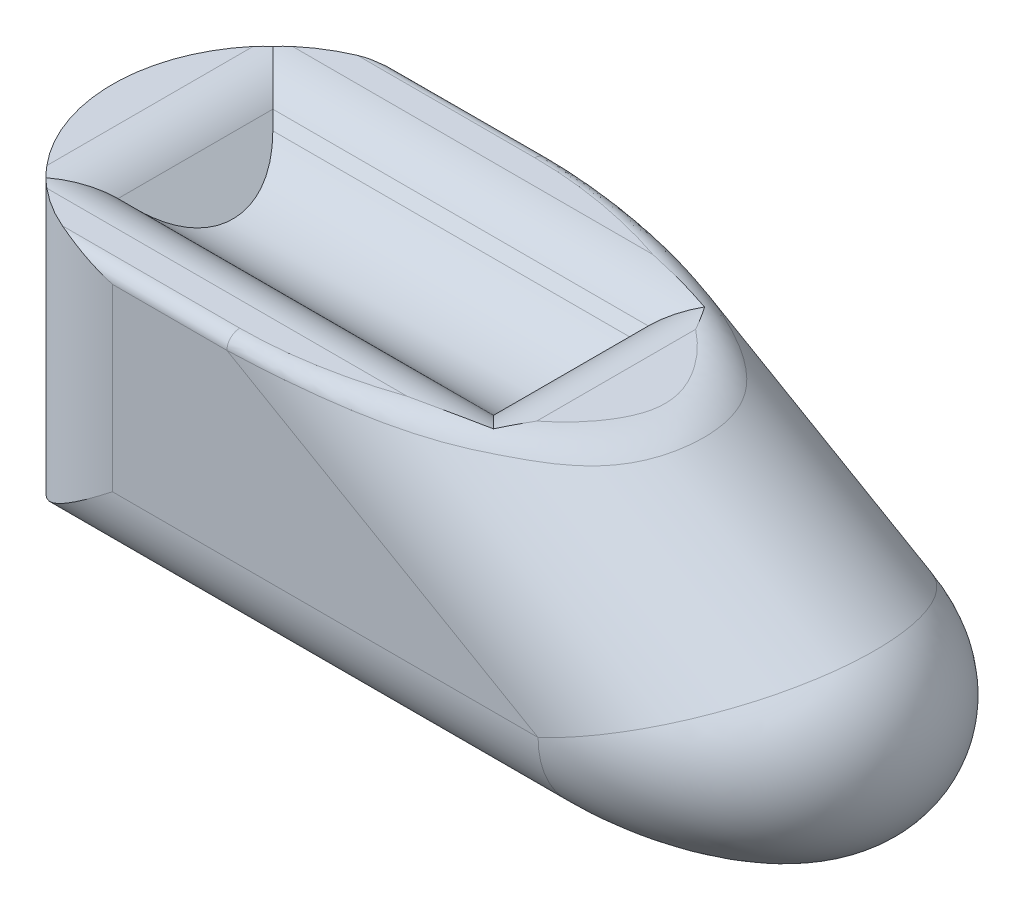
ISO-10303-21;
HEADER;
FILE_DESCRIPTION(('STEP AP214'),'2;1');
FILE_NAME('part.step','',(''),(''),'','','');
FILE_SCHEMA(('AUTOMOTIVE_DESIGN { 1 0 10303 214 1 1 1 1 }'));
ENDSEC;
DATA;
#1=APPLICATION_CONTEXT('core data for automotive mechanical design processes');
#2=APPLICATION_PROTOCOL_DEFINITION('international standard','automotive_design',2000,#1);
#3=PRODUCT_CONTEXT('',#1,'mechanical');
#4=PRODUCT('Part','Part','',(#3));
#5=PRODUCT_RELATED_PRODUCT_CATEGORY('part','',(#4));
#6=PRODUCT_DEFINITION_FORMATION('','',#4);
#7=PRODUCT_DEFINITION_CONTEXT('part definition',#1,'design');
#8=PRODUCT_DEFINITION('design','',#6,#7);
#9=PRODUCT_DEFINITION_SHAPE('','',#8);
#10=(LENGTH_UNIT() NAMED_UNIT(*) SI_UNIT(.MILLI.,.METRE.));
#11=(NAMED_UNIT(*) PLANE_ANGLE_UNIT() SI_UNIT($,.RADIAN.));
#12=(NAMED_UNIT(*) SI_UNIT($,.STERADIAN.) SOLID_ANGLE_UNIT());
#13=UNCERTAINTY_MEASURE_WITH_UNIT(LENGTH_MEASURE(1.E-05),#10,'distance_accuracy_value','');
#14=(GEOMETRIC_REPRESENTATION_CONTEXT(3) GLOBAL_UNCERTAINTY_ASSIGNED_CONTEXT((#13)) GLOBAL_UNIT_ASSIGNED_CONTEXT((#10,
#11,#12)) REPRESENTATION_CONTEXT('',''));
#15=CARTESIAN_POINT('',(0.,0.,0.));
#16=DIRECTION('',(0.,0.,1.));
#17=DIRECTION('',(1.,0.,0.));
#18=AXIS2_PLACEMENT_3D('',#15,#16,#17);
#19=CARTESIAN_POINT('',(-60.6217782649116,45.,25.));
#20=DIRECTION('',(0.,-1.,0.));
#21=DIRECTION('',(1.,0.,0.));
#22=AXIS2_PLACEMENT_3D('',#19,#20,#21);
#23=PLANE('',#22);
#24=CARTESIAN_POINT('',(-107.157676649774,45.,-23.));
#25=CARTESIAN_POINT('',(-104.096624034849,45.,-22.9999999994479));
#26=CARTESIAN_POINT('',(-101.053282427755,45.,-22.7554052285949));
#27=CARTESIAN_POINT('',(-95.1400454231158,45.,-21.9057557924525));
#28=CARTESIAN_POINT('',(-92.2703257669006,45.,-21.3000678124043));
#29=CARTESIAN_POINT('',(-84.0862755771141,45.,-19.0877234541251));
#30=CARTESIAN_POINT('',(-79.2071082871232,45.,-17.0919150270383));
#31=CARTESIAN_POINT('',(-73.2051034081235,45.,-13.7547814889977));
#32=CARTESIAN_POINT('',(-71.4843326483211,45.,-12.4746744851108));
#33=CARTESIAN_POINT('',(-68.6029644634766,45.,-9.86096206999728));
#34=CARTESIAN_POINT('',(-67.441651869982,45.,-8.52775875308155));
#35=CARTESIAN_POINT('',(-65.6189012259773,45.,-5.95503978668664));
#36=CARTESIAN_POINT('',(-64.9536363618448,45.,-4.71566623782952));
#37=CARTESIAN_POINT('',(-64.2839216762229,45.,-2.91992369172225));
#38=CARTESIAN_POINT('',(-64.1160540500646,45.,-2.33053903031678));
#39=CARTESIAN_POINT('',(-63.8924167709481,45.,-1.16072728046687));
#40=CARTESIAN_POINT('',(-63.837168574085,45.,-0.580320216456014));
#41=CARTESIAN_POINT('',(-63.837168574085,45.,0.580320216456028));
#42=CARTESIAN_POINT('',(-63.8924167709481,45.,1.16072728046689));
#43=CARTESIAN_POINT('',(-64.1160540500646,45.,2.3305390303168));
#44=CARTESIAN_POINT('',(-64.2839216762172,45.,2.91992369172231));
#45=CARTESIAN_POINT('',(-64.9536363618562,45.,4.71566623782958));
#46=CARTESIAN_POINT('',(-65.6189012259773,45.,5.95503978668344));
#47=CARTESIAN_POINT('',(-67.441651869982,45.,8.52775875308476));
#48=CARTESIAN_POINT('',(-68.6029644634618,45.,9.8609620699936));
#49=CARTESIAN_POINT('',(-71.4843326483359,45.,12.4746744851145));
#50=CARTESIAN_POINT('',(-73.2051034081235,45.,13.7547814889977));
#51=CARTESIAN_POINT('',(-79.2071082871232,45.,17.0919150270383));
#52=CARTESIAN_POINT('',(-84.0862755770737,45.,19.0877234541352));
#53=CARTESIAN_POINT('',(-92.2703257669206,45.,21.3000678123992));
#54=CARTESIAN_POINT('',(-95.1400454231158,45.,21.9057557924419));
#55=CARTESIAN_POINT('',(-101.053282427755,45.,22.7554052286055));
#56=CARTESIAN_POINT('',(-104.096624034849,45.,22.9999999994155));
#57=CARTESIAN_POINT('',(-107.157676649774,45.,23.));
#58=(BOUNDED_CURVE() B_SPLINE_CURVE(3,(#24,#25,#26,#27,#28,#29,#30,#31,#32,#33,#34,#35,#36,#37,
#38,#39,#40,#41,#42,#43,#44,#45,#46,#47,#48,#49,#50,#51,#52,#53,#54,#55,#56,#57),.UNSPECIFIED.,
.F.,.F.) B_SPLINE_CURVE_WITH_KNOTS((4,2,2,2,2,2,2,2,2,2,2,2,2,2,2,2,4),(1.64150965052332,
1.82902002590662,2.01653040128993,2.39155115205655,2.57906152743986,2.76657190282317,
2.95408227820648,3.04783746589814,3.14159265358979,3.23534784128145,3.3291030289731,
3.51661340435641,3.70412377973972,3.89163415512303,4.26665490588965,4.45416528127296,
4.64167565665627),
.UNSPECIFIED.) CURVE() GEOMETRIC_REPRESENTATION_ITEM() RATIONAL_B_SPLINE_CURVE((1.,1.,1.,1.,1.,
1.,1.,1.,1.,1.,1.,1.,1.,1.,1.,1.,1.,1.,1.,1.,1.,1.,1.,1.,1.,1.,1.,1.,1.,1.,1.,1.,1.,1.)) REPRESENTATION_ITEM(''));
#59=CARTESIAN_POINT('',(-71.4796425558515,45.,12.3838880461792));
#60=VERTEX_POINT('',#59);
#61=CARTESIAN_POINT('',(-71.4796425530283,45.,-12.3839087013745));
#62=VERTEX_POINT('',#61);
#63=EDGE_CURVE('E211',#60,#62,#58,.F.);
#64=ORIENTED_EDGE('',*,*,#63,.T.);
#65=DIRECTION('',(0.,0.,-1.));
#66=VECTOR('',#65,1.);
#67=CARTESIAN_POINT('',(-71.4796426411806,45.,25.));
#68=LINE('',#67,#66);
#69=EDGE_CURVE('E372',#62,#60,#68,.F.);
#70=ORIENTED_EDGE('',*,*,#69,.T.);
#71=EDGE_LOOP('',(#64,#70));
#72=FACE_BOUND('',#71,.T.);
#73=ADVANCED_FACE('F37',(#72),#23,.F.);
#74=CARTESIAN_POINT('',(-107.157676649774,45.,-23.));
#75=CARTESIAN_POINT('',(-104.096624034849,45.,-22.9999999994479));
#76=CARTESIAN_POINT('',(-101.053282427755,45.,-22.7554052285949));
#77=CARTESIAN_POINT('',(-95.1400454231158,45.,-21.9057557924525));
#78=CARTESIAN_POINT('',(-92.2703257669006,45.,-21.3000678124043));
#79=CARTESIAN_POINT('',(-84.0862755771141,45.,-19.0877234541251));
#80=CARTESIAN_POINT('',(-79.2071082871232,45.,-17.0919150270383));
#81=CARTESIAN_POINT('',(-73.2051034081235,45.,-13.7547814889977));
#82=CARTESIAN_POINT('',(-71.4843326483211,45.,-12.4746744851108));
#83=CARTESIAN_POINT('',(-68.6029644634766,45.,-9.86096206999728));
#84=CARTESIAN_POINT('',(-67.441651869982,45.,-8.52775875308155));
#85=CARTESIAN_POINT('',(-65.6189012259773,45.,-5.95503978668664));
#86=CARTESIAN_POINT('',(-64.9536363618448,45.,-4.71566623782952));
#87=CARTESIAN_POINT('',(-64.2839216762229,45.,-2.91992369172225));
#88=CARTESIAN_POINT('',(-64.1160540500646,45.,-2.33053903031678));
#89=CARTESIAN_POINT('',(-63.8924167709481,45.,-1.16072728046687));
#90=CARTESIAN_POINT('',(-63.837168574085,45.,-0.580320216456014));
#91=CARTESIAN_POINT('',(-63.837168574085,45.,0.580320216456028));
#92=CARTESIAN_POINT('',(-63.8924167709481,45.,1.16072728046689));
#93=CARTESIAN_POINT('',(-64.1160540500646,45.,2.3305390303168));
#94=CARTESIAN_POINT('',(-64.2839216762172,45.,2.91992369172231));
#95=CARTESIAN_POINT('',(-64.9536363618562,45.,4.71566623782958));
#96=CARTESIAN_POINT('',(-65.6189012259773,45.,5.95503978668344));
#97=CARTESIAN_POINT('',(-67.441651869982,45.,8.52775875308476));
#98=CARTESIAN_POINT('',(-68.6029644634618,45.,9.8609620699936));
#99=CARTESIAN_POINT('',(-71.4843326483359,45.,12.4746744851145));
#100=CARTESIAN_POINT('',(-73.2051034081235,45.,13.7547814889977));
#101=CARTESIAN_POINT('',(-79.2071082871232,45.,17.0919150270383));
#102=CARTESIAN_POINT('',(-84.0862755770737,45.,19.0877234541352));
#103=CARTESIAN_POINT('',(-92.2703257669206,45.,21.3000678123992));
#104=CARTESIAN_POINT('',(-95.1400454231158,45.,21.9057557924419));
#105=CARTESIAN_POINT('',(-101.053282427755,45.,22.7554052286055));
#106=CARTESIAN_POINT('',(-104.096624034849,45.,22.9999999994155));
#107=CARTESIAN_POINT('',(-107.157676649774,45.,23.));
#108=(BOUNDED_CURVE() B_SPLINE_CURVE(3,(#74,#75,#76,#77,#78,#79,#80,#81,#82,#83,#84,#85,#86,#87,
#88,#89,#90,#91,#92,#93,#94,#95,#96,#97,#98,#99,#100,#101,#102,#103,#104,#105,#106,#107),
.UNSPECIFIED.,.F.,.F.) B_SPLINE_CURVE_WITH_KNOTS((4,2,2,2,2,2,2,2,2,2,2,2,2,2,2,2,4),
(1.64150965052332,1.82902002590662,2.01653040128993,2.39155115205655,2.57906152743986,
2.76657190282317,2.95408227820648,3.04783746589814,3.14159265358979,3.23534784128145,
3.3291030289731,3.51661340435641,3.70412377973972,3.89163415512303,4.26665490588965,
4.45416528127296,4.64167565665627),
.UNSPECIFIED.) CURVE() GEOMETRIC_REPRESENTATION_ITEM() RATIONAL_B_SPLINE_CURVE((1.,1.,1.,1.,1.,
1.,1.,1.,1.,1.,1.,1.,1.,1.,1.,1.,1.,1.,1.,1.,1.,1.,1.,1.,1.,1.,1.,1.,1.,1.,1.,1.,1.,1.)) REPRESENTATION_ITEM(''));
#109=CARTESIAN_POINT('',(-107.157676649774,45.,23.));
#110=VERTEX_POINT('',#109);
#111=CARTESIAN_POINT('',(-84.9100670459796,45.,19.1421356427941));
#112=VERTEX_POINT('',#111);
#113=EDGE_CURVE('E196',#110,#112,#108,.F.);
#114=ORIENTED_EDGE('',*,*,#113,.T.);
#115=DIRECTION('',(1.,0.,0.));
#116=VECTOR('',#115,1.);
#117=CARTESIAN_POINT('',(-60.6217782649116,45.,19.1421356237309));
#118=LINE('',#117,#116);
#119=CARTESIAN_POINT('',(-141.080380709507,45.,19.1421356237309));
#120=VERTEX_POINT('',#119);
#121=EDGE_CURVE('E487',#112,#120,#118,.F.);
#122=ORIENTED_EDGE('',*,*,#121,.T.);
#123=CARTESIAN_POINT('',(-125.,45.,0.));
#124=DIRECTION('',(0.,-1.,0.));
#125=DIRECTION('',(1.,0.,0.));
#126=AXIS2_PLACEMENT_3D('',#123,#124,#125);
#127=CIRCLE('',#126,25.);
#128=CARTESIAN_POINT('',(-134.797958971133,45.,23.));
#129=VERTEX_POINT('',#128);
#130=EDGE_CURVE('E479',#120,#129,#127,.F.);
#131=ORIENTED_EDGE('',*,*,#130,.T.);
#132=DIRECTION('',(-1.,0.,0.));
#133=VECTOR('',#132,1.);
#134=CARTESIAN_POINT('',(-110.621778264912,45.,23.));
#135=LINE('',#134,#133);
#136=EDGE_CURVE('E557',#129,#110,#135,.F.);
#137=ORIENTED_EDGE('',*,*,#136,.T.);
#138=EDGE_LOOP('',(#114,#122,#131,#137));
#139=FACE_BOUND('',#138,.T.);
#140=ADVANCED_FACE('F462',(#139),#23,.F.);
#141=CARTESIAN_POINT('',(-144.142135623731,45.,-16.0803807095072));
#142=VERTEX_POINT('',#141);
#143=CARTESIAN_POINT('',(-144.142135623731,45.,16.0803807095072));
#144=VERTEX_POINT('',#143);
#145=EDGE_CURVE('E474',#142,#144,#127,.F.);
#146=ORIENTED_EDGE('',*,*,#145,.T.);
#147=DIRECTION('',(0.,0.,1.));
#148=VECTOR('',#147,1.);
#149=CARTESIAN_POINT('',(-144.142135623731,45.,25.));
#150=LINE('',#149,#148);
#151=EDGE_CURVE('E476',#144,#142,#150,.F.);
#152=ORIENTED_EDGE('',*,*,#151,.T.);
#153=EDGE_LOOP('',(#146,#152));
#154=FACE_BOUND('',#153,.T.);
#155=ADVANCED_FACE('F241',(#154),#23,.F.);
#156=CARTESIAN_POINT('',(-125.,43.,0.));
#157=DIRECTION('',(0.,-1.,0.));
#158=DIRECTION('',(0.,0.,-1.));
#159=AXIS2_PLACEMENT_3D('',#156,#157,#158);
#160=CYLINDRICAL_SURFACE('',#159,25.);
#161=ORIENTED_EDGE('',*,*,#130,.F.);
#162=CARTESIAN_POINT('',(-141.080380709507,45.,19.1421356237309));
#163=CARTESIAN_POINT('',(-141.219004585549,44.9999989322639,19.0256869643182));
#164=CARTESIAN_POINT('',(-141.356366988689,44.9979658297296,18.9077244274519));
#165=CARTESIAN_POINT('',(-141.628264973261,44.9895164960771,18.6690510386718));
#166=CARTESIAN_POINT('',(-141.76280361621,44.9831052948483,18.5483434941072));
#167=CARTESIAN_POINT('',(-142.029071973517,44.9655819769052,18.3041889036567));
#168=CARTESIAN_POINT('',(-142.160801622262,44.9544697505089,18.1807417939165));
#169=CARTESIAN_POINT('',(-142.421436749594,44.9271994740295,17.9311508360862));
#170=CARTESIAN_POINT('',(-142.550338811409,44.9110356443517,17.8050040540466));
#171=CARTESIAN_POINT('',(-142.677669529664,44.8921857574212,17.6776695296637));
#172=B_SPLINE_CURVE_WITH_KNOTS('',3,(#162,#163,#164,#165,#166,#167,#168,#169,#170,#171),
.UNSPECIFIED.,.F.,.F.,(4,2,2,2,4),(0.,0.543120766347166,1.08561860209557,1.62812909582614,
2.17126256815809),.UNSPECIFIED.);
#173=CARTESIAN_POINT('',(-142.677669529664,44.8921857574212,17.6776695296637));
#174=VERTEX_POINT('',#173);
#175=EDGE_CURVE('E516',#120,#174,#172,.T.);
#176=ORIENTED_EDGE('',*,*,#175,.T.);
#177=CARTESIAN_POINT('',(-142.677669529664,44.8921857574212,17.6776695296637));
#178=CARTESIAN_POINT('',(-142.805004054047,44.9110356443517,17.5503388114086));
#179=CARTESIAN_POINT('',(-142.931150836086,44.9271994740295,17.4214367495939));
#180=CARTESIAN_POINT('',(-143.180741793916,44.9544697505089,17.1608016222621));
#181=CARTESIAN_POINT('',(-143.304188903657,44.9655819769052,17.029071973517));
#182=CARTESIAN_POINT('',(-143.548343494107,44.9831052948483,16.7628036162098));
#183=CARTESIAN_POINT('',(-143.669051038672,44.9895164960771,16.6282649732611));
#184=CARTESIAN_POINT('',(-143.907724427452,44.9979658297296,16.3563669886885));
#185=CARTESIAN_POINT('',(-144.025686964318,44.9999989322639,16.2190045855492));
#186=CARTESIAN_POINT('',(-144.142135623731,45.,16.0803807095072));
#187=B_SPLINE_CURVE_WITH_KNOTS('',3,(#177,#178,#179,#180,#181,#182,#183,#184,#185,#186),
.UNSPECIFIED.,.F.,.F.,(4,2,2,2,4),(0.,0.543133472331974,1.08564396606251,1.62814180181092,
2.17126256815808),.UNSPECIFIED.);
#188=EDGE_CURVE('E484',#174,#144,#187,.T.);
#189=ORIENTED_EDGE('',*,*,#188,.T.);
#190=ORIENTED_EDGE('',*,*,#145,.F.);
#191=CARTESIAN_POINT('',(-144.142135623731,45.,-16.0803807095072));
#192=CARTESIAN_POINT('',(-144.025686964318,44.9999989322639,-16.2190045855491));
#193=CARTESIAN_POINT('',(-143.907724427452,44.9979658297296,-16.3563669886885));
#194=CARTESIAN_POINT('',(-143.669051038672,44.9895164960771,-16.6282649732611));
#195=CARTESIAN_POINT('',(-143.548343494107,44.9831052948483,-16.7628036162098));
#196=CARTESIAN_POINT('',(-143.304188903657,44.9655819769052,-17.029071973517));
#197=CARTESIAN_POINT('',(-143.180741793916,44.9544697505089,-17.1608016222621));
#198=CARTESIAN_POINT('',(-142.931150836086,44.9271994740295,-17.4214367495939));
#199=CARTESIAN_POINT('',(-142.805004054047,44.9110356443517,-17.5503388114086));
#200=CARTESIAN_POINT('',(-142.677669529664,44.8921857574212,-17.6776695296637));
#201=B_SPLINE_CURVE_WITH_KNOTS('',3,(#191,#192,#193,#194,#195,#196,#197,#198,#199,#200),
.UNSPECIFIED.,.F.,.F.,(4,2,2,2,4),(0.,0.543120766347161,1.08561860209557,1.62812909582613,
2.17126256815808),.UNSPECIFIED.);
#202=CARTESIAN_POINT('',(-142.677669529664,44.8921857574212,-17.6776695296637));
#203=VERTEX_POINT('',#202);
#204=EDGE_CURVE('E486',#142,#203,#201,.T.);
#205=ORIENTED_EDGE('',*,*,#204,.T.);
#206=CARTESIAN_POINT('',(-142.677669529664,44.8921857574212,-17.6776695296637));
#207=CARTESIAN_POINT('',(-142.550338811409,44.9110356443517,-17.8050040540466));
#208=CARTESIAN_POINT('',(-142.421436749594,44.9271994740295,-17.9311508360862));
#209=CARTESIAN_POINT('',(-142.160801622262,44.9544697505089,-18.1807417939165));
#210=CARTESIAN_POINT('',(-142.029071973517,44.9655819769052,-18.3041889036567));
#211=CARTESIAN_POINT('',(-141.76280361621,44.9831052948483,-18.5483434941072));
#212=CARTESIAN_POINT('',(-141.628264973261,44.9895164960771,-18.6690510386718));
#213=CARTESIAN_POINT('',(-141.356366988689,44.9979658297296,-18.9077244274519));
#214=CARTESIAN_POINT('',(-141.219004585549,44.9999989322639,-19.0256869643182));
#215=CARTESIAN_POINT('',(-141.080380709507,45.,-19.1421356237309));
#216=B_SPLINE_CURVE_WITH_KNOTS('',3,(#206,#207,#208,#209,#210,#211,#212,#213,#214,#215),
.UNSPECIFIED.,.F.,.F.,(4,2,2,2,4),(0.,0.543133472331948,1.08564396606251,1.62814180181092,
2.17126256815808),.UNSPECIFIED.);
#217=CARTESIAN_POINT('',(-141.080380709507,45.,-19.142135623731));
#218=VERTEX_POINT('',#217);
#219=EDGE_CURVE('E495',#203,#218,#216,.T.);
#220=ORIENTED_EDGE('',*,*,#219,.T.);
#221=CARTESIAN_POINT('',(-134.797958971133,45.,-23.));
#222=VERTEX_POINT('',#221);
#223=EDGE_CURVE('E478',#222,#218,#127,.F.);
#224=ORIENTED_EDGE('',*,*,#223,.F.);
#225=CARTESIAN_POINT('',(-125.,43.,-25.));
#226=CARTESIAN_POINT('',(-125.010142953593,43.0028688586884,-24.9999999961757));
#227=CARTESIAN_POINT('',(-125.020285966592,43.0057377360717,-24.9999938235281));
#228=CARTESIAN_POINT('',(-125.673375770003,43.1904583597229,-24.9991991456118));
#229=CARTESIAN_POINT('',(-126.316548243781,43.3723070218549,-24.9736280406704));
#230=CARTESIAN_POINT('',(-127.603409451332,43.7265541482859,-24.8724744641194));
#231=CARTESIAN_POINT('',(-128.247095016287,43.8989262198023,-24.7967592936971));
#232=CARTESIAN_POINT('',(-129.341469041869,44.1744496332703,-24.6243985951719));
#233=CARTESIAN_POINT('',(-129.792842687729,44.2829799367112,-24.5405979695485));
#234=CARTESIAN_POINT('',(-130.693830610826,44.4846655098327,-24.3473318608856));
#235=CARTESIAN_POINT('',(-131.143444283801,44.5778158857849,-24.2378582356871));
#236=CARTESIAN_POINT('',(-131.814020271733,44.7009511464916,-24.0545708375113));
#237=CARTESIAN_POINT('',(-132.036190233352,44.7391338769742,-23.9905338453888));
#238=CARTESIAN_POINT('',(-132.479570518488,44.8091389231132,-23.8560197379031));
#239=CARTESIAN_POINT('',(-132.700780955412,44.8409620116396,-23.7855434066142));
#240=CARTESIAN_POINT('',(-133.141945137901,44.8970932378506,-23.6381640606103));
#241=CARTESIAN_POINT('',(-133.361899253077,44.9214037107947,-23.5612630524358));
#242=CARTESIAN_POINT('',(-133.800254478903,44.961110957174,-23.4010673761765));
#243=CARTESIAN_POINT('',(-134.018655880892,44.97650944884,-23.3177739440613));
#244=CARTESIAN_POINT('',(-134.453340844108,44.9966354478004,-23.1449566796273));
#245=CARTESIAN_POINT('',(-134.669625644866,45.0013696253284,-23.0554367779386));
#246=CARTESIAN_POINT('',(-135.099369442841,44.9979436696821,-22.8704473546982));
#247=CARTESIAN_POINT('',(-135.312830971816,44.9897960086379,-22.7749836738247));
#248=CARTESIAN_POINT('',(-135.631201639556,44.965592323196,-22.6272277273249));
#249=CARTESIAN_POINT('',(-135.737518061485,44.9554508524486,-22.5769679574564));
#250=CARTESIAN_POINT('',(-135.948989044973,44.930622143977,-22.4751730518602));
#251=CARTESIAN_POINT('',(-136.054143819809,44.9159357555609,-22.4236381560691));
#252=CARTESIAN_POINT('',(-136.263355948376,44.8813999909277,-22.3192853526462));
#253=CARTESIAN_POINT('',(-136.367409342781,44.8615360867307,-22.2664642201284));
#254=CARTESIAN_POINT('',(-136.57380948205,44.815911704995,-22.1598847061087));
#255=CARTESIAN_POINT('',(-136.676155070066,44.7901473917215,-22.1061257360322));
#256=CARTESIAN_POINT('',(-136.777426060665,44.7610683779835,-22.0520347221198));
#257=B_SPLINE_CURVE_WITH_KNOTS('',3,(#225,#226,#227,#228,#229,#230,#231,#232,#233,#234,#235,
#236,#237,#238,#239,#240,#241,#242,#243,#244,#245,#246,#247,#248,#249,#250,#251,#252,#253,#254,
#255,#256),.UNSPECIFIED.,.F.,.F.,(4,2,2,2,2,2,2,2,2,2,2,2,2,2,2,4),(0.,0.0316227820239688,
2.03612103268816,4.04594520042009,5.46038299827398,6.87526999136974,7.5781673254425,
8.28097918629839,8.98357236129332,9.68603003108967,10.3880482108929,11.0893871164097,
11.4434081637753,11.7973630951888,12.1523221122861,12.5075125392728),.UNSPECIFIED.);
#258=CARTESIAN_POINT('',(-125.,43.,-25.));
#259=VERTEX_POINT('',#258);
#260=EDGE_CURVE('E536',#259,#222,#257,.T.);
#261=ORIENTED_EDGE('',*,*,#260,.F.);
#262=DIRECTION('',(0.,-1.,0.));
#263=VECTOR('',#262,1.);
#264=CARTESIAN_POINT('',(-125.,0.,-25.));
#265=LINE('',#264,#263);
#266=CARTESIAN_POINT('',(-125.,15.,-25.));
#267=VERTEX_POINT('',#266);
#268=EDGE_CURVE('E445',#267,#259,#265,.F.);
#269=ORIENTED_EDGE('',*,*,#268,.F.);
#270=CARTESIAN_POINT('',(-147.912878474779,0.,-10.));
#271=CARTESIAN_POINT('',(-147.815917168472,-1.32107181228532E-06,-10.2221774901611));
#272=CARTESIAN_POINT('',(-147.715735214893,0.00493680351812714,-10.4428949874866));
#273=CARTESIAN_POINT('',(-147.509188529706,0.0242867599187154,-10.8809478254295));
#274=CARTESIAN_POINT('',(-147.402824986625,0.0386967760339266,-11.0982838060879));
#275=CARTESIAN_POINT('',(-147.075193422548,0.0954605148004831,-11.7438623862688));
#276=CARTESIAN_POINT('',(-146.845026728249,0.151350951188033,-12.1664942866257));
#277=CARTESIAN_POINT('',(-146.36592289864,0.295005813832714,-12.9892973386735));
#278=CARTESIAN_POINT('',(-146.117200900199,0.38243968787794,-13.3896534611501));
#279=CARTESIAN_POINT('',(-145.601133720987,0.585870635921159,-14.1708355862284));
#280=CARTESIAN_POINT('',(-145.333779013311,0.701882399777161,-14.5516514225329));
#281=CARTESIAN_POINT('',(-144.710654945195,0.992836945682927,-15.3892547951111));
#282=CARTESIAN_POINT('',(-144.350052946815,1.17525685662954,-15.839854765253));
#283=CARTESIAN_POINT('',(-143.606997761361,1.57423667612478,-16.7064553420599));
#284=CARTESIAN_POINT('',(-143.224541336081,1.7908016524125,-17.1224507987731));
#285=CARTESIAN_POINT('',(-142.439547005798,2.25381381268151,-17.9214189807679));
#286=CARTESIAN_POINT('',(-142.036925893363,2.50039206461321,-18.3042333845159));
#287=CARTESIAN_POINT('',(-141.216276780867,3.01802048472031,-19.0350825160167));
#288=CARTESIAN_POINT('',(-140.798247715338,3.28907234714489,-19.3831148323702));
#289=CARTESIAN_POINT('',(-139.780380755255,3.9636981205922,-20.1768820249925));
#290=CARTESIAN_POINT('',(-139.174372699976,4.37709539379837,-20.6064057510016));
#291=CARTESIAN_POINT('',(-137.942833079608,5.23526744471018,-21.4014167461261));
#292=CARTESIAN_POINT('',(-137.317293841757,5.6800546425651,-21.766878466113));
#293=CARTESIAN_POINT('',(-136.051073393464,6.59405994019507,-22.4362821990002));
#294=CARTESIAN_POINT('',(-135.41038683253,7.06328674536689,-22.7402020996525));
#295=CARTESIAN_POINT('',(-134.117790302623,8.0202242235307,-23.2885964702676));
#296=CARTESIAN_POINT('',(-133.465882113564,8.50793197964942,-23.5330802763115));
#297=CARTESIAN_POINT('',(-132.170558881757,9.4844369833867,-23.9590456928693));
#298=CARTESIAN_POINT('',(-131.527356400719,9.97288383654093,-24.1419854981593));
#299=CARTESIAN_POINT('',(-130.235207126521,10.9592016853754,-24.4547438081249));
#300=CARTESIAN_POINT('',(-129.586259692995,11.4570737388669,-24.5845563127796));
#301=CARTESIAN_POINT('',(-128.286030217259,12.4578454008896,-24.7918252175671));
#302=CARTESIAN_POINT('',(-127.634755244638,12.9607332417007,-24.8693837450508));
#303=CARTESIAN_POINT('',(-126.330597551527,13.9693331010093,-24.9731280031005));
#304=CARTESIAN_POINT('',(-125.677715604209,14.4750438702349,-24.9993348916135));
#305=CARTESIAN_POINT('',(-125.016666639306,14.9870900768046,-24.9999958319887));
#306=CARTESIAN_POINT('',(-125.008333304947,14.9935450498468,-24.9999999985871));
#307=CARTESIAN_POINT('',(-125.,15.,-25.));
#308=B_SPLINE_CURVE_WITH_KNOTS('',3,(#270,#271,#272,#273,#274,#275,#276,#277,#278,#279,#280,
#281,#282,#283,#284,#285,#286,#287,#288,#289,#290,#291,#292,#293,#294,#295,#296,#297,#298,#299,
#300,#301,#302,#303,#304,#305,#306,#307),.UNSPECIFIED.,.F.,.F.,(4,2,2,2,2,2,2,2,2,2,2,2,2,2,2,2,
2,2,4),(0.,0.727074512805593,1.45400969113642,2.90521098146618,4.34162660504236,
5.77878213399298,7.59190686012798,9.40530094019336,11.2269191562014,13.048663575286,
15.5951275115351,18.1426047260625,20.6909956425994,23.2389860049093,25.7214668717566,
28.2042280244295,30.682122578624,33.1589959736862,33.1906187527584),.UNSPECIFIED.);
#309=CARTESIAN_POINT('',(-147.912878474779,0.,-10.));
#310=VERTEX_POINT('',#309);
#311=EDGE_CURVE('E438',#310,#267,#308,.T.);
#312=ORIENTED_EDGE('',*,*,#311,.F.);
#313=CARTESIAN_POINT('',(-125.,0.,0.));
#314=DIRECTION('',(0.,1.,0.));
#315=DIRECTION('',(0.,0.,1.));
#316=AXIS2_PLACEMENT_3D('',#313,#314,#315);
#317=CIRCLE('',#316,25.);
#318=CARTESIAN_POINT('',(-147.912878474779,0.,10.));
#319=VERTEX_POINT('',#318);
#320=EDGE_CURVE('E435',#319,#310,#317,.F.);
#321=ORIENTED_EDGE('',*,*,#320,.F.);
#322=CARTESIAN_POINT('',(-125.,15.,25.));
#323=CARTESIAN_POINT('',(-125.008333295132,14.99354505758,24.9999999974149));
#324=CARTESIAN_POINT('',(-125.016666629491,14.9870900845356,24.9999958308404));
#325=CARTESIAN_POINT('',(-125.896440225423,14.3056205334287,24.9991163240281));
#326=CARTESIAN_POINT('',(-126.76828428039,13.630308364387,24.9527072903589));
#327=CARTESIAN_POINT('',(-128.508253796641,12.28631902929,24.7680946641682));
#328=CARTESIAN_POINT('',(-129.376375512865,11.6176479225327,24.6298138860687));
#329=CARTESIAN_POINT('',(-131.105565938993,10.2935400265,24.2591307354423));
#330=CARTESIAN_POINT('',(-131.966617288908,9.63813204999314,24.0265426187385));
#331=CARTESIAN_POINT('',(-133.674104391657,8.35101051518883,23.4641704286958));
#332=CARTESIAN_POINT('',(-134.520549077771,7.71928217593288,23.1344481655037));
#333=CARTESIAN_POINT('',(-135.915579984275,6.69360449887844,22.4994991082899));
#334=CARTESIAN_POINT('',(-136.470030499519,6.29015590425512,22.2222812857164));
#335=CARTESIAN_POINT('',(-137.567115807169,5.50249469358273,21.6207979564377));
#336=CARTESIAN_POINT('',(-138.109750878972,5.1182816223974,21.2965335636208));
#337=CARTESIAN_POINT('',(-139.179431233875,4.37436018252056,20.5997734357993));
#338=CARTESIAN_POINT('',(-139.706495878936,4.01462058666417,20.2273409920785));
#339=CARTESIAN_POINT('',(-140.741982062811,3.32490731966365,19.4323386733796));
#340=CARTESIAN_POINT('',(-141.250408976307,2.9949250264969,19.0097834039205));
#341=CARTESIAN_POINT('',(-142.11470055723,2.45286815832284,18.2299770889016));
#342=CARTESIAN_POINT('',(-142.475839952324,2.23245484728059,17.8843417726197));
#343=CARTESIAN_POINT('',(-143.183199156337,1.81513925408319,17.16466577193));
#344=CARTESIAN_POINT('',(-143.529419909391,1.61823548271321,16.790626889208));
#345=CARTESIAN_POINT('',(-144.203183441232,1.25244964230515,16.0156323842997));
#346=CARTESIAN_POINT('',(-144.530786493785,1.08347331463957,15.6147739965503));
#347=CARTESIAN_POINT('',(-145.165667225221,0.777066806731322,14.7857451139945));
#348=CARTESIAN_POINT('',(-145.472948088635,0.639631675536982,14.3575789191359));
#349=CARTESIAN_POINT('',(-146.000756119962,0.426574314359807,13.5699110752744));
#350=CARTESIAN_POINT('',(-146.225787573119,0.344018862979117,13.2152947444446));
#351=CARTESIAN_POINT('',(-146.659574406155,0.203798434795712,12.4916251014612));
#352=CARTESIAN_POINT('',(-146.868336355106,0.146123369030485,12.1225777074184));
#353=CARTESIAN_POINT('',(-147.269679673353,0.0577079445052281,11.368602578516));
#354=CARTESIAN_POINT('',(-147.462114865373,0.0271915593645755,10.9835697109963));
#355=CARTESIAN_POINT('',(-147.736033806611,0.00400661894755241,10.3980456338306));
#356=CARTESIAN_POINT('',(-147.824941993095,4.84437043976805E-05,10.2014002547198));
#357=CARTESIAN_POINT('',(-147.997650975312,-4.75681708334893E-05,9.80584777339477));
#358=CARTESIAN_POINT('',(-148.081451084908,0.00381564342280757,9.60694037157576));
#359=CARTESIAN_POINT('',(-148.162615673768,0.0117228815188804,9.40708430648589));
#360=B_SPLINE_CURVE_WITH_KNOTS('',3,(#322,#323,#324,#325,#326,#327,#328,#329,#330,#331,#332,
#333,#334,#335,#336,#337,#338,#339,#340,#341,#342,#343,#344,#345,#346,#347,#348,#349,#350,#351,
#352,#353,#354,#355,#356,#357,#358,#359),.UNSPECIFIED.,.F.,.F.,(4,2,2,2,2,2,2,2,2,2,2,2,2,2,2,2,
2,2,4),(0.,0.0316227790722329,3.33849112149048,6.64814123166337,9.96434181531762,
13.2784367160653,15.495698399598,17.7129075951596,19.9272324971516,22.1409137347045,
23.7786067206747,25.4161959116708,27.04813987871,28.6798275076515,29.962744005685,
31.2451397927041,32.5380158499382,33.1853679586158,33.832806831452),.UNSPECIFIED.);
#361=CARTESIAN_POINT('',(-125.,15.,25.));
#362=VERTEX_POINT('',#361);
#363=EDGE_CURVE('E429',#362,#319,#360,.T.);
#364=ORIENTED_EDGE('',*,*,#363,.F.);
#365=DIRECTION('',(0.,1.,0.));
#366=VECTOR('',#365,1.);
#367=CARTESIAN_POINT('',(-125.,43.,25.));
#368=LINE('',#367,#366);
#369=CARTESIAN_POINT('',(-125.,43.,25.));
#370=VERTEX_POINT('',#369);
#371=EDGE_CURVE('E416',#370,#362,#368,.F.);
#372=ORIENTED_EDGE('',*,*,#371,.F.);
#373=CARTESIAN_POINT('',(-134.797958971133,45.,23.));
#374=CARTESIAN_POINT('',(-134.642250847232,44.9999741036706,23.0663340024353));
#375=CARTESIAN_POINT('',(-134.485894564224,44.9967010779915,23.1310708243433));
#376=CARTESIAN_POINT('',(-134.172138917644,44.9844036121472,23.2572659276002));
#377=CARTESIAN_POINT('',(-134.014739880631,44.9753808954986,23.3187251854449));
#378=CARTESIAN_POINT('',(-133.699269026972,44.9523413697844,23.4382410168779));
#379=CARTESIAN_POINT('',(-133.541198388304,44.9383312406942,23.4963020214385));
#380=CARTESIAN_POINT('',(-133.224314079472,44.9059004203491,23.6090861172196));
#381=CARTESIAN_POINT('',(-133.065500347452,44.8874793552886,23.6638089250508));
#382=CARTESIAN_POINT('',(-132.589339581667,44.826541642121,23.8225434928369));
#383=CARTESIAN_POINT('',(-132.271053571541,44.7782531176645,23.921582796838));
#384=CARTESIAN_POINT('',(-131.632640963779,44.6695403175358,24.1064015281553));
#385=CARTESIAN_POINT('',(-131.312513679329,44.609111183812,24.192175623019));
#386=CARTESIAN_POINT('',(-130.638000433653,44.4719934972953,24.3586880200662));
#387=CARTESIAN_POINT('',(-130.283473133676,44.3942723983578,24.4380040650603));
#388=CARTESIAN_POINT('',(-129.57336752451,44.2300085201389,24.5807953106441));
#389=CARTESIAN_POINT('',(-129.217789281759,44.1434662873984,24.6442714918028));
#390=CARTESIAN_POINT('',(-128.149342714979,43.873985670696,24.8113193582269));
#391=CARTESIAN_POINT('',(-127.435083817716,43.6812629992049,24.8914315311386));
#392=CARTESIAN_POINT('',(-126.438897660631,43.4052848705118,24.9601537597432));
#393=CARTESIAN_POINT('',(-126.15720287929,43.3264451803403,24.9747950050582));
#394=CARTESIAN_POINT('',(-125.593806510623,43.1679406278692,24.9945352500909));
#395=CARTESIAN_POINT('',(-125.312104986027,43.0882761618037,24.9996386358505));
#396=CARTESIAN_POINT('',(-125.020285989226,43.0057377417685,24.9999938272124));
#397=CARTESIAN_POINT('',(-125.010142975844,43.0028688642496,24.999999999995));
#398=CARTESIAN_POINT('',(-125.,43.,25.));
#399=B_SPLINE_CURVE_WITH_KNOTS('',3,(#373,#374,#375,#376,#377,#378,#379,#380,#381,#382,#383,
#384,#385,#386,#387,#388,#389,#390,#391,#392,#393,#394,#395,#396,#397,#398),.UNSPECIFIED.,.F.,
.F.,(4,2,2,2,2,2,2,2,2,2,2,2,4),(0.,0.507664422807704,1.01517674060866,1.52201185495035,
2.02888993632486,3.0387308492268,4.04897665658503,5.16299241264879,6.27693918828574,
8.50584313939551,9.3844229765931,10.2625986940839,10.2942214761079),.UNSPECIFIED.);
#400=EDGE_CURVE('E207',#129,#370,#399,.T.);
#401=ORIENTED_EDGE('',*,*,#400,.F.);
#402=EDGE_LOOP('',(#161,#176,#189,#190,#205,#220,#224,#261,#269,#312,#321,#364,#372,#401));
#403=FACE_BOUND('',#402,.T.);
#404=ADVANCED_FACE('F39',(#403),#160,.T.);
#405=CARTESIAN_POINT('',(-75.6217782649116,51.2132034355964,0.));
#406=DIRECTION('',(-1.,0.,0.));
#407=DIRECTION('',(0.,-1.,0.));
#408=AXIS2_PLACEMENT_3D('',#405,#406,#407);
#409=CYLINDRICAL_SURFACE('',#408,15.);
#410=DIRECTION('',(1.,0.,0.));
#411=VECTOR('',#410,1.);
#412=CARTESIAN_POINT('',(-75.6217782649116,40.6066017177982,-10.6066017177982));
#413=LINE('',#412,#411);
#414=CARTESIAN_POINT('',(-135.606601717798,40.6066017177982,-10.6066017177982));
#415=VERTEX_POINT('',#414);
#416=CARTESIAN_POINT('',(-80.0151765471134,40.6066017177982,-10.6066017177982));
#417=VERTEX_POINT('',#416);
#418=EDGE_CURVE('E421',#415,#417,#413,.T.);
#419=ORIENTED_EDGE('',*,*,#418,.F.);
#420=CARTESIAN_POINT('',(-146.213203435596,51.2132034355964,0.));
#421=DIRECTION('',(-0.707106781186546,-0.707106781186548,0.));
#422=DIRECTION('',(-0.707106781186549,0.707106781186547,0.));
#423=AXIS2_PLACEMENT_3D('',#420,#421,#422);
#424=ELLIPSE('',#423,21.2132034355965,15.);
#425=CARTESIAN_POINT('',(-135.606601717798,40.6066017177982,10.6066017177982));
#426=VERTEX_POINT('',#425);
#427=EDGE_CURVE('E417',#426,#415,#424,.F.);
#428=ORIENTED_EDGE('',*,*,#427,.F.);
#429=DIRECTION('',(1.,0.,0.));
#430=VECTOR('',#429,1.);
#431=CARTESIAN_POINT('',(-75.6217782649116,40.6066017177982,10.6066017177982));
#432=LINE('',#431,#430);
#433=CARTESIAN_POINT('',(-80.0151765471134,40.6066017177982,10.6066017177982));
#434=VERTEX_POINT('',#433);
#435=EDGE_CURVE('E419',#434,#426,#432,.F.);
#436=ORIENTED_EDGE('',*,*,#435,.F.);
#437=CARTESIAN_POINT('',(-69.4085748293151,51.2132034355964,0.));
#438=DIRECTION('',(0.707106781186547,-0.707106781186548,0.));
#439=DIRECTION('',(-0.707106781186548,-0.707106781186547,0.));
#440=AXIS2_PLACEMENT_3D('',#437,#438,#439);
#441=ELLIPSE('',#440,21.2132034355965,15.);
#442=EDGE_CURVE('E411',#417,#434,#441,.F.);
#443=ORIENTED_EDGE('',*,*,#442,.F.);
#444=EDGE_LOOP('',(#419,#428,#436,#443));
#445=FACE_BOUND('',#444,.T.);
#446=ADVANCED_FACE('F420',(#445),#409,.F.);
#447=CARTESIAN_POINT('',(-78.6602540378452,0.,0.));
#448=CARTESIAN_POINT('',(-80.6350415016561,0.,0.));
#449=CARTESIAN_POINT('',(-82.542539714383,0.511112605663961,0.));
#450=CARTESIAN_POINT('',(-84.4500379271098,1.02222521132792,0.));
#451=CARTESIAN_POINT('',(-86.1602540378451,2.00961894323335,0.));
#452=CARTESIAN_POINT('',(-78.6602540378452,0.,0.220001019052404));
#453=CARTESIAN_POINT('',(-80.6350415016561,0.,0.306892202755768));
#454=CARTESIAN_POINT('',(-82.542539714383,0.511112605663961,0.390822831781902));
#455=CARTESIAN_POINT('',(-84.4500379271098,1.02222521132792,0.474752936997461));
#456=CARTESIAN_POINT('',(-86.1602540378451,2.00961894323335,0.550002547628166));
#457=CARTESIAN_POINT('',(-78.6456632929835,0.,0.440002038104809));
#458=CARTESIAN_POINT('',(-80.6195067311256,0.,0.613809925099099));
#459=CARTESIAN_POINT('',(-82.5257748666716,0.513564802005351,0.781645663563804));
#460=CARTESIAN_POINT('',(-84.4320374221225,1.02713042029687,0.949545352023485));
#461=CARTESIAN_POINT('',(-86.1401917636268,2.01909591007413,1.10000509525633));
#462=CARTESIAN_POINT('',(-78.5881251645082,0.,0.876247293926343));
#463=CARTESIAN_POINT('',(-80.558248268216,0.,1.22274227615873));
#464=CARTESIAN_POINT('',(-82.4596521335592,0.523242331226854,1.55712939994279));
#465=CARTESIAN_POINT('',(-84.3610507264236,1.04648543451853,1.89157985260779));
#466=CARTESIAN_POINT('',(-86.0610768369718,2.05646802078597,2.19061823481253));
#467=CARTESIAN_POINT('',(-78.5451730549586,0.,1.09249089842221));
#468=CARTESIAN_POINT('',(-80.512509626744,0.,1.52480457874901));
#469=CARTESIAN_POINT('',(-82.410288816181,0.530468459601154,1.94178926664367));
#470=CARTESIAN_POINT('',(-84.3080472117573,1.06093996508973,2.35889570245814));
#471=CARTESIAN_POINT('',(-86.0020176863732,2.08436623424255,2.73122724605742));
#472=CARTESIAN_POINT('',(-78.4304279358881,0.,1.52829340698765));
#473=CARTESIAN_POINT('',(-80.3903132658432,0.,2.13427710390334));
#474=CARTESIAN_POINT('',(-82.2783806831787,0.549796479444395,2.71800554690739));
#475=CARTESIAN_POINT('',(-84.1664256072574,1.09959625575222,3.30186699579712));
#476=CARTESIAN_POINT('',(-85.8442431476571,2.15889537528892,3.82073351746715));
#477=CARTESIAN_POINT('',(-78.357344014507,0.,1.74750931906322));
#478=CARTESIAN_POINT('',(-80.3124613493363,0.,2.44128489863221));
#479=CARTESIAN_POINT('',(-82.1943505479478,0.56211669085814,3.10900002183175));
#480=CARTESIAN_POINT('',(-84.0761910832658,1.12424052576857,3.77690305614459));
#481=CARTESIAN_POINT('',(-85.743752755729,2.20636477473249,4.3687732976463));
#482=CARTESIAN_POINT('',(-78.1859946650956,0.,2.17580431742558));
#483=CARTESIAN_POINT('',(-80.1299069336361,0.,3.04221606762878));
#484=CARTESIAN_POINT('',(-81.9972606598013,0.59105269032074,3.8744264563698));
#485=CARTESIAN_POINT('',(-83.8645661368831,1.18211246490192,4.70682530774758));
#486=CARTESIAN_POINT('',(-85.508147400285,2.31765944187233,5.43951079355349));
#487=CARTESIAN_POINT('',(-78.0877220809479,0.,2.3848805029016));
#488=CARTESIAN_POINT('',(-80.0251702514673,0.,3.33617315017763));
#489=CARTESIAN_POINT('',(-81.8841926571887,0.607669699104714,4.24885367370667));
#490=CARTESIAN_POINT('',(-83.7431360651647,1.21535102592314,5.16176373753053));
#491=CARTESIAN_POINT('',(-85.3730225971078,2.38148935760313,5.96220125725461));
#492=CARTESIAN_POINT('',(-77.8607178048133,0.,2.80848385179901));
#493=CARTESIAN_POINT('',(-79.7831711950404,0.,3.93321976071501));
#494=CARTESIAN_POINT('',(-81.622886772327,0.646136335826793,5.00942020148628));
#495=CARTESIAN_POINT('',(-83.4625099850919,1.29228627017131,6.08588990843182));
#496=CARTESIAN_POINT('',(-85.0608917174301,2.52893296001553,7.02120962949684));
#497=CARTESIAN_POINT('',(-77.730127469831,0.,3.02200741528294));
#498=CARTESIAN_POINT('',(-79.6438939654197,0.,4.23503675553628));
#499=CARTESIAN_POINT('',(-81.4724999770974,0.668307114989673,5.39392510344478));
#500=CARTESIAN_POINT('',(-83.3009732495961,1.33663384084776,6.55311798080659));
#501=CARTESIAN_POINT('',(-84.881330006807,2.61375387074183,7.55501853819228));
#502=CARTESIAN_POINT('',(-77.4484175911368,0.,3.43494689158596));
#503=CARTESIAN_POINT('',(-79.3433413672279,0.,4.82063657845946));
#504=CARTESIAN_POINT('',(-81.1478857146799,0.71626444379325,6.14006211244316));
#505=CARTESIAN_POINT('',(-82.9522972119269,1.43254851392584,7.45979358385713));
#506=CARTESIAN_POINT('',(-84.4939789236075,2.79672980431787,8.58736722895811));
#507=CARTESIAN_POINT('',(-77.297294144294,0.,3.63436011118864));
#508=CARTESIAN_POINT('',(-79.1820251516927,0.,5.1044375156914));
#509=CARTESIAN_POINT('',(-80.9736537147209,0.742051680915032,6.50168985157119));
#510=CARTESIAN_POINT('',(-82.7651104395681,1.484128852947,7.89926929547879));
#511=CARTESIAN_POINT('',(-84.286184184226,2.89488736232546,9.08590027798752));
#512=CARTESIAN_POINT('',(-76.9624467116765,0.,4.03856027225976));
#513=CARTESIAN_POINT('',(-78.8244225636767,0.,5.68193567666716));
#514=CARTESIAN_POINT('',(-80.5873353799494,0.799363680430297,7.23761323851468));
#515=CARTESIAN_POINT('',(-82.3500404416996,1.59875818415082,8.79368682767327));
#516=CARTESIAN_POINT('',(-83.825768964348,3.11237714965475,10.0964006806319));
#517=CARTESIAN_POINT('',(-76.776973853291,0.,4.2418896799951));
#518=CARTESIAN_POINT('',(-78.6262267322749,0.,5.97376925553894));
#519=CARTESIAN_POINT('',(-80.3732058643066,0.831204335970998,7.60955806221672));
#520=CARTESIAN_POINT('',(-82.1199295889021,1.66244676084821,9.24575703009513));
#521=CARTESIAN_POINT('',(-83.5707437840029,3.2328453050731,10.604724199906));
#522=CARTESIAN_POINT('',(-76.3900495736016,0.,4.63261505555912));
#523=CARTESIAN_POINT('',(-78.2125281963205,0.,6.53732752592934));
#524=CARTESIAN_POINT('',(-79.9261163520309,0.897875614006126,8.32790593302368));
#525=CARTESIAN_POINT('',(-81.6394483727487,1.7957894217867,10.118896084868));
#526=CARTESIAN_POINT('',(-83.0387228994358,3.48415999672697,11.5815376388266));
#527=CARTESIAN_POINT('',(-76.1885964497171,0.,4.82000932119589));
#528=CARTESIAN_POINT('',(-77.9969822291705,0.,6.8090564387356));
#529=CARTESIAN_POINT('',(-79.6931543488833,0.932706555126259,8.67430625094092));
#530=CARTESIAN_POINT('',(-81.389027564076,1.86545793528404,10.5399716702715));
#531=CARTESIAN_POINT('',(-82.7617248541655,3.61500763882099,12.0500233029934));
#532=CARTESIAN_POINT('',(-75.751876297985,0.,5.19822188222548));
#533=CARTESIAN_POINT('',(-77.5293790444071,0.,7.36058657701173));
#534=CARTESIAN_POINT('',(-79.1876536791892,1.00851739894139,9.37742379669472));
#535=CARTESIAN_POINT('',(-80.8455656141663,2.0170891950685,11.3947656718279));
#536=CARTESIAN_POINT('',(-82.1612346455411,3.89866569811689,12.9955547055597));
#537=CARTESIAN_POINT('',(-75.5152510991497,0.,5.38746440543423));
#538=CARTESIAN_POINT('',(-77.2758202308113,0.,7.6383794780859));
#539=CARTESIAN_POINT('',(-78.9134964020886,1.04976277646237,9.73163209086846));
#540=CARTESIAN_POINT('',(-80.5507591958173,2.09958797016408,11.8253857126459));
#541=CARTESIAN_POINT('',(-81.8358749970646,4.05235827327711,13.4686610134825));
#542=CARTESIAN_POINT('',(-75.0298141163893,0.,5.74951008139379));
#543=CARTESIAN_POINT('',(-76.7552266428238,0.,8.17354909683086));
#544=CARTESIAN_POINT('',(-78.3504274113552,1.13477851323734,10.4140712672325));
#545=CARTESIAN_POINT('',(-79.945213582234,2.26961962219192,12.6550959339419));
#546=CARTESIAN_POINT('',(-81.1683991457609,4.36765884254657,14.3737752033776));
#547=CARTESIAN_POINT('',(-74.7810015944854,0.,5.92231223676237));
#548=CARTESIAN_POINT('',(-76.4881476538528,0.,8.43091871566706));
#549=CARTESIAN_POINT('',(-78.0615148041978,1.17854902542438,10.7423005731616));
#550=CARTESIAN_POINT('',(-79.6344225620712,2.35716791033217,13.054175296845));
#551=CARTESIAN_POINT('',(-80.8262819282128,4.52926731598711,14.8057805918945));
#552=CARTESIAN_POINT('',(-74.249907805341,0.,6.26838064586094));
#553=CARTESIAN_POINT('',(-75.9175134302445,0.,8.95044898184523));
#554=CARTESIAN_POINT('',(-77.4440758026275,1.27244618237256,11.4048510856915));
#555=CARTESIAN_POINT('',(-78.9700881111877,2.54497601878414,13.8598435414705));
#556=CARTESIAN_POINT('',(-80.0960279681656,4.87422285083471,15.6709516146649));
#557=CARTESIAN_POINT('',(-73.9666730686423,0.,6.44017796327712));
#558=CARTESIAN_POINT('',(-75.6128804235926,0.,9.21075230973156));
#559=CARTESIAN_POINT('',(-77.1143720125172,1.3227843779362,11.7368695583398));
#560=CARTESIAN_POINT('',(-78.6152613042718,2.64566111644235,14.2635601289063));
#561=CARTESIAN_POINT('',(-79.7065802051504,5.05818920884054,16.1004449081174));
#562=CARTESIAN_POINT('',(-73.3909902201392,0.,6.76748370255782));
#563=CARTESIAN_POINT('',(-74.9930389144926,0.,9.71151231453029));
#564=CARTESIAN_POINT('',(-76.4432747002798,1.42569146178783,12.3755908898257));
#565=CARTESIAN_POINT('',(-77.8929065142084,2.85147553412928,15.0402442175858));
#566=CARTESIAN_POINT('',(-78.9150162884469,5.43210618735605,16.918709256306));
#567=CARTESIAN_POINT('',(-73.0985417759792,0.,6.9229915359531));
#568=CARTESIAN_POINT('',(-74.6777853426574,0.,9.95195324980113));
#569=CARTESIAN_POINT('',(-76.1018807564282,1.47826043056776,12.6822928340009));
#570=CARTESIAN_POINT('',(-77.5253253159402,2.9566215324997,15.4131873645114));
#571=CARTESIAN_POINT('',(-78.5128996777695,5.62205702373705,17.3074788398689));
#572=CARTESIAN_POINT('',(-72.482104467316,0.,7.23121064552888));
#573=CARTESIAN_POINT('',(-74.0124430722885,0.,10.4338120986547));
#574=CARTESIAN_POINT('',(-75.3811607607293,1.58974202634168,13.2968583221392));
#575=CARTESIAN_POINT('',(-76.7491158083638,3.17960202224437,16.1605549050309));
#576=CARTESIAN_POINT('',(-77.6652983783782,6.02244480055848,18.0780266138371));
#577=CARTESIAN_POINT('',(-72.1574873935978,0.,7.38266139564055));
#578=CARTESIAN_POINT('',(-73.6616150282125,0.,10.6736530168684));
#579=CARTESIAN_POINT('',(-75.0010106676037,1.64882251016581,13.6027798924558));
#580=CARTESIAN_POINT('',(-76.3395894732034,3.2977726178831,16.5325303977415));
#581=CARTESIAN_POINT('',(-77.2189499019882,6.23328977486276,18.45665348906));
#582=CARTESIAN_POINT('',(-71.5013397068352,0.,7.66968851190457));
#583=CARTESIAN_POINT('',(-72.9514966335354,0.,11.1344061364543));
#584=CARTESIAN_POINT('',(-74.2312280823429,1.76906695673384,14.1903895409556));
#585=CARTESIAN_POINT('',(-75.5101404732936,3.53826185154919,17.2469980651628));
#586=CARTESIAN_POINT('',(-76.3167468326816,6.65947019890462,19.1742212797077));
#587=CARTESIAN_POINT('',(-71.1698089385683,0.,7.80526452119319));
#588=CARTESIAN_POINT('',(-72.5921595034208,0.,11.3552961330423));
#589=CARTESIAN_POINT('',(-73.8415953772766,1.83023096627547,14.4720770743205));
#590=CARTESIAN_POINT('',(-75.0901620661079,3.66059909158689,17.5894555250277));
#591=CARTESIAN_POINT('',(-75.8608920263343,6.87480574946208,19.5131613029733));
#592=CARTESIAN_POINT('',(-70.4785026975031,0.,8.07049364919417));
#593=CARTESIAN_POINT('',(-71.841671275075,0.,11.7942621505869));
#594=CARTESIAN_POINT('',(-73.0275588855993,1.9586912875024,15.0316792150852));
#595=CARTESIAN_POINT('',(-74.2124532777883,3.91753931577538,18.2697790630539));
#596=CARTESIAN_POINT('',(-74.9103459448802,7.32382232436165,20.1762341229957));
#597=CARTESIAN_POINT('',(-70.1183355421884,0.,8.19912297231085));
#598=CARTESIAN_POINT('',(-71.4500231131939,0.,12.0110722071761));
#599=CARTESIAN_POINT('',(-72.6025879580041,2.02612229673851,15.3080448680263));
#600=CARTESIAN_POINT('',(-73.7541019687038,4.05241230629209,18.6056663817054));
#601=CARTESIAN_POINT('',(-74.4151161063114,7.5577577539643,20.4978074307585));
#602=CARTESIAN_POINT('',(-69.3928864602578,0.,8.44098080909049));
#603=CARTESIAN_POINT('',(-70.6597569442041,0.,12.4267499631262));
#604=CARTESIAN_POINT('',(-71.744694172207,2.16303942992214,15.8376836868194));
#605=CARTESIAN_POINT('',(-72.8285776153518,4.3262470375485,19.2492678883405));
#606=CARTESIAN_POINT('',(-73.4176236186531,8.02895075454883,21.1024520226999));
#607=CARTESIAN_POINT('',(-69.0276044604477,0.,8.55420910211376));
#608=CARTESIAN_POINT('',(-70.2610889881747,0.,12.6255904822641));
#609=CARTESIAN_POINT('',(-71.3117712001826,2.23252558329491,16.0909565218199));
#610=CARTESIAN_POINT('',(-72.3613444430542,4.46523022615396,19.5569390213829));
#611=CARTESIAN_POINT('',(-72.9153608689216,8.26620837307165,21.3855227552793));
#612=CARTESIAN_POINT('',(-68.2731922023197,0.,8.77198916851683));
#613=CARTESIAN_POINT('',(-69.4360587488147,0.,13.0169809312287));
#614=CARTESIAN_POINT('',(-70.4154975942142,2.37724625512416,16.5891578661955));
#615=CARTESIAN_POINT('',(-71.3937019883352,4.75469184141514,20.1620209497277));
#616=CARTESIAN_POINT('',(-71.8780440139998,8.75621350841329,21.9299729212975));
#617=CARTESIAN_POINT('',(-67.883834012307,0.,8.87574936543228));
#618=CARTESIAN_POINT('',(-69.0093628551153,0.,13.2085621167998));
#619=CARTESIAN_POINT('',(-69.9517607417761,2.45258915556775,16.8329094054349));
#620=CARTESIAN_POINT('',(-70.8928611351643,4.90539049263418,20.4579030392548));
#621=CARTESIAN_POINT('',(-71.3426765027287,9.00910907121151,22.1893734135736));
#622=CARTESIAN_POINT('',(-67.1014464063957,0.,9.06830130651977));
#623=CARTESIAN_POINT('',(-68.1500052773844,0.,13.5746927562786));
#624=CARTESIAN_POINT('',(-69.0173335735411,2.6053962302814,17.2983316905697));
#625=CARTESIAN_POINT('',(-69.8833604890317,5.21100527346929,21.0226187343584));
#626=CARTESIAN_POINT('',(-70.2668935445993,9.51728472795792,22.6707532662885));
#627=CARTESIAN_POINT('',(-66.7084169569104,0.,9.15709291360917));
#628=CARTESIAN_POINT('',(-67.717288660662,0.,13.7492108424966));
#629=CARTESIAN_POINT('',(-68.5466431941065,2.68286042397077,17.5200022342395));
#630=CARTESIAN_POINT('',(-69.3746338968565,5.36594680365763,21.291401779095));
#631=CARTESIAN_POINT('',(-69.7264780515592,9.77256484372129,22.8927322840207));
#632=CARTESIAN_POINT('',(-65.9037528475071,0.,9.32374425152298));
#633=CARTESIAN_POINT('',(-66.8291090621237,0.,14.0889320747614));
#634=CARTESIAN_POINT('',(-67.5800777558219,2.84300232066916,17.9509668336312));
#635=CARTESIAN_POINT('',(-68.3295676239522,5.68624966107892,21.8136608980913));
#636=CARTESIAN_POINT('',(-68.6200649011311,10.2952095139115,23.3093606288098));
#637=CARTESIAN_POINT('',(-65.4919994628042,0.,9.40102939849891));
#638=CARTESIAN_POINT('',(-66.3734181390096,0.,14.2534348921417));
#639=CARTESIAN_POINT('',(-67.0839451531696,2.92576487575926,18.1594190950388));
#640=CARTESIAN_POINT('',(-67.7929226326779,5.85179009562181,22.0660172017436));
#641=CARTESIAN_POINT('',(-68.0539039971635,10.5626511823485,23.502573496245));
#642=CARTESIAN_POINT('',(-64.6660227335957,0.,9.54097571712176));
#643=CARTESIAN_POINT('',(-65.4566757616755,0.,14.566164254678));
#644=CARTESIAN_POINT('',(-66.0852930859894,3.0935522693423,18.5550205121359));
#645=CARTESIAN_POINT('',(-66.7123558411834,6.18736572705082,22.544492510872));
#646=CARTESIAN_POINT('',(-66.9181859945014,11.0991388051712,23.8524392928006));
#647=CARTESIAN_POINT('',(-64.2517993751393,0.,9.60363680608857));
#648=CARTESIAN_POINT('',(-64.995562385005,0.,14.7143553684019));
#649=CARTESIAN_POINT('',(-65.5827735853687,3.17857712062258,18.7421695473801));
#650=CARTESIAN_POINT('',(-66.1683580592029,6.35743150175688,22.770553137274));
#651=CARTESIAN_POINT('',(-66.3486288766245,11.3681847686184,24.0090920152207));
#652=CARTESIAN_POINT('',(-63.4106214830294,0.,9.71633321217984));
#653=CARTESIAN_POINT('',(-64.0561347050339,0.,14.9988984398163));
#654=CARTESIAN_POINT('',(-64.5584537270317,3.35316674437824,19.1006645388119));
#655=CARTESIAN_POINT('',(-65.0590541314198,6.70662642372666,23.2030320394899));
#656=CARTESIAN_POINT('',(-65.1920092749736,11.9145458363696,24.2908330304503));
#657=CARTESIAN_POINT('',(-62.9836171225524,0.,9.76599580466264));
#658=CARTESIAN_POINT('',(-63.5776587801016,0.,15.1347891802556));
#659=CARTESIAN_POINT('',(-64.0364926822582,3.44279209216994,19.2714697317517));
#660=CARTESIAN_POINT('',(-64.4935273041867,6.88589553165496,23.4086999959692));
#661=CARTESIAN_POINT('',(-64.6048782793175,12.1918933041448,24.4149895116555));
#662=CARTESIAN_POINT('',(-62.1281554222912,0.,9.85093691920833));
#663=CARTESIAN_POINT('',(-62.6155723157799,0.,15.3908486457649));
#664=CARTESIAN_POINT('',(-62.986344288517,3.62451027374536,19.5922604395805));
#665=CARTESIAN_POINT('',(-63.3553103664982,7.24933304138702,23.7942237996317));
#666=CARTESIAN_POINT('',(-63.4286184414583,12.7475319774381,24.6273422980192));
#667=CARTESIAN_POINT('',(-61.699697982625,0.,9.8862144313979));
#668=CARTESIAN_POINT('',(-62.1318905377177,0.,15.5109762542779));
#669=CARTESIAN_POINT('',(-62.458156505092,3.7166032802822,19.7422444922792));
#670=CARTESIAN_POINT('',(-62.7825321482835,7.43353875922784,23.9740102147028));
#671=CARTESIAN_POINT('',(-62.8394894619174,13.0258232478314,24.7155360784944));
#672=CARTESIAN_POINT('',(-60.8363198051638,0.,9.94304734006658));
#673=CARTESIAN_POINT('',(-61.1532098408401,0.,15.7373789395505));
#674=CARTESIAN_POINT('',(-61.3887965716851,3.90453179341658,20.0236132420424));
#675=CARTESIAN_POINT('',(-61.6224366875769,7.80940568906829,24.3103596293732));
#676=CARTESIAN_POINT('',(-61.6523444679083,13.5866038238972,24.8576183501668));
#677=CARTESIAN_POINT('',(-60.4013870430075,0.,9.96441968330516));
#678=CARTESIAN_POINT('',(-60.6580912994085,0.,15.8434068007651));
#679=CARTESIAN_POINT('',(-60.8475448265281,4.00040026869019,20.1547327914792));
#680=CARTESIAN_POINT('',(-61.0349588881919,8.00116473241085,24.4665112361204));
#681=CARTESIAN_POINT('',(-61.0543119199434,13.8691009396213,24.9110492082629));
#682=CARTESIAN_POINT('',(-59.5310542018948,0.,9.99289605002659));
#683=CARTESIAN_POINT('',(-59.6626797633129,0.,16.0400075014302));
#684=CARTESIAN_POINT('',(-59.7586999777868,4.19484095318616,20.3962344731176));
#685=CARTESIAN_POINT('',(-59.8526728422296,8.39004751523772,24.7529154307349));
#686=CARTESIAN_POINT('',(-59.8576042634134,14.434398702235,24.9822401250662));
#687=CARTESIAN_POINT('',(-59.0956541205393,0.,9.9999999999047));
#688=CARTESIAN_POINT('',(-59.1623045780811,0.,16.1305344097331));
#689=CARTESIAN_POINT('',(-59.2111068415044,4.29341317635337,20.5066164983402));
#690=CARTESIAN_POINT('',(-59.2577625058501,8.58721597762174,24.8830883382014));
#691=CARTESIAN_POINT('',(-59.2589291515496,14.7171993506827,24.9999999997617));
#692=CARTESIAN_POINT('',(-58.2248422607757,0.,10.0000000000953));
#693=CARTESIAN_POINT('',(-58.156225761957,0.,16.2961981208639));
#694=CARTESIAN_POINT('',(-58.1093864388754,4.49338607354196,20.706589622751));
#695=CARTESIAN_POINT('',(-58.0603917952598,8.98716336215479,25.1173722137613));
#696=CARTESIAN_POINT('',(-58.0615628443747,15.2828082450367,25.0000000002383));
#697=CARTESIAN_POINT('',(-57.7894304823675,0.,9.99289566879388));
#698=CARTESIAN_POINT('',(-57.6504339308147,0.,16.3712852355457));
#699=CARTESIAN_POINT('',(-57.555258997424,4.59478682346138,20.7961801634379));
#700=CARTESIAN_POINT('',(-57.4578216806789,9.18999113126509,25.2213959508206));
#701=CARTESIAN_POINT('',(-57.4628716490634,15.565616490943,24.9822391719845));
#702=CARTESIAN_POINT('',(-56.9190976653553,0.,9.96441853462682));
#703=CARTESIAN_POINT('',(-56.6333016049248,0.,16.5059270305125));
#704=CARTESIAN_POINT('',(-56.4402078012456,4.80055256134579,20.9542408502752));
#705=CARTESIAN_POINT('',(-56.2448424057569,9.60152431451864,25.4028765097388));
#706=CARTESIAN_POINT('',(-56.2661640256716,16.130914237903,24.911046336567));
#707=CARTESIAN_POINT('',(-56.4841765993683,0.,9.94304657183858));
#708=CARTESIAN_POINT('',(-56.1218659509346,0.,16.5654288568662));
#709=CARTESIAN_POINT('',(-55.8792844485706,4.90491737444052,21.0227122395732));
#710=CARTESIAN_POINT('',(-55.6343148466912,9.81028284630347,25.4802394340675));
#711=CARTESIAN_POINT('',(-55.6681475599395,16.4134037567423,24.8576164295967));
#712=CARTESIAN_POINT('',(-55.6208244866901,0.,9.88621537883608));
#713=CARTESIAN_POINT('',(-55.0996103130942,0.,16.6678883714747));
#714=CARTESIAN_POINT('',(-54.7573613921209,5.11543211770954,21.1371901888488));
#715=CARTESIAN_POINT('',(-54.412774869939,10.2313028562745,25.6067303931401));
#716=CARTESIAN_POINT('',(-54.481038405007,16.9741674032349,24.7155384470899));
#717=CARTESIAN_POINT('',(-55.1923814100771,0.,9.85093928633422));
#718=CARTESIAN_POINT('',(-54.5887375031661,0.,16.7109922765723));
#719=CARTESIAN_POINT('',(-54.1964538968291,5.22154230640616,21.1834721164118));
#720=CARTESIAN_POINT('',(-53.801709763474,10.4435539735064,25.6561057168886));
#721=CARTESIAN_POINT('',(-53.8919291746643,17.2524493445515,24.6273482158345));
#722=CARTESIAN_POINT('',(-54.3369196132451,0.,9.76599913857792));
#723=CARTESIAN_POINT('',(-53.5606418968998,0.,16.7811270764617));
#724=CARTESIAN_POINT('',(-53.0669609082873,5.43700121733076,21.2539356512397));
#725=CARTESIAN_POINT('',(-52.5708082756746,10.8744739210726,25.7268981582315));
#726=CARTESIAN_POINT('',(-52.7156692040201,17.8080880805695,24.4149978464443));
#727=CARTESIAN_POINT('',(-53.9099008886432,0.,9.71633512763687));
#728=CARTESIAN_POINT('',(-53.0433087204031,0.,16.8080931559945));
#729=CARTESIAN_POINT('',(-52.4983754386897,5.54634992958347,21.2781173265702));
#730=CARTESIAN_POINT('',(-51.9508346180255,11.093205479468,25.7481984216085));
#731=CARTESIAN_POINT('',(-52.1285184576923,18.0854448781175,24.290837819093));
#732=CARTESIAN_POINT('',(-53.0687086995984,0.,9.60363680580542));
#733=CARTESIAN_POINT('',(-52.0149367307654,0.,16.8445847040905));
#734=CARTESIAN_POINT('',(-51.3673709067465,5.7656564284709,21.3027445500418));
#735=CARTESIAN_POINT('',(-50.717317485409,11.5317952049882,25.7609584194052));
#736=CARTESIAN_POINT('',(-50.9718791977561,18.6318152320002,24.0090920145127));
#737=CARTESIAN_POINT('',(-52.6544853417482,0.,9.54097571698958));
#738=CARTESIAN_POINT('',(-51.5039005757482,0.,16.8544695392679));
#739=CARTESIAN_POINT('',(-50.8051643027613,5.87552758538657,21.3037796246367));
#740=CARTESIAN_POINT('',(-50.1038005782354,11.7515726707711,25.7530394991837));
#741=CARTESIAN_POINT('',(-50.4023220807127,18.9008611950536,23.8524392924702));
#742=CARTESIAN_POINT('',(-51.8285086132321,0.,9.40102939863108));
#743=CARTESIAN_POINT('',(-50.4742935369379,0.,16.8569453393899));
#744=CARTESIAN_POINT('',(-49.6718322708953,6.09874497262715,21.2819378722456));
#745=CARTESIAN_POINT('',(-48.8667308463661,12.1980099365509,25.7068790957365));
#746=CARTESIAN_POINT('',(-49.2666040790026,19.4373488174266,23.5025734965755));
#747=CARTESIAN_POINT('',(-51.4167552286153,0.,9.32374425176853));
#748=CARTESIAN_POINT('',(-49.9555958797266,0.,16.8494558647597));
#749=CARTESIAN_POINT('',(-49.1007068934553,6.21209118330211,21.2590611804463));
#750=CARTESIAN_POINT('',(-48.2430211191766,12.4247415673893,25.6684920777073));
#751=CARTESIAN_POINT('',(-48.7004431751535,19.7047904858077,23.3093606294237));
#752=CARTESIAN_POINT('',(-50.6120911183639,0.,9.15709291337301));
#753=CARTESIAN_POINT('',(-48.9296808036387,0.,16.8161942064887));
#754=CARTESIAN_POINT('',(-47.9704214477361,6.43807784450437,21.1885125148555));
#755=CARTESIAN_POINT('',(-47.0085625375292,12.8766754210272,25.5606684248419));
#756=CARTESIAN_POINT('',(-47.5940300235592,20.2274351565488,22.8927322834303));
#757=CARTESIAN_POINT('',(-50.2190616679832,0.,9.06830130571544));
#758=CARTESIAN_POINT('',(-48.422560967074,0.,16.7910417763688));
#759=CARTESIAN_POINT('',(-47.4116382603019,6.55057971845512,21.1418215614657));
#760=CARTESIAN_POINT('',(-46.3979592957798,13.1017180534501,25.4923081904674));
#761=CARTESIAN_POINT('',(-47.0536145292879,20.4827152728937,22.6707532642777));
#762=CARTESIAN_POINT('',(-49.4366740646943,0.,8.87574936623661));
#763=CARTESIAN_POINT('',(-47.3991488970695,0.,16.7212180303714));
#764=CARTESIAN_POINT('',(-46.2835040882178,6.77921011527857,21.0215482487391));
#765=CARTESIAN_POINT('',(-45.1650889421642,13.5589816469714,25.3215824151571));
#766=CARTESIAN_POINT('',(-45.9778315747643,20.9908909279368,22.1893734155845));
#767=CARTESIAN_POINT('',(-49.0473158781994,0.,8.77198917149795));
#768=CARTESIAN_POINT('',(-46.8827131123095,0.,16.6764440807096));
#769=CARTESIAN_POINT('',(-45.7141532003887,6.89533860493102,20.9479661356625));
#770=CARTESIAN_POINT('',(-44.5426458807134,13.7912818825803,25.2190333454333));
#771=CARTESIAN_POINT('',(-45.4424640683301,21.2437864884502,21.9299729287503));
#772=CARTESIAN_POINT('',(-48.2929036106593,0.,8.55420909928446));
#773=CARTESIAN_POINT('',(-45.8658655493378,0.,16.5674936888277));
#774=CARTESIAN_POINT('',(-44.5926272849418,7.12541346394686,20.7748405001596));
#775=CARTESIAN_POINT('',(-43.3167209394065,14.2513742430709,24.9817753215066));
#776=CARTESIAN_POINT('',(-44.4051472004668,21.7337916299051,21.385522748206));
#777=CARTESIAN_POINT('',(-47.927621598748,0.,8.44098079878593));
#778=CARTESIAN_POINT('',(-45.3657076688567,0.,16.504296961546));
#779=CARTESIAN_POINT('',(-44.0410541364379,7.23916978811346,20.6768099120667));
#780=CARTESIAN_POINT('',(-42.7135612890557,14.478927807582,24.8487446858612));
#781=CARTESIAN_POINT('',(-43.9028844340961,21.9710492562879,21.1024519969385));
#782=CARTESIAN_POINT('',(-47.2021725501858,0.,8.19912298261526));
#783=CARTESIAN_POINT('',(-44.3541525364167,0.,16.354626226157));
#784=CARTESIAN_POINT('',(-42.9253421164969,7.47028974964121,20.4491736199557));
#785=CARTESIAN_POINT('',(-41.4936774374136,14.9411706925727,24.543137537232));
#786=CARTESIAN_POINT('',(-42.9053919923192,22.4422422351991,20.4978074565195));
#787=CARTESIAN_POINT('',(-46.8420054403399,0.,8.07049368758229));
#788=CARTESIAN_POINT('',(-43.8425968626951,0.,16.268018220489));
#789=CARTESIAN_POINT('',(-42.3612034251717,7.58765333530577,20.319568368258));
#790=CARTESIAN_POINT('',(-40.8767621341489,15.1759426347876,24.3703282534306));
#791=CARTESIAN_POINT('',(-42.4101622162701,22.6761776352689,20.1762342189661));
#792=CARTESIAN_POINT('',(-46.1506990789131,0.,7.80526448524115));
#793=CARTESIAN_POINT('',(-42.8393473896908,0.,16.0734864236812));
#794=CARTESIAN_POINT('',(-41.2546672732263,7.81853021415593,20.0326223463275));
#795=CARTESIAN_POINT('',(-39.6673003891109,15.6376209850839,23.9910614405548));
#796=CARTESIAN_POINT('',(-41.4596159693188,23.1251942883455,19.5131612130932));
#797=CARTESIAN_POINT('',(-45.8191681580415,0.,7.66968838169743));
#798=CARTESIAN_POINT('',(-42.3481409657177,0.,15.9670887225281));
#799=CARTESIAN_POINT('',(-40.7131619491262,7.93181521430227,19.8775635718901));
#800=CARTESIAN_POINT('',(-39.0753173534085,15.8642306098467,23.7871292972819));
#801=CARTESIAN_POINT('',(-41.0037609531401,23.3405299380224,19.1742209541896));
#802=CARTESIAN_POINT('',(-45.163020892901,0.,7.38266152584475));
#803=CARTESIAN_POINT('',(-41.3522320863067,0.,15.7249002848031));
#804=CARTESIAN_POINT('',(-39.6155346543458,8.16166115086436,19.5286710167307));
#805=CARTESIAN_POINT('',(-37.8759568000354,16.323925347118,23.3315244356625));
#806=CARTESIAN_POINT('',(-40.1015584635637,23.7667100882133,18.4566538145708));
#807=CARTESIAN_POINT('',(-44.8384043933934,0.,7.23121113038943));
#808=CARTESIAN_POINT('',(-40.847363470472,0.,15.5889323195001));
#809=CARTESIAN_POINT('',(-39.0594130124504,8.27822201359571,19.3348381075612));
#810=CARTESIAN_POINT('',(-37.2683836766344,16.5570884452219,23.0795578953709));
#811=CARTESIAN_POINT('',(-39.6552107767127,23.9775546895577,18.0780278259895));
#812=CARTESIAN_POINT('',(-44.2219655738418,0.,6.92299108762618));
#813=CARTESIAN_POINT('',(-39.8608234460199,0.,15.2922015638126));
#814=CARTESIAN_POINT('',(-37.9730469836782,8.50559064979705,18.9162976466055));
#815=CARTESIAN_POINT('',(-36.0826255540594,17.0117348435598,22.5393745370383));
#816=CARTESIAN_POINT('',(-38.8076073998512,24.3779434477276,17.3074777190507));
#817=CARTESIAN_POINT('',(-43.9295152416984,0.,6.76748208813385));
#818=CARTESIAN_POINT('',(-39.3799311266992,0.,15.1338333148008));
#819=CARTESIAN_POINT('',(-37.4440101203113,8.61617014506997,18.6950169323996));
#820=CARTESIAN_POINT('',(-35.5052745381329,17.232926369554,22.2549125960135));
#821=CARTESIAN_POINT('',(-38.4054881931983,24.567895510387,16.9187052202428));
#822=CARTESIAN_POINT('',(-43.353837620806,0.,6.44017957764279));
#823=CARTESIAN_POINT('',(-38.4030389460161,0.,14.7780630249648));
#824=CARTESIAN_POINT('',(-36.3701416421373,8.83973040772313,18.2028577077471));
#825=CARTESIAN_POINT('',(-34.3344159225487,17.6800495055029,21.6263541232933));
#826=CARTESIAN_POINT('',(-37.6139314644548,24.9418090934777,16.1004489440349));
#827=CARTESIAN_POINT('',(-43.0706099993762,0.,6.26838665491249));
#828=CARTESIAN_POINT('',(-37.9068837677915,0.,14.5804285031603));
#829=CARTESIAN_POINT('',(-35.8253105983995,8.95271108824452,17.9319809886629));
#830=CARTESIAN_POINT('',(-33.7407324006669,17.9060407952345,21.2818957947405));
#831=CARTESIAN_POINT('',(-37.2244934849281,25.1257708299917,15.670966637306));
#832=CARTESIAN_POINT('',(-42.5394975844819,0.,5.92230674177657));
#833=CARTESIAN_POINT('',(-36.9414175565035,0.,14.1543189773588));
#834=CARTESIAN_POINT('',(-34.7660621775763,9.170738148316,17.3538604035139));
#835=CARTESIAN_POINT('',(-32.5881862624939,18.3419950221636,20.5520239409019));
#836=CARTESIAN_POINT('',(-36.4942139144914,25.4707384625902,14.8057668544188));
#837=CARTESIAN_POINT('',(-42.290662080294,0.,5.74949039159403));
#838=CARTESIAN_POINT('',(-36.4731103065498,0.,13.9295959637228));
#839=CARTESIAN_POINT('',(-34.253030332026,9.27563644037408,17.0517101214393));
#840=CARTESIAN_POINT('',(-32.0303068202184,18.5518075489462,20.1721169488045));
#841=CARTESIAN_POINT('',(-36.152065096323,25.6323618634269,14.373725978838));
#842=CARTESIAN_POINT('',(-41.9266071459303,0.,5.47796701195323));
#843=CARTESIAN_POINT('',(-35.7612409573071,0.,13.552899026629));
#844=CARTESIAN_POINT('',(-33.473257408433,9.43343859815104,16.5496372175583));
#845=CARTESIAN_POINT('',(-31.1846089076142,18.8670119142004,19.545949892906));
#846=CARTESIAN_POINT('',(-35.6514895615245,25.8688224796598,13.6949175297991));
#847=CARTESIAN_POINT('',(-41.8067819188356,0.,5.38540372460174));
#848=CARTESIAN_POINT('',(-35.5218958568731,0.,13.4204279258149));
#849=CARTESIAN_POINT('',(-33.2116135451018,9.48611815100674,16.3741268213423));
#850=CARTESIAN_POINT('',(-30.9006539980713,18.9723718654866,19.3273513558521));
#851=CARTESIAN_POINT('',(-35.4867298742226,25.9466512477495,13.463509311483));
#852=CARTESIAN_POINT('',(-41.5705722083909,0.,5.19597496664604));
#853=CARTESIAN_POINT('',(-35.0399116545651,0.,13.1401996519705));
#854=CARTESIAN_POINT('',(-32.6851501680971,9.59146810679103,16.0047250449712));
#855=CARTESIAN_POINT('',(-30.3297105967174,19.1830718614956,18.8687738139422));
#856=CARTESIAN_POINT('',(-35.1619415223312,26.1000739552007,12.9899374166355));
#857=CARTESIAN_POINT('',(-41.454187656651,0.,5.09910958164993));
#858=CARTESIAN_POINT('',(-34.7972617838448,0.,12.992401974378));
#859=CARTESIAN_POINT('',(-32.4203307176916,9.64413850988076,15.8108340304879));
#860=CARTESIAN_POINT('',(-30.0427115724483,19.28841287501,18.6287378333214));
#861=CARTESIAN_POINT('',(-35.0019127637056,26.1756679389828,12.7477739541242));
#862=CARTESIAN_POINT('',(-41.2358247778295,0.,4.91000146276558));
#863=CARTESIAN_POINT('',(-34.3315427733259,0.,12.6938467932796));
#864=CARTESIAN_POINT('',(-31.912456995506,9.74442792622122,15.4211442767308));
#865=CARTESIAN_POINT('',(-29.4928022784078,19.4889682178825,18.1480054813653));
#866=CARTESIAN_POINT('',(-34.7016638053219,26.317498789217,12.2750036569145));
#867=CARTESIAN_POINT('',(-41.1335056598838,0.,4.81815237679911));
#868=CARTESIAN_POINT('',(-34.1086680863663,0.,12.5445427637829));
#869=CARTESIAN_POINT('',(-31.6696398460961,9.7920661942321,15.2271594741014));
#870=CARTESIAN_POINT('',(-29.2300386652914,19.5842439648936,17.9092978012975));
#871=CARTESIAN_POINT('',(-34.560975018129,26.3839570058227,12.0453809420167));
#872=CARTESIAN_POINT('',(-40.9324513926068,0.,4.63061251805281));
#873=CARTESIAN_POINT('',(-33.6609977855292,0.,12.229795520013));
#874=CARTESIAN_POINT('',(-31.1823467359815,9.88696189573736,14.820170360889));
#875=CARTESIAN_POINT('',(-28.7031217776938,19.7740355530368,17.4100657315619));
#876=CARTESIAN_POINT('',(-34.2845254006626,26.5145455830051,11.5765312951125));
#877=CARTESIAN_POINT('',(-40.8337160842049,0.,4.53492191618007));
#878=CARTESIAN_POINT('',(-33.4362000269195,0.,12.0643165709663));
#879=CARTESIAN_POINT('',(-30.9378708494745,9.93421934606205,14.6071668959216));
#880=CARTESIAN_POINT('',(-28.4389679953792,19.8685486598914,17.1494934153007));
#881=CARTESIAN_POINT('',(-34.1487643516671,26.5786760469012,11.3373047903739));
#882=CARTESIAN_POINT('',(-40.6402567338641,0.,4.33956271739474));
#883=CARTESIAN_POINT('',(-32.9854221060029,0.,11.7152064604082));
#884=CARTESIAN_POINT('',(-30.448104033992,10.0281073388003,14.1599659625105));
#885=CARTESIAN_POINT('',(-27.9102111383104,20.0563248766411,16.6042005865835));
#886=CARTESIAN_POINT('',(-33.8827577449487,26.7043315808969,10.8489067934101));
#887=CARTESIAN_POINT('',(-40.5455326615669,0.,4.23989415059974));
#888=CARTESIAN_POINT('',(-32.7594443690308,0.,11.5315367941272));
#889=CARTESIAN_POINT('',(-30.2028131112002,10.0747378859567,13.9257686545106));
#890=CARTESIAN_POINT('',(-27.6456131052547,20.1495828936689,16.3194297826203));
#891=CARTESIAN_POINT('',(-33.7525121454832,26.7658566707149,10.5997353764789));
#892=CARTESIAN_POINT('',(-40.3605848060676,0.,4.03646006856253));
#893=CARTESIAN_POINT('',(-32.3074089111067,0.,11.1438411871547));
#894=CARTESIAN_POINT('',(-29.7126475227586,10.1670659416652,13.4338225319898));
#895=CARTESIAN_POINT('',(-27.1173165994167,20.3342391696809,15.7232321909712));
#896=CARTESIAN_POINT('',(-33.4982088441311,26.8859838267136,10.0911501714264));
#897=CARTESIAN_POINT('',(-40.2703608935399,0.,3.93269467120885));
#898=CARTESIAN_POINT('',(-32.0813597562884,0.,10.9397759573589));
#899=CARTESIAN_POINT('',(-29.4677728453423,10.212763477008,13.1760743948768));
#900=CARTESIAN_POINT('',(-26.8536304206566,20.4256295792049,15.4117556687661));
#901=CARTESIAN_POINT('',(-33.3741509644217,26.9445859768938,9.83173667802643));
#902=CARTESIAN_POINT('',(-40.1029337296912,0.,3.73059202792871));
#903=CARTESIAN_POINT('',(-31.651273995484,0.,10.5285586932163));
#904=CARTESIAN_POINT('',(-29.0023251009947,10.2987577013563,12.6591464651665));
#905=CARTESIAN_POINT('',(-26.3529158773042,20.5976004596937,14.7892231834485));
#906=CARTESIAN_POINT('',(-33.1439386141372,27.0533331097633,9.32648006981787));
#907=CARTESIAN_POINT('',(-40.0252922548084,0.,3.63261816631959));
#908=CARTESIAN_POINT('',(-31.4470759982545,0.,10.3233018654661));
#909=CARTESIAN_POINT('',(-28.7815654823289,10.3391678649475,12.4022244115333));
#910=CARTESIAN_POINT('',(-26.1156121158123,20.6784160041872,14.4806037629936));
#911=CARTESIAN_POINT('',(-33.0371815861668,27.1037627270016,9.08154541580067));
#912=CARTESIAN_POINT('',(-39.8746510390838,0.,3.43316790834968));
#913=CARTESIAN_POINT('',(-31.0415392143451,0.,9.89223131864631));
#914=CARTESIAN_POINT('',(-28.3435830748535,10.4185676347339,11.8649939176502));
#915=CARTESIAN_POINT('',(-25.6451836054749,20.8372156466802,13.8372127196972));
#916=CARTESIAN_POINT('',(-32.8300499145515,27.2016070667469,8.5829197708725));
#917=CARTESIAN_POINT('',(-39.8016509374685,0.,3.33169178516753));
#918=CARTESIAN_POINT('',(-30.8402193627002,0.,9.66639173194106));
#919=CARTESIAN_POINT('',(-28.1263600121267,10.4575573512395,11.5846872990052));
#920=CARTESIAN_POINT('',(-25.4120825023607,20.9151889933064,13.5024113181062));
#921=CARTESIAN_POINT('',(-32.7296747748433,27.249022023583,8.32922946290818));
#922=CARTESIAN_POINT('',(-39.6607968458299,0.,3.12522835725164));
#923=CARTESIAN_POINT('',(-30.4425309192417,0.,9.19242832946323));
#924=CARTESIAN_POINT('',(-27.6977018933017,10.5337230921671,10.9989090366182));
#925=CARTESIAN_POINT('',(-24.9524540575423,21.0675206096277,12.804817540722));
#926=CARTESIAN_POINT('',(-32.5360003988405,27.3405094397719,7.8130708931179));
#927=CARTESIAN_POINT('',(-39.5929426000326,0.,3.0202412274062));
#928=CARTESIAN_POINT('',(-30.2461890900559,0.,8.94428267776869));
#929=CARTESIAN_POINT('',(-27.48626654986,10.5708992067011,10.6934386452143));
#930=CARTESIAN_POINT('',(-24.7259592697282,21.1418653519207,12.4420021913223));
#931=CARTESIAN_POINT('',(-32.4427008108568,27.3845820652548,7.55060306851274));
#932=CARTESIAN_POINT('',(-39.4629258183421,0.,2.80679386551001));
#933=CARTESIAN_POINT('',(-29.8611083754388,0.,8.42419435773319));
#934=CARTESIAN_POINT('',(-27.0720162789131,10.6429860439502,10.0558110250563));
#935=CARTESIAN_POINT('',(-24.2825390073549,21.2860391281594,11.6868350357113));
#936=CARTESIAN_POINT('',(-32.2639277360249,27.4690304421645,7.01698466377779));
#937=CARTESIAN_POINT('',(-39.4007630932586,0.,2.69833374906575));
#938=CARTESIAN_POINT('',(-29.6724048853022,0.,8.15223720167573));
#939=CARTESIAN_POINT('',(-26.8692010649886,10.6778968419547,9.72365468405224));
#940=CARTESIAN_POINT('',(-24.065655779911,21.3558518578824,11.2944713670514));
#941=CARTESIAN_POINT('',(-32.17845398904,27.5094063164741,6.74583437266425));
#942=CARTESIAN_POINT('',(-39.2872594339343,0.,2.48653291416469));
#943=CARTESIAN_POINT('',(-29.3200133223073,0.,7.60541016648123));
#944=CARTESIAN_POINT('',(-26.4908220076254,10.7423610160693,9.0583044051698));
#945=CARTESIAN_POINT('',(-23.6613389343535,21.4847717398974,10.5106859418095));
#946=CARTESIAN_POINT('',(-32.0223864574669,27.5831291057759,6.21633228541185));
#947=CARTESIAN_POINT('',(-39.2354537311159,0.,2.38344155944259));
#948=CARTESIAN_POINT('',(-29.1555327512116,0.,7.33234213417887));
#949=CARTESIAN_POINT('',(-26.3143624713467,10.7721199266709,8.72716195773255));
#950=CARTESIAN_POINT('',(-23.4729416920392,21.5442817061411,10.1214751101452));
#951=CARTESIAN_POINT('',(-31.9511536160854,27.6167778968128,5.95860389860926));
#952=CARTESIAN_POINT('',(-39.1376590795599,0.,2.17452953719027));
#953=CARTESIAN_POINT('',(-28.8388472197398,0.,6.76470355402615));
#954=CARTESIAN_POINT('',(-25.974923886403,10.8288402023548,8.04105593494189));
#955=CARTESIAN_POINT('',(-23.1107496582,21.6577223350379,9.31690152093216));
#956=CARTESIAN_POINT('',(-31.8166859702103,27.6802973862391,5.43632384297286));
#957=CARTESIAN_POINT('',(-39.0916700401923,0.,2.06870891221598));
#958=CARTESIAN_POINT('',(-28.6866827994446,0.,6.47014199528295));
#959=CARTESIAN_POINT('',(-25.8119446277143,10.8558016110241,7.68609273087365));
#960=CARTESIAN_POINT('',(-22.9370020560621,21.7116367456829,8.90155783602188));
#961=CARTESIAN_POINT('',(-31.7534510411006,27.7101681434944,5.17177228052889));
#962=CARTESIAN_POINT('',(-39.0059907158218,0.,1.85456294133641));
#963=CARTESIAN_POINT('',(-28.3980207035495,0.,5.85994730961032));
#964=CARTESIAN_POINT('',(-25.5030334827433,10.9064680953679,6.95294834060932));
#965=CARTESIAN_POINT('',(-22.6078413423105,21.8129698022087,8.04546355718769));
#966=CARTESIAN_POINT('',(-31.635641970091,27.7658184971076,4.63640735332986));
#967=CARTESIAN_POINT('',(-38.9662993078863,0.,1.74623804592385));
#968=CARTESIAN_POINT('',(-28.2615651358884,0.,5.5443409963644));
#969=CARTESIAN_POINT('',(-25.3570985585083,10.9301737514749,6.57477131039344));
#970=CARTESIAN_POINT('',(-22.452476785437,21.86037252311,7.60475535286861));
#971=CARTESIAN_POINT('',(-31.581066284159,27.7915988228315,4.36559511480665));
#972=CARTESIAN_POINT('',(-38.8936634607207,0.,1.52734424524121));
#973=CARTESIAN_POINT('',(-28.0078651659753,0.,4.89328056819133));
#974=CARTESIAN_POINT('',(-25.0859895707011,10.9738791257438,5.79664727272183));
#975=CARTESIAN_POINT('',(-22.1639581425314,21.9477833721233,6.6995675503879));
#976=CARTESIAN_POINT('',(-31.4811919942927,27.838777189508,3.81836061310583));
#977=CARTESIAN_POINT('',(-38.8607188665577,0.,1.41677539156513));
#978=CARTESIAN_POINT('',(-27.8906668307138,0.,4.5578668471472));
#979=CARTESIAN_POINT('',(-24.9608150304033,10.9938789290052,5.39670076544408));
#980=CARTESIAN_POINT('',(-22.0308568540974,21.9877747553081,6.23514841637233));
#981=CARTESIAN_POINT('',(-31.4358931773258,27.8601753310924,3.54193847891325));
#982=CARTESIAN_POINT('',(-38.8033442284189,0.,1.19887358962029));
#983=CARTESIAN_POINT('',(-27.6838967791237,0.,3.885340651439));
#984=CARTESIAN_POINT('',(-24.7401226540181,11.0289190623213,4.59648647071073));
#985=CARTESIAN_POINT('',(-21.7962511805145,22.0578535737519,5.30727984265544));
#986=CARTESIAN_POINT('',(-31.3570030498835,27.8974412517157,2.99718397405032));
#987=CARTESIAN_POINT('',(-38.7785924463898,0.,1.09162547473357));
#988=CARTESIAN_POINT('',(-27.5933381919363,0.,3.54905235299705));
#989=CARTESIAN_POINT('',(-24.643506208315,11.0441450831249,4.19707825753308));
#990=CARTESIAN_POINT('',(-21.6936160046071,22.0882993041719,4.84482150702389));
#991=CARTESIAN_POINT('',(-31.3229693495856,27.913518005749,2.72906368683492));
#992=CARTESIAN_POINT('',(-38.7359195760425,0.,0.875776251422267));
#993=CARTESIAN_POINT('',(-27.4357428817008,0.,2.86344793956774));
#994=CARTESIAN_POINT('',(-24.4754627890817,11.0705072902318,3.38409484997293));
#995=CARTESIAN_POINT('',(-21.5151239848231,22.1410237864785,3.90445870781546));
#996=CARTESIAN_POINT('',(-31.2642941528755,27.9412348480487,2.18944062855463));
#997=CARTESIAN_POINT('',(-38.7179983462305,0.,0.767175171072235));
#998=CARTESIAN_POINT('',(-27.3687390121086,0.,2.51419682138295));
#999=CARTESIAN_POINT('',(-24.4040352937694,11.0816435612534,2.97051994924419));
#1000=CARTESIAN_POINT('',(-21.4393044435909,22.1632913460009,3.4266450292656));
#1001=CARTESIAN_POINT('',(-31.2396524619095,27.9528750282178,1.91793792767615));
#1002=CARTESIAN_POINT('',(-38.6892262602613,0.,0.549050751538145));
#1003=CARTESIAN_POINT('',(-27.2605293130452,0.,1.80646536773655));
#1004=CARTESIAN_POINT('',(-24.2887324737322,11.0995695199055,2.13338858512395));
#1005=CARTESIAN_POINT('',(-21.3169081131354,22.1991433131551,2.46011305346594));
#1006=CARTESIAN_POINT('',(-31.2000908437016,27.971563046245,1.37262687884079));
#1007=CARTESIAN_POINT('',(-38.6783745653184,0.,0.439527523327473));
#1008=CARTESIAN_POINT('',(-27.2193450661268,0.,1.44806293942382));
#1009=CARTESIAN_POINT('',(-24.2448538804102,11.1063597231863,1.70983331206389));
#1010=CARTESIAN_POINT('',(-21.270355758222,22.2127205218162,1.9715017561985));
#1011=CARTESIAN_POINT('',(-31.1851697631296,27.9786114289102,1.09881880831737));
#1012=CARTESIAN_POINT('',(-38.6638884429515,0.,0.220002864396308));
#1013=CARTESIAN_POINT('',(-27.1642484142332,0.,0.726398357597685));
#1014=CARTESIAN_POINT('',(-24.1861709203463,11.1154321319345,0.857518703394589));
#1015=CARTESIAN_POINT('',(-21.2080862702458,22.2308653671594,0.988536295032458));
#1016=CARTESIAN_POINT('',(-31.165251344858,27.9880204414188,0.550007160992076));
#1017=CARTESIAN_POINT('',(-38.6602540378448,0.,0.110001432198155));
#1018=CARTESIAN_POINT('',(-27.1503492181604,0.,0.363221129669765));
#1019=CARTESIAN_POINT('',(-24.1713666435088,11.1177143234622,0.428759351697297));
#1020=CARTESIAN_POINT('',(-21.1923840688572,22.2354286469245,0.494298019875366));
#1021=CARTESIAN_POINT('',(-31.1602540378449,27.9903810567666,0.275003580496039));
#1022=CARTESIAN_POINT('',(-38.6602540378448,0.,-0.110001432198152));
#1023=CARTESIAN_POINT('',(-27.1503492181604,0.,-0.363221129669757));
#1024=CARTESIAN_POINT('',(-24.1713666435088,11.1177143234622,-0.428759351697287));
#1025=CARTESIAN_POINT('',(-21.1923840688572,22.2354286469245,-0.494298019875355));
#1026=CARTESIAN_POINT('',(-31.1602540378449,27.9903810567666,-0.275003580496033));
#1027=CARTESIAN_POINT('',(-38.6638884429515,0.,-0.220002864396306));
#1028=CARTESIAN_POINT('',(-27.1642484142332,0.,-0.726398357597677));
#1029=CARTESIAN_POINT('',(-24.1861709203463,11.1154321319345,-0.85751870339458));
#1030=CARTESIAN_POINT('',(-21.2080862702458,22.2308653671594,-0.988536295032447));
#1031=CARTESIAN_POINT('',(-31.165251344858,27.9880204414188,-0.55000716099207));
#1032=CARTESIAN_POINT('',(-38.6783745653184,0.,-0.439527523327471));
#1033=CARTESIAN_POINT('',(-27.2193450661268,0.,-1.44806293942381));
#1034=CARTESIAN_POINT('',(-24.2448538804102,11.1063597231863,-1.70983331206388));
#1035=CARTESIAN_POINT('',(-21.270355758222,22.2127205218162,-1.97150175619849));
#1036=CARTESIAN_POINT('',(-31.1851697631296,27.9786114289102,-1.09881880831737));
#1037=CARTESIAN_POINT('',(-38.6892262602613,0.,-0.549050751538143));
#1038=CARTESIAN_POINT('',(-27.2605293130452,0.,-1.80646536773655));
#1039=CARTESIAN_POINT('',(-24.2887324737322,11.0995695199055,-2.13338858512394));
#1040=CARTESIAN_POINT('',(-21.3169081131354,22.1991433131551,-2.46011305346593));
#1041=CARTESIAN_POINT('',(-31.2000908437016,27.971563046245,-1.37262687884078));
#1042=CARTESIAN_POINT('',(-38.7179983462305,0.,-0.767175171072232));
#1043=CARTESIAN_POINT('',(-27.3687390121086,0.,-2.51419682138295));
#1044=CARTESIAN_POINT('',(-24.4040352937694,11.0816435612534,-2.97051994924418));
#1045=CARTESIAN_POINT('',(-21.4393044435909,22.1632913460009,-3.42664502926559));
#1046=CARTESIAN_POINT('',(-31.2396524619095,27.9528750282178,-1.91793792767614));
#1047=CARTESIAN_POINT('',(-38.7359195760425,0.,-0.875776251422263));
#1048=CARTESIAN_POINT('',(-27.4357428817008,0.,-2.86344793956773));
#1049=CARTESIAN_POINT('',(-24.4754627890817,11.0705072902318,-3.38409484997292));
#1050=CARTESIAN_POINT('',(-21.5151239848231,22.1410237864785,-3.90445870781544));
#1051=CARTESIAN_POINT('',(-31.2642941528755,27.9412348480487,-2.18944062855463));
#1052=CARTESIAN_POINT('',(-38.7785924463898,0.,-1.09162547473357));
#1053=CARTESIAN_POINT('',(-27.5933381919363,0.,-3.54905235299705));
#1054=CARTESIAN_POINT('',(-24.643506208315,11.0441450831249,-4.19707825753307));
#1055=CARTESIAN_POINT('',(-21.6936160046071,22.0882993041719,-4.84482150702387));
#1056=CARTESIAN_POINT('',(-31.3229693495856,27.913518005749,-2.72906368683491));
#1057=CARTESIAN_POINT('',(-38.8033442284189,0.,-1.19887358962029));
#1058=CARTESIAN_POINT('',(-27.6838967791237,0.,-3.88534065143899));
#1059=CARTESIAN_POINT('',(-24.7401226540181,11.0289190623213,-4.59648647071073));
#1060=CARTESIAN_POINT('',(-21.7962511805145,22.0578535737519,-5.30727984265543));
#1061=CARTESIAN_POINT('',(-31.3570030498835,27.8974412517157,-2.99718397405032));
#1062=CARTESIAN_POINT('',(-38.8607188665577,0.,-1.41677539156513));
#1063=CARTESIAN_POINT('',(-27.8906668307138,0.,-4.5578668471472));
#1064=CARTESIAN_POINT('',(-24.9608150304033,10.9938789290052,-5.39670076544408));
#1065=CARTESIAN_POINT('',(-22.0308568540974,21.9877747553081,-6.23514841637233));
#1066=CARTESIAN_POINT('',(-31.4358931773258,27.8601753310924,-3.54193847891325));
#1067=CARTESIAN_POINT('',(-38.8936634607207,0.,-1.52734424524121));
#1068=CARTESIAN_POINT('',(-28.0078651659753,0.,-4.89328056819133));
#1069=CARTESIAN_POINT('',(-25.0859895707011,10.9738791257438,-5.79664727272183));
#1070=CARTESIAN_POINT('',(-22.1639581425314,21.9477833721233,-6.69956755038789));
#1071=CARTESIAN_POINT('',(-31.4811919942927,27.838777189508,-3.81836061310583));
#1072=CARTESIAN_POINT('',(-38.9662993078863,0.,-1.74623804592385));
#1073=CARTESIAN_POINT('',(-28.2615651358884,0.,-5.5443409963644));
#1074=CARTESIAN_POINT('',(-25.3570985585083,10.9301737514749,-6.57477131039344));
#1075=CARTESIAN_POINT('',(-22.452476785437,21.86037252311,-7.60475535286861));
#1076=CARTESIAN_POINT('',(-31.581066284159,27.7915988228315,-4.36559511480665));
#1077=CARTESIAN_POINT('',(-39.0059907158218,0.,-1.85456294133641));
#1078=CARTESIAN_POINT('',(-28.3980207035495,0.,-5.85994730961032));
#1079=CARTESIAN_POINT('',(-25.5030334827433,10.9064680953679,-6.95294834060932));
#1080=CARTESIAN_POINT('',(-22.6078413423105,21.8129698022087,-8.0454635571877));
#1081=CARTESIAN_POINT('',(-31.635641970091,27.7658184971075,-4.63640735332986));
#1082=CARTESIAN_POINT('',(-39.0916700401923,0.,-2.06870891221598));
#1083=CARTESIAN_POINT('',(-28.6866827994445,0.,-6.47014199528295));
#1084=CARTESIAN_POINT('',(-25.8119446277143,10.8558016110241,-7.68609273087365));
#1085=CARTESIAN_POINT('',(-22.9370020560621,21.7116367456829,-8.90155783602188));
#1086=CARTESIAN_POINT('',(-31.7534510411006,27.7101681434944,-5.17177228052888));
#1087=CARTESIAN_POINT('',(-39.1376590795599,0.,-2.17452953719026));
#1088=CARTESIAN_POINT('',(-28.8388472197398,0.,-6.76470355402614));
#1089=CARTESIAN_POINT('',(-25.974923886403,10.8288402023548,-8.04105593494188));
#1090=CARTESIAN_POINT('',(-23.1107496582,21.6577223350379,-9.31690152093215));
#1091=CARTESIAN_POINT('',(-31.8166859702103,27.6802973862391,-5.43632384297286));
#1092=CARTESIAN_POINT('',(-39.2354537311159,0.,-2.38344155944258));
#1093=CARTESIAN_POINT('',(-29.1555327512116,0.,-7.33234213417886));
#1094=CARTESIAN_POINT('',(-26.3143624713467,10.7721199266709,-8.72716195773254));
#1095=CARTESIAN_POINT('',(-23.4729416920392,21.5442817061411,-10.1214751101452));
#1096=CARTESIAN_POINT('',(-31.9511536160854,27.6167778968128,-5.95860389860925));
#1097=CARTESIAN_POINT('',(-39.2872594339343,0.,-2.48653291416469));
#1098=CARTESIAN_POINT('',(-29.3200133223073,0.,-7.60541016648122));
#1099=CARTESIAN_POINT('',(-26.4908220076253,10.7423610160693,-9.05830440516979));
#1100=CARTESIAN_POINT('',(-23.6613389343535,21.4847717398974,-10.5106859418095));
#1101=CARTESIAN_POINT('',(-32.0223864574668,27.5831291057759,-6.21633228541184));
#1102=CARTESIAN_POINT('',(-39.4007630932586,0.,-2.69833374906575));
#1103=CARTESIAN_POINT('',(-29.6724048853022,0.,-8.15223720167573));
#1104=CARTESIAN_POINT('',(-26.8692010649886,10.6778968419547,-9.72365468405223));
#1105=CARTESIAN_POINT('',(-24.065655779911,21.3558518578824,-11.2944713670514));
#1106=CARTESIAN_POINT('',(-32.17845398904,27.5094063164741,-6.74583437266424));
#1107=CARTESIAN_POINT('',(-39.4629258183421,0.,-2.80679386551));
#1108=CARTESIAN_POINT('',(-29.8611083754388,0.,-8.42419435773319));
#1109=CARTESIAN_POINT('',(-27.0720162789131,10.6429860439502,-10.0558110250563));
#1110=CARTESIAN_POINT('',(-24.2825390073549,21.2860391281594,-11.6868350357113));
#1111=CARTESIAN_POINT('',(-32.2639277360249,27.4690304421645,-7.01698466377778));
#1112=CARTESIAN_POINT('',(-39.5929426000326,0.,-3.0202412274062));
#1113=CARTESIAN_POINT('',(-30.2461890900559,0.,-8.94428267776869));
#1114=CARTESIAN_POINT('',(-27.48626654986,10.5708992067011,-10.6934386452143));
#1115=CARTESIAN_POINT('',(-24.7259592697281,21.1418653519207,-12.4420021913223));
#1116=CARTESIAN_POINT('',(-32.4427008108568,27.3845820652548,-7.55060306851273));
#1117=CARTESIAN_POINT('',(-39.6607968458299,0.,-3.12522835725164));
#1118=CARTESIAN_POINT('',(-30.4425309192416,0.,-9.19242832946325));
#1119=CARTESIAN_POINT('',(-27.6977018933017,10.5337230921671,-10.9989090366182));
#1120=CARTESIAN_POINT('',(-24.9524540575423,21.0675206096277,-12.804817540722));
#1121=CARTESIAN_POINT('',(-32.5360003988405,27.3405094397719,-7.8130708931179));
#1122=CARTESIAN_POINT('',(-39.8016509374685,0.,-3.33169178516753));
#1123=CARTESIAN_POINT('',(-30.8402193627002,0.,-9.66639173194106));
#1124=CARTESIAN_POINT('',(-28.1263600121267,10.4575573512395,-11.5846872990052));
#1125=CARTESIAN_POINT('',(-25.4120825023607,20.9151889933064,-13.5024113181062));
#1126=CARTESIAN_POINT('',(-32.7296747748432,27.249022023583,-8.32922946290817));
#1127=CARTESIAN_POINT('',(-39.8746510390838,0.,-3.43316790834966));
#1128=CARTESIAN_POINT('',(-31.0415392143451,0.,-9.89223131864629));
#1129=CARTESIAN_POINT('',(-28.3435830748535,10.4185676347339,-11.8649939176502));
#1130=CARTESIAN_POINT('',(-25.6451836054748,20.8372156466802,-13.8372127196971));
#1131=CARTESIAN_POINT('',(-32.8300499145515,27.2016070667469,-8.58291977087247));
#1132=CARTESIAN_POINT('',(-40.0252922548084,0.,-3.63261816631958));
#1133=CARTESIAN_POINT('',(-31.4470759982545,0.,-10.3233018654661));
#1134=CARTESIAN_POINT('',(-28.7815654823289,10.3391678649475,-12.4022244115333));
#1135=CARTESIAN_POINT('',(-26.1156121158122,20.6784160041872,-14.4806037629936));
#1136=CARTESIAN_POINT('',(-33.0371815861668,27.1037627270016,-9.08154541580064));
#1137=CARTESIAN_POINT('',(-40.1029337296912,0.,-3.7305920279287));
#1138=CARTESIAN_POINT('',(-31.651273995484,0.,-10.5285586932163));
#1139=CARTESIAN_POINT('',(-29.0023251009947,10.2987577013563,-12.6591464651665));
#1140=CARTESIAN_POINT('',(-26.3529158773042,20.5976004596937,-14.7892231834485));
#1141=CARTESIAN_POINT('',(-33.1439386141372,27.0533331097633,-9.32648006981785));
#1142=CARTESIAN_POINT('',(-40.2703608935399,0.,-3.93269467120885));
#1143=CARTESIAN_POINT('',(-32.0813597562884,0.,-10.9397759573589));
#1144=CARTESIAN_POINT('',(-29.4677728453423,10.212763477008,-13.1760743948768));
#1145=CARTESIAN_POINT('',(-26.8536304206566,20.4256295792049,-15.4117556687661));
#1146=CARTESIAN_POINT('',(-33.3741509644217,26.9445859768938,-9.83173667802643));
#1147=CARTESIAN_POINT('',(-40.3605848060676,0.,-4.03646006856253));
#1148=CARTESIAN_POINT('',(-32.3074089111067,0.,-11.1438411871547));
#1149=CARTESIAN_POINT('',(-29.7126475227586,10.1670659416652,-13.4338225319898));
#1150=CARTESIAN_POINT('',(-27.1173165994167,20.3342391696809,-15.7232321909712));
#1151=CARTESIAN_POINT('',(-33.4982088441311,26.8859838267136,-10.0911501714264));
#1152=CARTESIAN_POINT('',(-40.5455326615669,0.,-4.23989415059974));
#1153=CARTESIAN_POINT('',(-32.7594443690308,0.,-11.5315367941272));
#1154=CARTESIAN_POINT('',(-30.2028131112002,10.0747378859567,-13.9257686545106));
#1155=CARTESIAN_POINT('',(-27.6456131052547,20.1495828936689,-16.3194297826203));
#1156=CARTESIAN_POINT('',(-33.7525121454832,26.7658566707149,-10.5997353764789));
#1157=CARTESIAN_POINT('',(-40.6402567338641,0.,-4.33956271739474));
#1158=CARTESIAN_POINT('',(-32.9854221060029,0.,-11.7152064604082));
#1159=CARTESIAN_POINT('',(-30.448104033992,10.0281073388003,-14.1599659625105));
#1160=CARTESIAN_POINT('',(-27.9102111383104,20.0563248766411,-16.6042005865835));
#1161=CARTESIAN_POINT('',(-33.8827577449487,26.7043315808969,-10.8489067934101));
#1162=CARTESIAN_POINT('',(-40.8337160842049,0.,-4.53492191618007));
#1163=CARTESIAN_POINT('',(-33.4362000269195,0.,-12.0643165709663));
#1164=CARTESIAN_POINT('',(-30.9378708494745,9.93421934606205,-14.6071668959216));
#1165=CARTESIAN_POINT('',(-28.4389679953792,19.8685486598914,-17.1494934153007));
#1166=CARTESIAN_POINT('',(-34.1487643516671,26.5786760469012,-11.3373047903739));
#1167=CARTESIAN_POINT('',(-40.9324513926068,0.,-4.63061251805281));
#1168=CARTESIAN_POINT('',(-33.6609977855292,0.,-12.229795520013));
#1169=CARTESIAN_POINT('',(-31.1823467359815,9.88696189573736,-14.820170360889));
#1170=CARTESIAN_POINT('',(-28.7031217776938,19.7740355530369,-17.4100657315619));
#1171=CARTESIAN_POINT('',(-34.2845254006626,26.5145455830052,-11.5765312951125));
#1172=CARTESIAN_POINT('',(-41.1335056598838,0.,-4.81815237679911));
#1173=CARTESIAN_POINT('',(-34.1086680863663,0.,-12.5445427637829));
#1174=CARTESIAN_POINT('',(-31.6696398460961,9.7920661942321,-15.2271594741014));
#1175=CARTESIAN_POINT('',(-29.2300386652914,19.5842439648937,-17.9092978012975));
#1176=CARTESIAN_POINT('',(-34.560975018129,26.3839570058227,-12.0453809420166));
#1177=CARTESIAN_POINT('',(-41.2358247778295,0.,-4.91000146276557));
#1178=CARTESIAN_POINT('',(-34.3315427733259,0.,-12.6938467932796));
#1179=CARTESIAN_POINT('',(-31.912456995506,9.74442792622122,-15.4211442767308));
#1180=CARTESIAN_POINT('',(-29.4928022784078,19.4889682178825,-18.1480054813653));
#1181=CARTESIAN_POINT('',(-34.7016638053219,26.317498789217,-12.2750036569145));
#1182=CARTESIAN_POINT('',(-41.454187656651,0.,-5.09910958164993));
#1183=CARTESIAN_POINT('',(-34.7972617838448,0.,-12.992401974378));
#1184=CARTESIAN_POINT('',(-32.4203307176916,9.64413850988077,-15.8108340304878));
#1185=CARTESIAN_POINT('',(-30.0427115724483,19.28841287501,-18.6287378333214));
#1186=CARTESIAN_POINT('',(-35.0019127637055,26.1756679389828,-12.7477739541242));
#1187=CARTESIAN_POINT('',(-41.5705722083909,0.,-5.19597496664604));
#1188=CARTESIAN_POINT('',(-35.0399116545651,0.,-13.1401996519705));
#1189=CARTESIAN_POINT('',(-32.6851501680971,9.59146810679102,-16.0047250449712));
#1190=CARTESIAN_POINT('',(-30.3297105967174,19.1830718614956,-18.8687738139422));
#1191=CARTESIAN_POINT('',(-35.1619415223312,26.1000739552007,-12.9899374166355));
#1192=CARTESIAN_POINT('',(-41.8067819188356,0.,-5.38540372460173));
#1193=CARTESIAN_POINT('',(-35.5218958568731,0.,-13.4204279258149));
#1194=CARTESIAN_POINT('',(-33.2116135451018,9.48611815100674,-16.3741268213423));
#1195=CARTESIAN_POINT('',(-30.9006539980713,18.9723718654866,-19.3273513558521));
#1196=CARTESIAN_POINT('',(-35.4867298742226,25.9466512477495,-13.463509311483));
#1197=CARTESIAN_POINT('',(-41.9266071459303,0.,-5.47796701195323));
#1198=CARTESIAN_POINT('',(-35.7612409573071,0.,-13.5528990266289));
#1199=CARTESIAN_POINT('',(-33.473257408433,9.43343859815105,-16.5496372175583));
#1200=CARTESIAN_POINT('',(-31.1846089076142,18.8670119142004,-19.545949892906));
#1201=CARTESIAN_POINT('',(-35.6514895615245,25.8688224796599,-13.6949175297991));
#1202=CARTESIAN_POINT('',(-42.290662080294,0.,-5.74949039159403));
#1203=CARTESIAN_POINT('',(-36.4731103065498,0.,-13.9295959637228));
#1204=CARTESIAN_POINT('',(-34.2530303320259,9.27563644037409,-17.0517101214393));
#1205=CARTESIAN_POINT('',(-32.0303068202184,18.5518075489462,-20.1721169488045));
#1206=CARTESIAN_POINT('',(-36.152065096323,25.6323618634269,-14.3737259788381));
#1207=CARTESIAN_POINT('',(-42.5394975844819,0.,-5.92230674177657));
#1208=CARTESIAN_POINT('',(-36.9414175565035,0.,-14.1543189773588));
#1209=CARTESIAN_POINT('',(-34.7660621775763,9.170738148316,-17.3538604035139));
#1210=CARTESIAN_POINT('',(-32.5881862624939,18.3419950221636,-20.5520239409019));
#1211=CARTESIAN_POINT('',(-36.4942139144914,25.4707384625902,-14.8057668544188));
#1212=CARTESIAN_POINT('',(-43.0706099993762,0.,-6.26838665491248));
#1213=CARTESIAN_POINT('',(-37.9068837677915,0.,-14.5804285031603));
#1214=CARTESIAN_POINT('',(-35.8253105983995,8.95271108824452,-17.9319809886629));
#1215=CARTESIAN_POINT('',(-33.7407324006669,17.9060407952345,-21.2818957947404));
#1216=CARTESIAN_POINT('',(-37.2244934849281,25.1257708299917,-15.670966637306));
#1217=CARTESIAN_POINT('',(-43.353837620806,0.,-6.44017957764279));
#1218=CARTESIAN_POINT('',(-38.4030389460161,0.,-14.7780630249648));
#1219=CARTESIAN_POINT('',(-36.3701416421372,8.83973040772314,-18.2028577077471));
#1220=CARTESIAN_POINT('',(-34.3344159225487,17.680049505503,-21.6263541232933));
#1221=CARTESIAN_POINT('',(-37.6139314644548,24.9418090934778,-16.1004489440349));
#1222=CARTESIAN_POINT('',(-43.9295152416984,0.,-6.76748208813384));
#1223=CARTESIAN_POINT('',(-39.3799311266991,0.,-15.1338333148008));
#1224=CARTESIAN_POINT('',(-37.4440101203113,8.61617014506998,-18.6950169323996));
#1225=CARTESIAN_POINT('',(-35.5052745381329,17.232926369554,-22.2549125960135));
#1226=CARTESIAN_POINT('',(-38.4054881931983,24.567895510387,-16.9187052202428));
#1227=CARTESIAN_POINT('',(-44.2219655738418,0.,-6.92299108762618));
#1228=CARTESIAN_POINT('',(-39.8608234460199,0.,-15.2922015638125));
#1229=CARTESIAN_POINT('',(-37.9730469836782,8.50559064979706,-18.9162976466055));
#1230=CARTESIAN_POINT('',(-36.0826255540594,17.0117348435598,-22.5393745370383));
#1231=CARTESIAN_POINT('',(-38.8076073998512,24.3779434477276,-17.3074777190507));
#1232=CARTESIAN_POINT('',(-44.8384043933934,0.,-7.23121113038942));
#1233=CARTESIAN_POINT('',(-40.8473634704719,0.,-15.5889323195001));
#1234=CARTESIAN_POINT('',(-39.0594130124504,8.27822201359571,-19.3348381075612));
#1235=CARTESIAN_POINT('',(-37.2683836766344,16.5570884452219,-23.0795578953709));
#1236=CARTESIAN_POINT('',(-39.6552107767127,23.9775546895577,-18.0780278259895));
#1237=CARTESIAN_POINT('',(-45.163020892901,0.,-7.38266152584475));
#1238=CARTESIAN_POINT('',(-41.3522320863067,0.,-15.7249002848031));
#1239=CARTESIAN_POINT('',(-39.6155346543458,8.16166115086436,-19.5286710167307));
#1240=CARTESIAN_POINT('',(-37.8759568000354,16.323925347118,-23.3315244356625));
#1241=CARTESIAN_POINT('',(-40.1015584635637,23.7667100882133,-18.4566538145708));
#1242=CARTESIAN_POINT('',(-45.8191681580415,0.,-7.66968838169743));
#1243=CARTESIAN_POINT('',(-42.3481409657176,0.,-15.9670887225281));
#1244=CARTESIAN_POINT('',(-40.7131619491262,7.93181521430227,-19.8775635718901));
#1245=CARTESIAN_POINT('',(-39.0753173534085,15.8642306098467,-23.7871292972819));
#1246=CARTESIAN_POINT('',(-41.0037609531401,23.3405299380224,-19.1742209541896));
#1247=CARTESIAN_POINT('',(-46.1506990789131,0.,-7.80526448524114));
#1248=CARTESIAN_POINT('',(-42.8393473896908,0.,-16.0734864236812));
#1249=CARTESIAN_POINT('',(-41.2546672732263,7.81853021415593,-20.0326223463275));
#1250=CARTESIAN_POINT('',(-39.6673003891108,15.6376209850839,-23.9910614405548));
#1251=CARTESIAN_POINT('',(-41.4596159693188,23.1251942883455,-19.5131612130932));
#1252=CARTESIAN_POINT('',(-46.8420054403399,0.,-8.07049368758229));
#1253=CARTESIAN_POINT('',(-43.8425968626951,0.,-16.268018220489));
#1254=CARTESIAN_POINT('',(-42.3612034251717,7.58765333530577,-20.319568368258));
#1255=CARTESIAN_POINT('',(-40.8767621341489,15.1759426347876,-24.3703282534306));
#1256=CARTESIAN_POINT('',(-42.4101622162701,22.676177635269,-20.1762342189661));
#1257=CARTESIAN_POINT('',(-47.2021725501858,0.,-8.19912298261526));
#1258=CARTESIAN_POINT('',(-44.3541525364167,0.,-16.354626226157));
#1259=CARTESIAN_POINT('',(-42.9253421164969,7.47028974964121,-20.4491736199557));
#1260=CARTESIAN_POINT('',(-41.4936774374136,14.9411706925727,-24.543137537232));
#1261=CARTESIAN_POINT('',(-42.9053919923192,22.4422422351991,-20.4978074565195));
#1262=CARTESIAN_POINT('',(-47.927621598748,0.,-8.44098079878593));
#1263=CARTESIAN_POINT('',(-45.3657076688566,0.,-16.504296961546));
#1264=CARTESIAN_POINT('',(-44.0410541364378,7.23916978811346,-20.6768099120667));
#1265=CARTESIAN_POINT('',(-42.7135612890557,14.478927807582,-24.8487446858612));
#1266=CARTESIAN_POINT('',(-43.9028844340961,21.9710492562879,-21.1024519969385));
#1267=CARTESIAN_POINT('',(-48.2929036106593,0.,-8.55420909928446));
#1268=CARTESIAN_POINT('',(-45.8658655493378,0.,-16.5674936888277));
#1269=CARTESIAN_POINT('',(-44.5926272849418,7.12541346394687,-20.7748405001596));
#1270=CARTESIAN_POINT('',(-43.3167209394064,14.2513742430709,-24.9817753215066));
#1271=CARTESIAN_POINT('',(-44.4051472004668,21.7337916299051,-21.385522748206));
#1272=CARTESIAN_POINT('',(-49.0473158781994,0.,-8.77198917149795));
#1273=CARTESIAN_POINT('',(-46.8827131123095,0.,-16.6764440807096));
#1274=CARTESIAN_POINT('',(-45.7141532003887,6.89533860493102,-20.9479661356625));
#1275=CARTESIAN_POINT('',(-44.5426458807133,13.7912818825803,-25.2190333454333));
#1276=CARTESIAN_POINT('',(-45.4424640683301,21.2437864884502,-21.9299729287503));
#1277=CARTESIAN_POINT('',(-49.4366740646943,0.,-8.87574936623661));
#1278=CARTESIAN_POINT('',(-47.3991488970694,0.,-16.7212180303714));
#1279=CARTESIAN_POINT('',(-46.2835040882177,6.77921011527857,-21.0215482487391));
#1280=CARTESIAN_POINT('',(-45.1650889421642,13.5589816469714,-25.3215824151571));
#1281=CARTESIAN_POINT('',(-45.9778315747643,20.9908909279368,-22.1893734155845));
#1282=CARTESIAN_POINT('',(-50.2190616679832,0.,-9.06830130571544));
#1283=CARTESIAN_POINT('',(-48.422560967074,0.,-16.7910417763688));
#1284=CARTESIAN_POINT('',(-47.4116382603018,6.55057971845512,-21.1418215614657));
#1285=CARTESIAN_POINT('',(-46.3979592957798,13.1017180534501,-25.4923081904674));
#1286=CARTESIAN_POINT('',(-47.0536145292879,20.4827152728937,-22.6707532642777));
#1287=CARTESIAN_POINT('',(-50.6120911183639,0.,-9.15709291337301));
#1288=CARTESIAN_POINT('',(-48.9296808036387,0.,-16.8161942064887));
#1289=CARTESIAN_POINT('',(-47.9704214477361,6.43807784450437,-21.1885125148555));
#1290=CARTESIAN_POINT('',(-47.0085625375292,12.8766754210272,-25.5606684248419));
#1291=CARTESIAN_POINT('',(-47.5940300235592,20.2274351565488,-22.8927322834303));
#1292=CARTESIAN_POINT('',(-51.4167552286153,0.,-9.32374425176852));
#1293=CARTESIAN_POINT('',(-49.9555958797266,0.,-16.8494558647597));
#1294=CARTESIAN_POINT('',(-49.1007068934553,6.21209118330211,-21.2590611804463));
#1295=CARTESIAN_POINT('',(-48.2430211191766,12.4247415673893,-25.6684920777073));
#1296=CARTESIAN_POINT('',(-48.7004431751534,19.7047904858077,-23.3093606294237));
#1297=CARTESIAN_POINT('',(-51.8285086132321,0.,-9.40102939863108));
#1298=CARTESIAN_POINT('',(-50.4742935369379,0.,-16.8569453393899));
#1299=CARTESIAN_POINT('',(-49.6718322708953,6.09874497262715,-21.2819378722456));
#1300=CARTESIAN_POINT('',(-48.8667308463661,12.1980099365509,-25.7068790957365));
#1301=CARTESIAN_POINT('',(-49.2666040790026,19.4373488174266,-23.5025734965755));
#1302=CARTESIAN_POINT('',(-52.6544853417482,0.,-9.54097571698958));
#1303=CARTESIAN_POINT('',(-51.5039005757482,0.,-16.8544695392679));
#1304=CARTESIAN_POINT('',(-50.8051643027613,5.87552758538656,-21.3037796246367));
#1305=CARTESIAN_POINT('',(-50.1038005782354,11.7515726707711,-25.7530394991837));
#1306=CARTESIAN_POINT('',(-50.4023220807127,18.9008611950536,-23.8524392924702));
#1307=CARTESIAN_POINT('',(-53.0687086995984,0.,-9.60363680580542));
#1308=CARTESIAN_POINT('',(-52.0149367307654,0.,-16.8445847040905));
#1309=CARTESIAN_POINT('',(-51.3673709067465,5.7656564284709,-21.3027445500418));
#1310=CARTESIAN_POINT('',(-50.717317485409,11.5317952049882,-25.7609584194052));
#1311=CARTESIAN_POINT('',(-50.9718791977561,18.6318152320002,-24.0090920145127));
#1312=CARTESIAN_POINT('',(-53.9099008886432,0.,-9.71633512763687));
#1313=CARTESIAN_POINT('',(-53.043308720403,0.,-16.8080931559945));
#1314=CARTESIAN_POINT('',(-52.4983754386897,5.54634992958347,-21.2781173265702));
#1315=CARTESIAN_POINT('',(-51.9508346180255,11.093205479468,-25.7481984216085));
#1316=CARTESIAN_POINT('',(-52.1285184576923,18.0854448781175,-24.290837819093));
#1317=CARTESIAN_POINT('',(-54.3369196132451,0.,-9.76599913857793));
#1318=CARTESIAN_POINT('',(-53.5606418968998,0.,-16.7811270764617));
#1319=CARTESIAN_POINT('',(-53.0669609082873,5.43700121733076,-21.2539356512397));
#1320=CARTESIAN_POINT('',(-52.5708082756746,10.8744739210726,-25.7268981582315));
#1321=CARTESIAN_POINT('',(-52.7156692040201,17.8080880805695,-24.4149978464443));
#1322=CARTESIAN_POINT('',(-55.1923814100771,0.,-9.85093928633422));
#1323=CARTESIAN_POINT('',(-54.5887375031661,0.,-16.7109922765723));
#1324=CARTESIAN_POINT('',(-54.1964538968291,5.22154230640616,-21.1834721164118));
#1325=CARTESIAN_POINT('',(-53.801709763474,10.4435539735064,-25.6561057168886));
#1326=CARTESIAN_POINT('',(-53.8919291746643,17.2524493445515,-24.6273482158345));
#1327=CARTESIAN_POINT('',(-55.6208244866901,0.,-9.88621537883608));
#1328=CARTESIAN_POINT('',(-55.0996103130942,0.,-16.6678883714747));
#1329=CARTESIAN_POINT('',(-54.7573613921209,5.11543211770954,-21.1371901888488));
#1330=CARTESIAN_POINT('',(-54.412774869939,10.2313028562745,-25.6067303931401));
#1331=CARTESIAN_POINT('',(-54.481038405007,16.9741674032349,-24.7155384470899));
#1332=CARTESIAN_POINT('',(-56.4841765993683,0.,-9.94304657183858));
#1333=CARTESIAN_POINT('',(-56.1218659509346,0.,-16.5654288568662));
#1334=CARTESIAN_POINT('',(-55.8792844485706,4.90491737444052,-21.0227122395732));
#1335=CARTESIAN_POINT('',(-55.6343148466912,9.81028284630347,-25.4802394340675));
#1336=CARTESIAN_POINT('',(-55.6681475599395,16.4134037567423,-24.8576164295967));
#1337=CARTESIAN_POINT('',(-56.9190976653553,0.,-9.96441853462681));
#1338=CARTESIAN_POINT('',(-56.6333016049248,0.,-16.5059270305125));
#1339=CARTESIAN_POINT('',(-56.4402078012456,4.80055256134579,-20.9542408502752));
#1340=CARTESIAN_POINT('',(-56.2448424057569,9.60152431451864,-25.4028765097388));
#1341=CARTESIAN_POINT('',(-56.2661640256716,16.130914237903,-24.911046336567));
#1342=CARTESIAN_POINT('',(-57.7894304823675,0.,-9.99289566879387));
#1343=CARTESIAN_POINT('',(-57.6504339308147,0.,-16.3712852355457));
#1344=CARTESIAN_POINT('',(-57.555258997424,4.59478682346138,-20.7961801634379));
#1345=CARTESIAN_POINT('',(-57.4578216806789,9.18999113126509,-25.2213959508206));
#1346=CARTESIAN_POINT('',(-57.4628716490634,15.565616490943,-24.9822391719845));
#1347=CARTESIAN_POINT('',(-58.2248422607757,0.,-10.0000000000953));
#1348=CARTESIAN_POINT('',(-58.156225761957,0.,-16.2961981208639));
#1349=CARTESIAN_POINT('',(-58.1093864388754,4.49338607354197,-20.706589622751));
#1350=CARTESIAN_POINT('',(-58.0603917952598,8.9871633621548,-25.1173722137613));
#1351=CARTESIAN_POINT('',(-58.0615628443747,15.2828082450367,-25.0000000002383));
#1352=CARTESIAN_POINT('',(-59.0956541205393,0.,-9.9999999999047));
#1353=CARTESIAN_POINT('',(-59.1623045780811,0.,-16.1305344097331));
#1354=CARTESIAN_POINT('',(-59.2111068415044,4.29341317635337,-20.5066164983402));
#1355=CARTESIAN_POINT('',(-59.2577625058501,8.58721597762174,-24.8830883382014));
#1356=CARTESIAN_POINT('',(-59.2589291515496,14.7171993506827,-24.9999999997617));
#1357=CARTESIAN_POINT('',(-59.5310542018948,0.,-9.99289605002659));
#1358=CARTESIAN_POINT('',(-59.6626797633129,0.,-16.0400075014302));
#1359=CARTESIAN_POINT('',(-59.7586999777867,4.19484095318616,-20.3962344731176));
#1360=CARTESIAN_POINT('',(-59.8526728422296,8.39004751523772,-24.7529154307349));
#1361=CARTESIAN_POINT('',(-59.8576042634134,14.434398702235,-24.9822401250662));
#1362=CARTESIAN_POINT('',(-60.4013870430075,0.,-9.96441968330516));
#1363=CARTESIAN_POINT('',(-60.6580912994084,0.,-15.8434068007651));
#1364=CARTESIAN_POINT('',(-60.8475448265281,4.00040026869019,-20.1547327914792));
#1365=CARTESIAN_POINT('',(-61.0349588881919,8.00116473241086,-24.4665112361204));
#1366=CARTESIAN_POINT('',(-61.0543119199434,13.8691009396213,-24.9110492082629));
#1367=CARTESIAN_POINT('',(-60.8363198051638,0.,-9.94304734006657));
#1368=CARTESIAN_POINT('',(-61.1532098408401,0.,-15.7373789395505));
#1369=CARTESIAN_POINT('',(-61.388796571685,3.90453179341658,-20.0236132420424));
#1370=CARTESIAN_POINT('',(-61.6224366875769,7.8094056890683,-24.3103596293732));
#1371=CARTESIAN_POINT('',(-61.6523444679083,13.5866038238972,-24.8576183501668));
#1372=CARTESIAN_POINT('',(-61.699697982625,0.,-9.8862144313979));
#1373=CARTESIAN_POINT('',(-62.1318905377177,0.,-15.5109762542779));
#1374=CARTESIAN_POINT('',(-62.458156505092,3.7166032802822,-19.7422444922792));
#1375=CARTESIAN_POINT('',(-62.7825321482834,7.43353875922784,-23.9740102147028));
#1376=CARTESIAN_POINT('',(-62.8394894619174,13.0258232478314,-24.7155360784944));
#1377=CARTESIAN_POINT('',(-62.1281554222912,0.,-9.85093691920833));
#1378=CARTESIAN_POINT('',(-62.6155723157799,0.,-15.3908486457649));
#1379=CARTESIAN_POINT('',(-62.986344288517,3.62451027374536,-19.5922604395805));
#1380=CARTESIAN_POINT('',(-63.3553103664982,7.24933304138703,-23.7942237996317));
#1381=CARTESIAN_POINT('',(-63.4286184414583,12.7475319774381,-24.6273422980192));
#1382=CARTESIAN_POINT('',(-62.9836171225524,0.,-9.76599580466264));
#1383=CARTESIAN_POINT('',(-63.5776587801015,0.,-15.1347891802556));
#1384=CARTESIAN_POINT('',(-64.0364926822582,3.44279209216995,-19.2714697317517));
#1385=CARTESIAN_POINT('',(-64.4935273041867,6.88589553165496,-23.4086999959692));
#1386=CARTESIAN_POINT('',(-64.6048782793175,12.1918933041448,-24.4149895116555));
#1387=CARTESIAN_POINT('',(-63.4106214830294,0.,-9.71633321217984));
#1388=CARTESIAN_POINT('',(-64.0561347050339,0.,-14.9988984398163));
#1389=CARTESIAN_POINT('',(-64.5584537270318,3.35316674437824,-19.1006645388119));
#1390=CARTESIAN_POINT('',(-65.0590541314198,6.70662642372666,-23.2030320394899));
#1391=CARTESIAN_POINT('',(-65.1920092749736,11.9145458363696,-24.2908330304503));
#1392=CARTESIAN_POINT('',(-64.2517993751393,0.,-9.60363680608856));
#1393=CARTESIAN_POINT('',(-64.995562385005,0.,-14.7143553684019));
#1394=CARTESIAN_POINT('',(-65.5827735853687,3.17857712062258,-18.7421695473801));
#1395=CARTESIAN_POINT('',(-66.1683580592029,6.35743150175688,-22.770553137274));
#1396=CARTESIAN_POINT('',(-66.3486288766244,11.3681847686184,-24.0090920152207));
#1397=CARTESIAN_POINT('',(-64.6660227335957,0.,-9.54097571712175));
#1398=CARTESIAN_POINT('',(-65.4566757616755,0.,-14.566164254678));
#1399=CARTESIAN_POINT('',(-66.0852930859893,3.0935522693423,-18.5550205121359));
#1400=CARTESIAN_POINT('',(-66.7123558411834,6.18736572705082,-22.544492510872));
#1401=CARTESIAN_POINT('',(-66.9181859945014,11.0991388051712,-23.8524392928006));
#1402=CARTESIAN_POINT('',(-65.4919994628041,0.,-9.4010293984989));
#1403=CARTESIAN_POINT('',(-66.3734181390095,0.,-14.2534348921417));
#1404=CARTESIAN_POINT('',(-67.0839451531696,2.92576487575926,-18.1594190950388));
#1405=CARTESIAN_POINT('',(-67.7929226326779,5.85179009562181,-22.0660172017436));
#1406=CARTESIAN_POINT('',(-68.0539039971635,10.5626511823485,-23.502573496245));
#1407=CARTESIAN_POINT('',(-65.9037528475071,0.,-9.32374425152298));
#1408=CARTESIAN_POINT('',(-66.8291090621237,0.,-14.0889320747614));
#1409=CARTESIAN_POINT('',(-67.5800777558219,2.84300232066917,-17.9509668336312));
#1410=CARTESIAN_POINT('',(-68.3295676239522,5.68624966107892,-21.8136608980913));
#1411=CARTESIAN_POINT('',(-68.6200649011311,10.2952095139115,-23.3093606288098));
#1412=CARTESIAN_POINT('',(-66.7084169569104,0.,-9.15709291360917));
#1413=CARTESIAN_POINT('',(-67.7172886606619,0.,-13.7492108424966));
#1414=CARTESIAN_POINT('',(-68.5466431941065,2.68286042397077,-17.5200022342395));
#1415=CARTESIAN_POINT('',(-69.3746338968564,5.36594680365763,-21.291401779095));
#1416=CARTESIAN_POINT('',(-69.7264780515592,9.7725648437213,-22.8927322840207));
#1417=CARTESIAN_POINT('',(-67.1014464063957,0.,-9.06830130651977));
#1418=CARTESIAN_POINT('',(-68.1500052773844,0.,-13.5746927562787));
#1419=CARTESIAN_POINT('',(-69.0173335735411,2.60539623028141,-17.2983316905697));
#1420=CARTESIAN_POINT('',(-69.8833604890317,5.2110052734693,-21.0226187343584));
#1421=CARTESIAN_POINT('',(-70.2668935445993,9.51728472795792,-22.6707532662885));
#1422=CARTESIAN_POINT('',(-67.883834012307,0.,-8.87574936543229));
#1423=CARTESIAN_POINT('',(-69.0093628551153,0.,-13.2085621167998));
#1424=CARTESIAN_POINT('',(-69.9517607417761,2.45258915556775,-16.8329094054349));
#1425=CARTESIAN_POINT('',(-70.8928611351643,4.90539049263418,-20.4579030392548));
#1426=CARTESIAN_POINT('',(-71.3426765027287,9.0091090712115,-22.1893734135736));
#1427=CARTESIAN_POINT('',(-68.2731922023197,0.,-8.77198916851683));
#1428=CARTESIAN_POINT('',(-69.4360587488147,0.,-13.0169809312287));
#1429=CARTESIAN_POINT('',(-70.4154975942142,2.37724625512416,-16.5891578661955));
#1430=CARTESIAN_POINT('',(-71.3937019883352,4.75469184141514,-20.1620209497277));
#1431=CARTESIAN_POINT('',(-71.8780440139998,8.75621350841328,-21.9299729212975));
#1432=CARTESIAN_POINT('',(-69.0276044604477,0.,-8.55420910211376));
#1433=CARTESIAN_POINT('',(-70.2610889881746,0.,-12.6255904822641));
#1434=CARTESIAN_POINT('',(-71.3117712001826,2.23252558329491,-16.0909565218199));
#1435=CARTESIAN_POINT('',(-72.3613444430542,4.46523022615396,-19.5569390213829));
#1436=CARTESIAN_POINT('',(-72.9153608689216,8.26620837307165,-21.3855227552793));
#1437=CARTESIAN_POINT('',(-69.3928864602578,0.,-8.44098080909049));
#1438=CARTESIAN_POINT('',(-70.6597569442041,0.,-12.4267499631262));
#1439=CARTESIAN_POINT('',(-71.744694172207,2.16303942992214,-15.8376836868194));
#1440=CARTESIAN_POINT('',(-72.8285776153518,4.32624703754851,-19.2492678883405));
#1441=CARTESIAN_POINT('',(-73.4176236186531,8.02895075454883,-21.1024520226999));
#1442=CARTESIAN_POINT('',(-70.1183355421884,0.,-8.19912297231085));
#1443=CARTESIAN_POINT('',(-71.4500231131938,0.,-12.0110722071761));
#1444=CARTESIAN_POINT('',(-72.6025879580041,2.02612229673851,-15.3080448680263));
#1445=CARTESIAN_POINT('',(-73.7541019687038,4.05241230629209,-18.6056663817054));
#1446=CARTESIAN_POINT('',(-74.4151161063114,7.55775775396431,-20.4978074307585));
#1447=CARTESIAN_POINT('',(-70.4785026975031,0.,-8.07049364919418));
#1448=CARTESIAN_POINT('',(-71.841671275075,0.,-11.7942621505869));
#1449=CARTESIAN_POINT('',(-73.0275588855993,1.9586912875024,-15.0316792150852));
#1450=CARTESIAN_POINT('',(-74.2124532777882,3.91753931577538,-18.269779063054));
#1451=CARTESIAN_POINT('',(-74.9103459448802,7.32382232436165,-20.1762341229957));
#1452=CARTESIAN_POINT('',(-71.1698089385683,0.,-7.8052645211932));
#1453=CARTESIAN_POINT('',(-72.5921595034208,0.,-11.3552961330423));
#1454=CARTESIAN_POINT('',(-73.8415953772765,1.83023096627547,-14.4720770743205));
#1455=CARTESIAN_POINT('',(-75.0901620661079,3.66059909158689,-17.5894555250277));
#1456=CARTESIAN_POINT('',(-75.8608920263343,6.87480574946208,-19.5131613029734));
#1457=CARTESIAN_POINT('',(-71.5013397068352,0.,-7.66968851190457));
#1458=CARTESIAN_POINT('',(-72.9514966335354,0.,-11.1344061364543));
#1459=CARTESIAN_POINT('',(-74.2312280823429,1.76906695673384,-14.1903895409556));
#1460=CARTESIAN_POINT('',(-75.5101404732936,3.53826185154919,-17.2469980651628));
#1461=CARTESIAN_POINT('',(-76.3167468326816,6.65947019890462,-19.1742212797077));
#1462=CARTESIAN_POINT('',(-72.1574873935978,0.,-7.38266139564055));
#1463=CARTESIAN_POINT('',(-73.6616150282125,0.,-10.6736530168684));
#1464=CARTESIAN_POINT('',(-75.0010106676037,1.64882251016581,-13.6027798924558));
#1465=CARTESIAN_POINT('',(-76.3395894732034,3.29777261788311,-16.5325303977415));
#1466=CARTESIAN_POINT('',(-77.2189499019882,6.23328977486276,-18.45665348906));
#1467=CARTESIAN_POINT('',(-72.482104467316,0.,-7.23121064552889));
#1468=CARTESIAN_POINT('',(-74.0124430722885,0.,-10.4338120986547));
#1469=CARTESIAN_POINT('',(-75.3811607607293,1.58974202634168,-13.2968583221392));
#1470=CARTESIAN_POINT('',(-76.7491158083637,3.17960202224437,-16.1605549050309));
#1471=CARTESIAN_POINT('',(-77.6652983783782,6.02244480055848,-18.0780266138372));
#1472=CARTESIAN_POINT('',(-73.0985417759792,0.,-6.9229915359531));
#1473=CARTESIAN_POINT('',(-74.6777853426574,0.,-9.95195324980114));
#1474=CARTESIAN_POINT('',(-76.1018807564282,1.47826043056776,-12.6822928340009));
#1475=CARTESIAN_POINT('',(-77.5253253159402,2.9566215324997,-15.4131873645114));
#1476=CARTESIAN_POINT('',(-78.5128996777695,5.62205702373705,-17.3074788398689));
#1477=CARTESIAN_POINT('',(-73.3909902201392,0.,-6.76748370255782));
#1478=CARTESIAN_POINT('',(-74.9930389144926,0.,-9.71151231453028));
#1479=CARTESIAN_POINT('',(-76.4432747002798,1.42569146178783,-12.3755908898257));
#1480=CARTESIAN_POINT('',(-77.8929065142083,2.85147553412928,-15.0402442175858));
#1481=CARTESIAN_POINT('',(-78.9150162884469,5.43210618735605,-16.918709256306));
#1482=CARTESIAN_POINT('',(-73.9666730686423,0.,-6.44017796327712));
#1483=CARTESIAN_POINT('',(-75.6128804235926,0.,-9.21075230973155));
#1484=CARTESIAN_POINT('',(-77.1143720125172,1.3227843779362,-11.7368695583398));
#1485=CARTESIAN_POINT('',(-78.6152613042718,2.64566111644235,-14.2635601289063));
#1486=CARTESIAN_POINT('',(-79.7065802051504,5.05818920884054,-16.1004449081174));
#1487=CARTESIAN_POINT('',(-74.249907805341,0.,-6.26838064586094));
#1488=CARTESIAN_POINT('',(-75.9175134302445,0.,-8.95044898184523));
#1489=CARTESIAN_POINT('',(-77.4440758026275,1.27244618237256,-11.4048510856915));
#1490=CARTESIAN_POINT('',(-78.9700881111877,2.54497601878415,-13.8598435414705));
#1491=CARTESIAN_POINT('',(-80.0960279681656,4.87422285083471,-15.6709516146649));
#1492=CARTESIAN_POINT('',(-74.7810015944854,0.,-5.92231223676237));
#1493=CARTESIAN_POINT('',(-76.4881476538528,0.,-8.43091871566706));
#1494=CARTESIAN_POINT('',(-78.0615148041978,1.17854902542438,-10.7423005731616));
#1495=CARTESIAN_POINT('',(-79.6344225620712,2.35716791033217,-13.054175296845));
#1496=CARTESIAN_POINT('',(-80.8262819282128,4.52926731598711,-14.8057805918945));
#1497=CARTESIAN_POINT('',(-75.0298141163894,0.,-5.74951008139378));
#1498=CARTESIAN_POINT('',(-76.7552266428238,0.,-8.17354909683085));
#1499=CARTESIAN_POINT('',(-78.3504274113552,1.13477851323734,-10.4140712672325));
#1500=CARTESIAN_POINT('',(-79.945213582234,2.26961962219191,-12.6550959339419));
#1501=CARTESIAN_POINT('',(-81.1683991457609,4.36765884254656,-14.3737752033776));
#1502=CARTESIAN_POINT('',(-75.5152510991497,0.,-5.38746440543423));
#1503=CARTESIAN_POINT('',(-77.2758202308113,0.,-7.63837947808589));
#1504=CARTESIAN_POINT('',(-78.9134964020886,1.04976277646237,-9.73163209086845));
#1505=CARTESIAN_POINT('',(-80.5507591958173,2.09958797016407,-11.8253857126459));
#1506=CARTESIAN_POINT('',(-81.8358749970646,4.0523582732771,-13.4686610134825));
#1507=CARTESIAN_POINT('',(-75.751876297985,0.,-5.19822188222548));
#1508=CARTESIAN_POINT('',(-77.5293790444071,0.,-7.36058657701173));
#1509=CARTESIAN_POINT('',(-79.1876536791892,1.00851739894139,-9.37742379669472));
#1510=CARTESIAN_POINT('',(-80.8455656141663,2.0170891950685,-11.3947656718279));
#1511=CARTESIAN_POINT('',(-82.1612346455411,3.89866569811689,-12.9955547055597));
#1512=CARTESIAN_POINT('',(-76.1885964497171,0.,-4.8200093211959));
#1513=CARTESIAN_POINT('',(-77.9969822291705,0.,-6.8090564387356));
#1514=CARTESIAN_POINT('',(-79.6931543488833,0.932706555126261,-8.67430625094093));
#1515=CARTESIAN_POINT('',(-81.389027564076,1.86545793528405,-10.5399716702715));
#1516=CARTESIAN_POINT('',(-82.7617248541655,3.615007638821,-12.0500233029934));
#1517=CARTESIAN_POINT('',(-76.3900495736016,0.,-4.63261505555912));
#1518=CARTESIAN_POINT('',(-78.2125281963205,0.,-6.53732752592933));
#1519=CARTESIAN_POINT('',(-79.9261163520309,0.897875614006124,-8.32790593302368));
#1520=CARTESIAN_POINT('',(-81.6394483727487,1.7957894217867,-10.118896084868));
#1521=CARTESIAN_POINT('',(-83.0387228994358,3.48415999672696,-11.5815376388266));
#1522=CARTESIAN_POINT('',(-76.776973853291,0.,-4.2418896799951));
#1523=CARTESIAN_POINT('',(-78.6262267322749,0.,-5.97376925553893));
#1524=CARTESIAN_POINT('',(-80.3732058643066,0.831204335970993,-7.60955806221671));
#1525=CARTESIAN_POINT('',(-82.1199295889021,1.66244676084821,-9.24575703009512));
#1526=CARTESIAN_POINT('',(-83.5707437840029,3.23284530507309,-10.604724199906));
#1527=CARTESIAN_POINT('',(-76.9624467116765,0.,-4.03856027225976));
#1528=CARTESIAN_POINT('',(-78.8244225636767,0.,-5.68193567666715));
#1529=CARTESIAN_POINT('',(-80.5873353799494,0.799363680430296,-7.23761323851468));
#1530=CARTESIAN_POINT('',(-82.3500404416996,1.59875818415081,-8.79368682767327));
#1531=CARTESIAN_POINT('',(-83.825768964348,3.11237714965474,-10.0964006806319));
#1532=CARTESIAN_POINT('',(-77.297294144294,0.,-3.63436011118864));
#1533=CARTESIAN_POINT('',(-79.1820251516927,0.,-5.1044375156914));
#1534=CARTESIAN_POINT('',(-80.9736537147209,0.742051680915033,-6.50168985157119));
#1535=CARTESIAN_POINT('',(-82.7651104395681,1.484128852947,-7.89926929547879));
#1536=CARTESIAN_POINT('',(-84.286184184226,2.89488736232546,-9.08590027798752));
#1537=CARTESIAN_POINT('',(-77.4484175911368,0.,-3.43494689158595));
#1538=CARTESIAN_POINT('',(-79.3433413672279,0.,-4.82063657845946));
#1539=CARTESIAN_POINT('',(-81.1478857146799,0.716264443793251,-6.14006211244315));
#1540=CARTESIAN_POINT('',(-82.9522972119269,1.43254851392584,-7.45979358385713));
#1541=CARTESIAN_POINT('',(-84.4939789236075,2.79672980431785,-8.58736722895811));
#1542=CARTESIAN_POINT('',(-77.730127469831,0.,-3.02200741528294));
#1543=CARTESIAN_POINT('',(-79.6438939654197,0.,-4.23503675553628));
#1544=CARTESIAN_POINT('',(-81.4724999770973,0.668307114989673,-5.39392510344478));
#1545=CARTESIAN_POINT('',(-83.3009732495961,1.33663384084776,-6.55311798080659));
#1546=CARTESIAN_POINT('',(-84.881330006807,2.61375387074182,-7.55501853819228));
#1547=CARTESIAN_POINT('',(-77.8607178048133,0.,-2.80848385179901));
#1548=CARTESIAN_POINT('',(-79.7831711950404,0.,-3.93321976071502));
#1549=CARTESIAN_POINT('',(-81.622886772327,0.646136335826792,-5.00942020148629));
#1550=CARTESIAN_POINT('',(-83.4625099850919,1.29228627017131,-6.08588990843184));
#1551=CARTESIAN_POINT('',(-85.0608917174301,2.52893296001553,-7.02120962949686));
#1552=CARTESIAN_POINT('',(-78.0877220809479,0.,-2.38488050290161));
#1553=CARTESIAN_POINT('',(-80.0251702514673,0.,-3.33617315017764));
#1554=CARTESIAN_POINT('',(-81.8841926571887,0.607669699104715,-4.24885367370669));
#1555=CARTESIAN_POINT('',(-83.7431360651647,1.21535102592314,-5.16176373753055));
#1556=CARTESIAN_POINT('',(-85.3730225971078,2.38148935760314,-5.96220125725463));
#1557=CARTESIAN_POINT('',(-78.1859946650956,0.,-2.17580431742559));
#1558=CARTESIAN_POINT('',(-80.1299069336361,0.,-3.04221606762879));
#1559=CARTESIAN_POINT('',(-81.9972606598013,0.591052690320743,-3.87442645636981));
#1560=CARTESIAN_POINT('',(-83.8645661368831,1.18211246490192,-4.70682530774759));
#1561=CARTESIAN_POINT('',(-85.508147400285,2.31765944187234,-5.4395107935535));
#1562=CARTESIAN_POINT('',(-78.357344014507,0.,-1.74750931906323));
#1563=CARTESIAN_POINT('',(-80.3124613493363,0.,-2.44128489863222));
#1564=CARTESIAN_POINT('',(-82.1943505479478,0.562116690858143,-3.10900002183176));
#1565=CARTESIAN_POINT('',(-84.0761910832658,1.12424052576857,-3.7769030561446));
#1566=CARTESIAN_POINT('',(-85.743752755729,2.2063647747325,-4.36877329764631));
#1567=CARTESIAN_POINT('',(-78.4304279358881,0.,-1.52829340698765));
#1568=CARTESIAN_POINT('',(-80.3903132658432,0.,-2.13427710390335));
#1569=CARTESIAN_POINT('',(-82.2783806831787,0.549796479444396,-2.7180055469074));
#1570=CARTESIAN_POINT('',(-84.1664256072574,1.09959625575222,-3.30186699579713));
#1571=CARTESIAN_POINT('',(-85.8442431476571,2.15889537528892,-3.82073351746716));
#1572=CARTESIAN_POINT('',(-78.5451730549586,0.,-1.09249089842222));
#1573=CARTESIAN_POINT('',(-80.512509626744,0.,-1.52480457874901));
#1574=CARTESIAN_POINT('',(-82.410288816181,0.530468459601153,-1.94178926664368));
#1575=CARTESIAN_POINT('',(-84.3080472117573,1.06093996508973,-2.35889570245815));
#1576=CARTESIAN_POINT('',(-86.0020176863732,2.08436623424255,-2.73122724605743));
#1577=CARTESIAN_POINT('',(-78.5881251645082,0.,-0.876247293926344));
#1578=CARTESIAN_POINT('',(-80.558248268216,0.,-1.22274227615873));
#1579=CARTESIAN_POINT('',(-82.4596521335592,0.523242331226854,-1.55712939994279));
#1580=CARTESIAN_POINT('',(-84.3610507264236,1.04648543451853,-1.89157985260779));
#1581=CARTESIAN_POINT('',(-86.0610768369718,2.05646802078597,-2.19061823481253));
#1582=CARTESIAN_POINT('',(-78.6456632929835,0.,-0.440002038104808));
#1583=CARTESIAN_POINT('',(-80.6195067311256,0.,-0.613809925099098));
#1584=CARTESIAN_POINT('',(-82.5257748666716,0.513564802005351,-0.781645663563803));
#1585=CARTESIAN_POINT('',(-84.4320374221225,1.02713042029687,-0.949545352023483));
#1586=CARTESIAN_POINT('',(-86.1401917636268,2.01909591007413,-1.10000509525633));
#1587=CARTESIAN_POINT('',(-78.6602540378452,0.,-0.220001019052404));
#1588=CARTESIAN_POINT('',(-80.6350415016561,0.,-0.306892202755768));
#1589=CARTESIAN_POINT('',(-82.542539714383,0.511112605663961,-0.390822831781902));
#1590=CARTESIAN_POINT('',(-84.4500379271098,1.02222521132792,-0.47475293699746));
#1591=CARTESIAN_POINT('',(-86.1602540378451,2.00961894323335,-0.550002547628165));
#1592=CARTESIAN_POINT('',(-78.6602540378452,0.,0.));
#1593=CARTESIAN_POINT('',(-80.6350415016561,0.,0.));
#1594=CARTESIAN_POINT('',(-82.542539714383,0.511112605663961,0.));
#1595=CARTESIAN_POINT('',(-84.4500379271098,1.02222521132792,0.));
#1596=CARTESIAN_POINT('',(-86.1602540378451,2.00961894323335,0.));
#1597=(BOUNDED_SURFACE() B_SPLINE_SURFACE(3,2,((#447,#448,#449,#450,#451),(#452,#453,#454,#455,
#456),(#457,#458,#459,#460,#461),(#462,#463,#464,#465,#466),(#467,#468,#469,#470,#471),(#472,
#473,#474,#475,#476),(#477,#478,#479,#480,#481),(#482,#483,#484,#485,#486),(#487,#488,#489,#490,
#491),(#492,#493,#494,#495,#496),(#497,#498,#499,#500,#501),(#502,#503,#504,#505,#506),(#507,
#508,#509,#510,#511),(#512,#513,#514,#515,#516),(#517,#518,#519,#520,#521),(#522,#523,#524,#525,
#526),(#527,#528,#529,#530,#531),(#532,#533,#534,#535,#536),(#537,#538,#539,#540,#541),(#542,
#543,#544,#545,#546),(#547,#548,#549,#550,#551),(#552,#553,#554,#555,#556),(#557,#558,#559,#560,
#561),(#562,#563,#564,#565,#566),(#567,#568,#569,#570,#571),(#572,#573,#574,#575,#576),(#577,
#578,#579,#580,#581),(#582,#583,#584,#585,#586),(#587,#588,#589,#590,#591),(#592,#593,#594,#595,
#596),(#597,#598,#599,#600,#601),(#602,#603,#604,#605,#606),(#607,#608,#609,#610,#611),(#612,
#613,#614,#615,#616),(#617,#618,#619,#620,#621),(#622,#623,#624,#625,#626),(#627,#628,#629,#630,
#631),(#632,#633,#634,#635,#636),(#637,#638,#639,#640,#641),(#642,#643,#644,#645,#646),(#647,
#648,#649,#650,#651),(#652,#653,#654,#655,#656),(#657,#658,#659,#660,#661),(#662,#663,#664,#665,
#666),(#667,#668,#669,#670,#671),(#672,#673,#674,#675,#676),(#677,#678,#679,#680,#681),(#682,
#683,#684,#685,#686),(#687,#688,#689,#690,#691),(#692,#693,#694,#695,#696),(#697,#698,#699,#700,
#701),(#702,#703,#704,#705,#706),(#707,#708,#709,#710,#711),(#712,#713,#714,#715,#716),(#717,
#718,#719,#720,#721),(#722,#723,#724,#725,#726),(#727,#728,#729,#730,#731),(#732,#733,#734,#735,
#736),(#737,#738,#739,#740,#741),(#742,#743,#744,#745,#746),(#747,#748,#749,#750,#751),(#752,
#753,#754,#755,#756),(#757,#758,#759,#760,#761),(#762,#763,#764,#765,#766),(#767,#768,#769,#770,
#771),(#772,#773,#774,#775,#776),(#777,#778,#779,#780,#781),(#782,#783,#784,#785,#786),(#787,
#788,#789,#790,#791),(#792,#793,#794,#795,#796),(#797,#798,#799,#800,#801),(#802,#803,#804,#805,
#806),(#807,#808,#809,#810,#811),(#812,#813,#814,#815,#816),(#817,#818,#819,#820,#821),(#822,
#823,#824,#825,#826),(#827,#828,#829,#830,#831),(#832,#833,#834,#835,#836),(#837,#838,#839,#840,
#841),(#842,#843,#844,#845,#846),(#847,#848,#849,#850,#851),(#852,#853,#854,#855,#856),(#857,
#858,#859,#860,#861),(#862,#863,#864,#865,#866),(#867,#868,#869,#870,#871),(#872,#873,#874,#875,
#876),(#877,#878,#879,#880,#881),(#882,#883,#884,#885,#886),(#887,#888,#889,#890,#891),(#892,
#893,#894,#895,#896),(#897,#898,#899,#900,#901),(#902,#903,#904,#905,#906),(#907,#908,#909,#910,
#911),(#912,#913,#914,#915,#916),(#917,#918,#919,#920,#921),(#922,#923,#924,#925,#926),(#927,
#928,#929,#930,#931),(#932,#933,#934,#935,#936),(#937,#938,#939,#940,#941),(#942,#943,#944,#945,
#946),(#947,#948,#949,#950,#951),(#952,#953,#954,#955,#956),(#957,#958,#959,#960,#961),(#962,
#963,#964,#965,#966),(#967,#968,#969,#970,#971),(#972,#973,#974,#975,#976),(#977,#978,#979,#980,
#981),(#982,#983,#984,#985,#986),(#987,#988,#989,#990,#991),(#992,#993,#994,#995,#996),(#997,
#998,#999,#1000,#1001),(#1002,#1003,#1004,#1005,#1006),(#1007,#1008,#1009,#1010,#1011),(#1012,
#1013,#1014,#1015,#1016),(#1017,#1018,#1019,#1020,#1021),(#1022,#1023,#1024,#1025,#1026),(#1027,
#1028,#1029,#1030,#1031),(#1032,#1033,#1034,#1035,#1036),(#1037,#1038,#1039,#1040,#1041),(#1042,
#1043,#1044,#1045,#1046),(#1047,#1048,#1049,#1050,#1051),(#1052,#1053,#1054,#1055,#1056),(#1057,
#1058,#1059,#1060,#1061),(#1062,#1063,#1064,#1065,#1066),(#1067,#1068,#1069,#1070,#1071),(#1072,
#1073,#1074,#1075,#1076),(#1077,#1078,#1079,#1080,#1081),(#1082,#1083,#1084,#1085,#1086),(#1087,
#1088,#1089,#1090,#1091),(#1092,#1093,#1094,#1095,#1096),(#1097,#1098,#1099,#1100,#1101),(#1102,
#1103,#1104,#1105,#1106),(#1107,#1108,#1109,#1110,#1111),(#1112,#1113,#1114,#1115,#1116),(#1117,
#1118,#1119,#1120,#1121),(#1122,#1123,#1124,#1125,#1126),(#1127,#1128,#1129,#1130,#1131),(#1132,
#1133,#1134,#1135,#1136),(#1137,#1138,#1139,#1140,#1141),(#1142,#1143,#1144,#1145,#1146),(#1147,
#1148,#1149,#1150,#1151),(#1152,#1153,#1154,#1155,#1156),(#1157,#1158,#1159,#1160,#1161),(#1162,
#1163,#1164,#1165,#1166),(#1167,#1168,#1169,#1170,#1171),(#1172,#1173,#1174,#1175,#1176),(#1177,
#1178,#1179,#1180,#1181),(#1182,#1183,#1184,#1185,#1186),(#1187,#1188,#1189,#1190,#1191),(#1192,
#1193,#1194,#1195,#1196),(#1197,#1198,#1199,#1200,#1201),(#1202,#1203,#1204,#1205,#1206),(#1207,
#1208,#1209,#1210,#1211),(#1212,#1213,#1214,#1215,#1216),(#1217,#1218,#1219,#1220,#1221),(#1222,
#1223,#1224,#1225,#1226),(#1227,#1228,#1229,#1230,#1231),(#1232,#1233,#1234,#1235,#1236),(#1237,
#1238,#1239,#1240,#1241),(#1242,#1243,#1244,#1245,#1246),(#1247,#1248,#1249,#1250,#1251),(#1252,
#1253,#1254,#1255,#1256),(#1257,#1258,#1259,#1260,#1261),(#1262,#1263,#1264,#1265,#1266),(#1267,
#1268,#1269,#1270,#1271),(#1272,#1273,#1274,#1275,#1276),(#1277,#1278,#1279,#1280,#1281),(#1282,
#1283,#1284,#1285,#1286),(#1287,#1288,#1289,#1290,#1291),(#1292,#1293,#1294,#1295,#1296),(#1297,
#1298,#1299,#1300,#1301),(#1302,#1303,#1304,#1305,#1306),(#1307,#1308,#1309,#1310,#1311),(#1312,
#1313,#1314,#1315,#1316),(#1317,#1318,#1319,#1320,#1321),(#1322,#1323,#1324,#1325,#1326),(#1327,
#1328,#1329,#1330,#1331),(#1332,#1333,#1334,#1335,#1336),(#1337,#1338,#1339,#1340,#1341),(#1342,
#1343,#1344,#1345,#1346),(#1347,#1348,#1349,#1350,#1351),(#1352,#1353,#1354,#1355,#1356),(#1357,
#1358,#1359,#1360,#1361),(#1362,#1363,#1364,#1365,#1366),(#1367,#1368,#1369,#1370,#1371),(#1372,
#1373,#1374,#1375,#1376),(#1377,#1378,#1379,#1380,#1381),(#1382,#1383,#1384,#1385,#1386),(#1387,
#1388,#1389,#1390,#1391),(#1392,#1393,#1394,#1395,#1396),(#1397,#1398,#1399,#1400,#1401),(#1402,
#1403,#1404,#1405,#1406),(#1407,#1408,#1409,#1410,#1411),(#1412,#1413,#1414,#1415,#1416),(#1417,
#1418,#1419,#1420,#1421),(#1422,#1423,#1424,#1425,#1426),(#1427,#1428,#1429,#1430,#1431),(#1432,
#1433,#1434,#1435,#1436),(#1437,#1438,#1439,#1440,#1441),(#1442,#1443,#1444,#1445,#1446),(#1447,
#1448,#1449,#1450,#1451),(#1452,#1453,#1454,#1455,#1456),(#1457,#1458,#1459,#1460,#1461),(#1462,
#1463,#1464,#1465,#1466),(#1467,#1468,#1469,#1470,#1471),(#1472,#1473,#1474,#1475,#1476),(#1477,
#1478,#1479,#1480,#1481),(#1482,#1483,#1484,#1485,#1486),(#1487,#1488,#1489,#1490,#1491),(#1492,
#1493,#1494,#1495,#1496),(#1497,#1498,#1499,#1500,#1501),(#1502,#1503,#1504,#1505,#1506),(#1507,
#1508,#1509,#1510,#1511),(#1512,#1513,#1514,#1515,#1516),(#1517,#1518,#1519,#1520,#1521),(#1522,
#1523,#1524,#1525,#1526),(#1527,#1528,#1529,#1530,#1531),(#1532,#1533,#1534,#1535,#1536),(#1537,
#1538,#1539,#1540,#1541),(#1542,#1543,#1544,#1545,#1546),(#1547,#1548,#1549,#1550,#1551),(#1552,
#1553,#1554,#1555,#1556),(#1557,#1558,#1559,#1560,#1561),(#1562,#1563,#1564,#1565,#1566),(#1567,
#1568,#1569,#1570,#1571),(#1572,#1573,#1574,#1575,#1576),(#1577,#1578,#1579,#1580,#1581),(#1582,
#1583,#1584,#1585,#1586),(#1587,#1588,#1589,#1590,#1591),(#1592,#1593,#1594,#1595,#1596)),
.UNSPECIFIED.,.T.,.F.,.F.) B_SPLINE_SURFACE_WITH_KNOTS((4,2,2,2,2,2,2,2,2,2,2,2,2,2,2,2,2,2,2,2,
2,2,2,2,2,2,2,2,2,2,2,2,2,2,2,2,2,2,2,2,2,2,2,2,2,2,2,2,2,2,2,2,2,2,2,2,2,2,2,2,2,2,2,2,2,2,2,2,
2,2,2,2,2,2,2,2,2,2,2,2,2,2,2,2,2,2,2,2,2,2,2,2,2,2,2,2,2,2,2,2,2,2,2,2,2,2,2,2,2,2,2,2,2,2,4),
(3,2,3),(0.,0.659533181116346,1.31917628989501,2.0106293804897,2.70227913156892,
3.45170569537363,4.20127491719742,5.02581786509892,5.85044878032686,6.75860632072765,
7.66681892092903,8.65999643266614,9.6532098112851,10.7273589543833,11.8015322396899,
12.9484903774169,14.0954649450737,15.3039842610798,16.5125146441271,17.7690670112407,
19.025626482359,20.3150221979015,21.6045084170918,22.9106437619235,24.2167858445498,
25.5229630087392,26.8290632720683,28.1185062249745,29.4079452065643,30.6645046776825,
31.9210570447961,33.1295874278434,34.3381067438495,35.4850813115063,36.6320394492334,
37.7062127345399,38.7803618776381,39.7735752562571,40.7667527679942,41.6749653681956,
42.1291239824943,42.5832735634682,42.9956736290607,43.4080553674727,43.820433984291,
44.2328007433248,44.6077014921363,44.9825730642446,45.3574259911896,45.7322664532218,
46.0782281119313,46.4241843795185,46.7700788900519,47.1159654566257,47.4459551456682,
47.7759379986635,48.1058816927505,48.435826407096,48.7657711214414,49.0957148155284,
49.4256976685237,49.7556873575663,50.10157392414,50.4474684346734,50.7934247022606,
51.1393863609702,51.5142268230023,51.8890797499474,52.2639513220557,52.6388520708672,
53.0512188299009,53.4635974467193,53.8759791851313,54.2883792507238,54.7425288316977,
55.1966874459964,56.1049000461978,57.0980775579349,58.0912909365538,59.165440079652,
60.2396133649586,61.3865715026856,62.5335460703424,63.7420653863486,64.9505957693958,
66.2071481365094,67.4637076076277,68.7531465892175,70.0425895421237,71.3486898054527,
72.6548669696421,73.9610090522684,75.2671443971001,76.5566306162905,77.846026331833,
79.1025858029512,80.3591381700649,81.5676685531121,82.7761878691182,83.923162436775,
85.0701205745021,86.1442938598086,87.2184430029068,88.2116563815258,89.2048338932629,
90.1130464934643,91.0212040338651,91.845834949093,92.6703778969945,93.4199471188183,
94.169373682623,94.8610234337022,95.5524765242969,96.2121196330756,96.8716528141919),(0.,0.5,
1.),.UNSPECIFIED.) GEOMETRIC_REPRESENTATION_ITEM() RATIONAL_B_SPLINE_SURFACE(((1.,
0.991444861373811,1.,0.991444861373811,1.),(1.,0.991444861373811,1.,0.991444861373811,1.),(1.,
0.991403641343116,1.,0.991403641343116,1.),(1.,0.991240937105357,1.,0.991240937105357,1.),(1.,
0.99111943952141,1.,0.99111943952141,1.),(1.,0.990794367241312,1.,0.990794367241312,1.),(1.,
0.990587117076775,1.,0.990587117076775,1.),(1.,0.99010014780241,1.,0.99010014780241,1.),(1.,
0.989820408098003,1.,0.989820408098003,1.),(1.,0.989172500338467,1.,0.989172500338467,1.),(1.,
0.988798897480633,1.,0.988798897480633,1.),(1.,0.987990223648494,1.,0.987990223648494,1.),(1.,
0.987555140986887,1.,0.987555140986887,1.),(1.,0.98658745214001,1.,0.98658745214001,1.),(1.,
0.986049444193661,1.,0.986049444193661,1.),(1.,0.984921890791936,1.,0.984921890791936,1.),(1.,
0.984332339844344,1.,0.984332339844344,1.),(1.,0.983047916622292,1.,0.983047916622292,1.),(1.,
0.982348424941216,1.,0.982348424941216,1.),(1.,0.9809049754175,1.,0.9809049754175,1.),(1.,
0.980161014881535,1.,0.980161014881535,1.),(1.,0.978563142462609,1.,0.978563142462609,1.),(1.,
0.977705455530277,1.,0.977705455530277,1.),(1.,0.975949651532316,1.,0.975949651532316,1.),(1.,
0.975051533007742,1.,0.975051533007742,1.),(1.,0.973144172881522,1.,0.973144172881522,1.),(1.,
0.972131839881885,1.,0.972131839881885,1.),(1.,0.970068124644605,1.,0.970068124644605,1.),(1.,
0.969016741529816,1.,0.969016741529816,1.),(1.,0.966804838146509,1.,0.966804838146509,1.),(1.,
0.965641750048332,1.,0.965641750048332,1.),(1.,0.963275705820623,1.,0.963275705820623,1.),(1.,
0.962072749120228,1.,0.962072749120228,1.),(1.,0.959562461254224,1.,0.959562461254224,1.),(1.,
0.958252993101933,1.,0.958252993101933,1.),(1.,0.955591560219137,1.,0.955591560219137,1.),(1.,
0.954239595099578,1.,0.954239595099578,1.),(1.,0.95143853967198,1.,0.95143853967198,1.),(1.,
0.949987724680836,1.,0.949987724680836,1.),(1.,0.947039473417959,1.,0.947039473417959,1.),(1.,
0.945542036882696,1.,0.945542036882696,1.),(1.,0.942459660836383,1.,0.942459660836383,1.),(1.,
0.940873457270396,1.,0.940873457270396,1.),(1.,0.93764896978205,1.,0.93764896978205,1.),(1.,
0.936010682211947,1.,0.936010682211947,1.),(1.,0.93265845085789,1.,0.93265845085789,1.),(1.,
0.93094380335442,1.,0.93094380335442,1.),(1.,0.927456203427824,1.,0.927456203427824,1.),(1.,
0.925683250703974,1.,0.925683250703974,1.),(1.,0.92207576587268,1.,0.92207576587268,1.),(1.,
0.92024123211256,1.,0.92024123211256,1.),(1.,0.916506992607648,1.,0.916506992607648,1.),(1.,
0.914607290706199,1.,0.914607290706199,1.),(1.,0.910763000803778,1.,0.910763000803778,1.),(1.,
0.908819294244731,1.,0.908819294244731,1.),(1.,0.904859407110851,1.,0.904859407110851,1.),(1.,
0.902843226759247,1.,0.902843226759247,1.),(1.,0.898785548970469,1.,0.898785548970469,1.),(1.,
0.896746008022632,1.,0.896746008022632,1.),(1.,0.892587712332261,1.,0.892587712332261,1.),(1.,
0.89046895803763,1.,0.89046895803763,1.),(1.,0.886228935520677,1.,0.886228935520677,1.),(1.,
0.884110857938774,1.,0.884110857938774,1.),(1.,0.879790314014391,1.,0.879790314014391,1.),(1.,
0.877587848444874,1.,0.877587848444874,1.),(1.,0.87320717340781,1.,0.87320717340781,1.),(1.,
0.871033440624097,1.,0.871033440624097,1.),(1.,0.86659982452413,1.,0.86659982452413,1.),(1.,
0.864339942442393,1.,0.864339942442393,1.),(1.,0.859876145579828,1.,0.859876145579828,1.),(1.,
0.857677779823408,1.,0.857677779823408,1.),(1.,0.853199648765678,1.,0.853199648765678,1.),(1.,
0.850919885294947,1.,0.850919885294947,1.),(1.,0.846454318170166,1.,0.846454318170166,1.),(1.,
0.84427437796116,1.,0.84427437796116,1.),(1.,0.839849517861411,1.,0.839849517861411,1.),(1.,
0.837604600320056,1.,0.837604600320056,1.),(1.,0.833254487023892,1.,0.833254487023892,1.),(1.,
0.831153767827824,1.,0.831153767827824,1.),(1.,0.827981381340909,1.,0.827981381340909,1.),(1.,
0.826920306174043,1.,0.826920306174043,1.),(1.,0.824794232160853,1.,0.824794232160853,1.),(1.,
0.823729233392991,1.,0.823729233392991,1.),(1.,0.821697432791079,1.,0.821697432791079,1.),(1.,
0.820730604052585,1.,0.820730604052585,1.),(1.,0.818801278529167,1.,0.818801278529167,1.),(1.,
0.817838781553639,1.,0.817838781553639,1.),(1.,0.81592320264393,1.,0.81592320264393,1.),(1.,
0.814970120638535,1.,0.814970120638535,1.),(1.,0.813079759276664,1.,0.813079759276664,1.),(1.,
0.812142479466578,1.,0.812142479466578,1.),(1.,0.810375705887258,1.,0.810375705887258,1.),(1.,
0.809544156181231,1.,0.809544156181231,1.),(1.,0.807907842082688,1.,0.807907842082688,1.),(1.,
0.807103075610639,1.,0.807103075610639,1.),(1.,0.805528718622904,1.,0.805528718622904,1.),(1.,
0.804759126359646,1.,0.804759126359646,1.),(1.,0.803264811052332,1.,0.803264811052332,1.),(1.,
0.8025400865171,1.,0.8025400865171,1.),(1.,0.801200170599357,1.,0.801200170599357,1.),(1.,
0.800580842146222,1.,0.800580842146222,1.),(1.,0.799399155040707,1.,0.799399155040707,1.),(1.,
0.798836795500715,1.,0.798836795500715,1.),(1.,0.797779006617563,1.,0.797779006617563,1.),(1.,
0.797283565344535,1.,0.797283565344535,1.),(1.,0.796369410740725,1.,0.796369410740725,1.),(1.,
0.795950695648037,1.,0.795950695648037,1.),(1.,0.795216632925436,1.,0.795216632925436,1.),(1.,
0.794897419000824,1.,0.794897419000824,1.),(1.,0.794344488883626,1.,0.794344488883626,1.),(1.,
0.794110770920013,1.,0.794110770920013,1.),(1.,0.793734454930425,1.,0.793734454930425,1.),(1.,
0.793591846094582,1.,0.793591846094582,1.),(1.,0.793401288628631,1.,0.793401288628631,1.),(1.,
0.793353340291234,1.,0.793353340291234,1.),(1.,0.793353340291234,1.,0.793353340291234,1.),(1.,
0.793401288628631,1.,0.793401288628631,1.),(1.,0.793591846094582,1.,0.793591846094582,1.),(1.,
0.793734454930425,1.,0.793734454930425,1.),(1.,0.794110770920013,1.,0.794110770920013,1.),(1.,
0.794344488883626,1.,0.794344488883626,1.),(1.,0.794897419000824,1.,0.794897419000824,1.),(1.,
0.795216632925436,1.,0.795216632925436,1.),(1.,0.795950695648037,1.,0.795950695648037,1.),(1.,
0.796369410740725,1.,0.796369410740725,1.),(1.,0.797283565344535,1.,0.797283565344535,1.),(1.,
0.797779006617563,1.,0.797779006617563,1.),(1.,0.798836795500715,1.,0.798836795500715,1.),(1.,
0.799399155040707,1.,0.799399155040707,1.),(1.,0.800580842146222,1.,0.800580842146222,1.),(1.,
0.801200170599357,1.,0.801200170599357,1.),(1.,0.8025400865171,1.,0.8025400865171,1.),(1.,
0.803264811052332,1.,0.803264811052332,1.),(1.,0.804759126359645,1.,0.804759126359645,1.),(1.,
0.805528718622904,1.,0.805528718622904,1.),(1.,0.807103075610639,1.,0.807103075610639,1.),(1.,
0.807907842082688,1.,0.807907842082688,1.),(1.,0.809544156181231,1.,0.809544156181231,1.),(1.,
0.810375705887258,1.,0.810375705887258,1.),(1.,0.812142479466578,1.,0.812142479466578,1.),(1.,
0.813079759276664,1.,0.813079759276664,1.),(1.,0.814970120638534,1.,0.814970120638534,1.),(1.,
0.81592320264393,1.,0.81592320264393,1.),(1.,0.817838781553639,1.,0.817838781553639,1.),(1.,
0.818801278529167,1.,0.818801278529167,1.),(1.,0.820730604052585,1.,0.820730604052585,1.),(1.,
0.821697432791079,1.,0.821697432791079,1.),(1.,0.823729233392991,1.,0.823729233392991,1.),(1.,
0.824794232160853,1.,0.824794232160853,1.),(1.,0.826920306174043,1.,0.826920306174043,1.),(1.,
0.827981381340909,1.,0.827981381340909,1.),(1.,0.831153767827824,1.,0.831153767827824,1.),(1.,
0.833254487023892,1.,0.833254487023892,1.),(1.,0.837604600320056,1.,0.837604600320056,1.),(1.,
0.839849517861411,1.,0.839849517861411,1.),(1.,0.844274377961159,1.,0.844274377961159,1.),(1.,
0.846454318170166,1.,0.846454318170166,1.),(1.,0.850919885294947,1.,0.850919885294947,1.),(1.,
0.853199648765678,1.,0.853199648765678,1.),(1.,0.857677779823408,1.,0.857677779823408,1.),(1.,
0.859876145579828,1.,0.859876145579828,1.),(1.,0.864339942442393,1.,0.864339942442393,1.),(1.,
0.86659982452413,1.,0.86659982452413,1.),(1.,0.871033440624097,1.,0.871033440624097,1.),(1.,
0.87320717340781,1.,0.87320717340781,1.),(1.,0.877587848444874,1.,0.877587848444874,1.),(1.,
0.879790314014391,1.,0.879790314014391,1.),(1.,0.884110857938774,1.,0.884110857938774,1.),(1.,
0.886228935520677,1.,0.886228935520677,1.),(1.,0.89046895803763,1.,0.89046895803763,1.),(1.,
0.892587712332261,1.,0.892587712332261,1.),(1.,0.896746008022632,1.,0.896746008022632,1.),(1.,
0.898785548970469,1.,0.898785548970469,1.),(1.,0.902843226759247,1.,0.902843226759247,1.),(1.,
0.904859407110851,1.,0.904859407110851,1.),(1.,0.908819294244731,1.,0.908819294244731,1.),(1.,
0.910763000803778,1.,0.910763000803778,1.),(1.,0.914607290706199,1.,0.914607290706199,1.),(1.,
0.916506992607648,1.,0.916506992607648,1.),(1.,0.92024123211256,1.,0.92024123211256,1.),(1.,
0.92207576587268,1.,0.92207576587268,1.),(1.,0.925683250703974,1.,0.925683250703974,1.),(1.,
0.927456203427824,1.,0.927456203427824,1.),(1.,0.93094380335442,1.,0.93094380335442,1.),(1.,
0.93265845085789,1.,0.93265845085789,1.),(1.,0.936010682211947,1.,0.936010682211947,1.),(1.,
0.93764896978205,1.,0.93764896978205,1.),(1.,0.940873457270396,1.,0.940873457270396,1.),(1.,
0.942459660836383,1.,0.942459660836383,1.),(1.,0.945542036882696,1.,0.945542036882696,1.),(1.,
0.947039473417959,1.,0.947039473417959,1.),(1.,0.949987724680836,1.,0.949987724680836,1.),(1.,
0.95143853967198,1.,0.95143853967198,1.),(1.,0.954239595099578,1.,0.954239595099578,1.),(1.,
0.955591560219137,1.,0.955591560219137,1.),(1.,0.958252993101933,1.,0.958252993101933,1.),(1.,
0.959562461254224,1.,0.959562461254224,1.),(1.,0.962072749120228,1.,0.962072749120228,1.),(1.,
0.963275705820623,1.,0.963275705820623,1.),(1.,0.965641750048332,1.,0.965641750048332,1.),(1.,
0.966804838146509,1.,0.966804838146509,1.),(1.,0.969016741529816,1.,0.969016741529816,1.),(1.,
0.970068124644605,1.,0.970068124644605,1.),(1.,0.972131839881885,1.,0.972131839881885,1.),(1.,
0.973144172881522,1.,0.973144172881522,1.),(1.,0.975051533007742,1.,0.975051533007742,1.),(1.,
0.975949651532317,1.,0.975949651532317,1.),(1.,0.977705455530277,1.,0.977705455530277,1.),(1.,
0.978563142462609,1.,0.978563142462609,1.),(1.,0.980161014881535,1.,0.980161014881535,1.),(1.,
0.9809049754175,1.,0.9809049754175,1.),(1.,0.982348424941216,1.,0.982348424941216,1.),(1.,
0.983047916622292,1.,0.983047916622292,1.),(1.,0.984332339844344,1.,0.984332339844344,1.),(1.,
0.984921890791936,1.,0.984921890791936,1.),(1.,0.986049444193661,1.,0.986049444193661,1.),(1.,
0.98658745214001,1.,0.98658745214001,1.),(1.,0.987555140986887,1.,0.987555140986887,1.),(1.,
0.987990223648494,1.,0.987990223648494,1.),(1.,0.988798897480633,1.,0.988798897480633,1.),(1.,
0.989172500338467,1.,0.989172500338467,1.),(1.,0.989820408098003,1.,0.989820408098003,1.),(1.,
0.99010014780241,1.,0.99010014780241,1.),(1.,0.990587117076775,1.,0.990587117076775,1.),(1.,
0.990794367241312,1.,0.990794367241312,1.),(1.,0.99111943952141,1.,0.99111943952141,1.),(1.,
0.991240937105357,1.,0.991240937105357,1.),(1.,0.991403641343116,1.,0.991403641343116,1.),(1.,
0.991444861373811,1.,0.991444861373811,1.),(1.,0.991444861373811,1.,0.991444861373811,1.))) REPRESENTATION_ITEM('') SURFACE());
#1598=CARTESIAN_POINT('',(-58.6602540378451,15.,-10.));
#1599=DIRECTION('',(-1.,0.,0.));
#1600=DIRECTION('',(0.,0.,1.));
#1601=AXIS2_PLACEMENT_3D('',#1598,#1599,#1600);
#1602=CIRCLE('',#1601,15.);
#1603=CARTESIAN_POINT('',(-58.6602540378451,15.,-25.));
#1604=VERTEX_POINT('',#1603);
#1605=CARTESIAN_POINT('',(-58.660254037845,0.,-10.));
#1606=VERTEX_POINT('',#1605);
#1607=EDGE_CURVE('E424',#1604,#1606,#1602,.T.);
#1608=ORIENTED_EDGE('',*,*,#1607,.F.);
#1609=CARTESIAN_POINT('',(-58.660254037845,15.,0.));
#1610=DIRECTION('',(0.427121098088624,-0.904194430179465,0.));
#1611=DIRECTION('',(-0.904194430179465,-0.427121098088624,0.));
#1612=AXIS2_PLACEMENT_3D('',#1609,#1610,#1611);
#1613=ELLIPSE('',#1612,30.4138126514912,25.);
#1614=CARTESIAN_POINT('',(-58.6602540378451,15.,25.));
#1615=VERTEX_POINT('',#1614);
#1616=EDGE_CURVE('E582',#1615,#1604,#1613,.F.);
#1617=ORIENTED_EDGE('',*,*,#1616,.F.);
#1618=CARTESIAN_POINT('',(-58.660254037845,15.,10.));
#1619=DIRECTION('',(1.,0.,0.));
#1620=DIRECTION('',(0.,0.,-1.));
#1621=AXIS2_PLACEMENT_3D('',#1618,#1619,#1620);
#1622=CIRCLE('',#1621,15.);
#1623=CARTESIAN_POINT('',(-58.660254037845,0.,10.));
#1624=VERTEX_POINT('',#1623);
#1625=EDGE_CURVE('E585',#1615,#1624,#1622,.T.);
#1626=ORIENTED_EDGE('',*,*,#1625,.T.);
#1627=CARTESIAN_POINT('',(-58.660254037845,0.,0.));
#1628=DIRECTION('',(0.,1.,0.));
#1629=DIRECTION('',(-1.,0.,0.));
#1630=AXIS2_PLACEMENT_3D('',#1627,#1628,#1629);
#1631=ELLIPSE('',#1630,20.0000000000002,10.);
#1632=EDGE_CURVE('E576',#1606,#1624,#1631,.F.);
#1633=ORIENTED_EDGE('',*,*,#1632,.F.);
#1634=EDGE_LOOP('',(#1608,#1617,#1626,#1633));
#1635=FACE_BOUND('',#1634,.T.);
#1636=ADVANCED_FACE('F454',(#1635),#1597,.T.);
#1637=CARTESIAN_POINT('',(0.,15.,10.));
#1638=DIRECTION('',(-1.,0.,0.));
#1639=DIRECTION('',(0.,0.,1.));
#1640=AXIS2_PLACEMENT_3D('',#1637,#1638,#1639);
#1641=CYLINDRICAL_SURFACE('',#1640,15.);
#1642=DIRECTION('',(1.,0.,0.));
#1643=VECTOR('',#1642,1.);
#1644=CARTESIAN_POINT('',(0.,15.,25.));
#1645=LINE('',#1644,#1643);
#1646=EDGE_CURVE('E170',#362,#1615,#1645,.T.);
#1647=ORIENTED_EDGE('',*,*,#1646,.F.);
#1648=ORIENTED_EDGE('',*,*,#363,.T.);
#1649=DIRECTION('',(1.,0.,0.));
#1650=VECTOR('',#1649,1.);
#1651=CARTESIAN_POINT('',(0.,0.,10.));
#1652=LINE('',#1651,#1650);
#1653=EDGE_CURVE('E577',#1624,#319,#1652,.F.);
#1654=ORIENTED_EDGE('',*,*,#1653,.F.);
#1655=ORIENTED_EDGE('',*,*,#1625,.F.);
#1656=EDGE_LOOP('',(#1647,#1648,#1654,#1655));
#1657=FACE_BOUND('',#1656,.T.);
#1658=ADVANCED_FACE('F250',(#1657),#1641,.T.);
#1659=CARTESIAN_POINT('',(0.,15.,-10.));
#1660=DIRECTION('',(-1.,0.,0.));
#1661=DIRECTION('',(0.,0.,1.));
#1662=AXIS2_PLACEMENT_3D('',#1659,#1660,#1661);
#1663=CYLINDRICAL_SURFACE('',#1662,15.);
#1664=DIRECTION('',(-1.,0.,0.));
#1665=VECTOR('',#1664,1.);
#1666=CARTESIAN_POINT('',(-150.,0.,-10.));
#1667=LINE('',#1666,#1665);
#1668=EDGE_CURVE('E573',#310,#1606,#1667,.F.);
#1669=ORIENTED_EDGE('',*,*,#1668,.F.);
#1670=ORIENTED_EDGE('',*,*,#311,.T.);
#1671=DIRECTION('',(-1.,0.,0.));
#1672=VECTOR('',#1671,1.);
#1673=CARTESIAN_POINT('',(0.,15.,-25.));
#1674=LINE('',#1673,#1672);
#1675=EDGE_CURVE('E570',#1604,#267,#1674,.T.);
#1676=ORIENTED_EDGE('',*,*,#1675,.F.);
#1677=ORIENTED_EDGE('',*,*,#1607,.T.);
#1678=EDGE_LOOP('',(#1669,#1670,#1676,#1677));
#1679=FACE_BOUND('',#1678,.T.);
#1680=ADVANCED_FACE('F249',(#1679),#1663,.T.);
#1681=CARTESIAN_POINT('',(-32.6794919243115,0.,0.));
#1682=DIRECTION('',(-0.866025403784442,0.499999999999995,0.));
#1683=DIRECTION('',(-0.499999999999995,-0.866025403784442,0.));
#1684=AXIS2_PLACEMENT_3D('',#1681,#1682,#1683);
#1685=CYLINDRICAL_SURFACE('',#1684,25.);
#1686=DIRECTION('',(0.866025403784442,-0.499999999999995,0.));
#1687=VECTOR('',#1686,1.);
#1688=CARTESIAN_POINT('',(-32.6794919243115,0.,25.));
#1689=LINE('',#1688,#1687);
#1690=CARTESIAN_POINT('',(-107.157676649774,43.0000000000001,25.));
#1691=VERTEX_POINT('',#1690);
#1692=EDGE_CURVE('E163',#1615,#1691,#1689,.F.);
#1693=ORIENTED_EDGE('',*,*,#1692,.F.);
#1694=ORIENTED_EDGE('',*,*,#1616,.T.);
#1695=DIRECTION('',(-0.866025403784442,0.499999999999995,0.));
#1696=VECTOR('',#1695,1.);
#1697=CARTESIAN_POINT('',(-8.16987298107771,-14.150635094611,-25.));
#1698=LINE('',#1697,#1696);
#1699=CARTESIAN_POINT('',(-107.157676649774,43.,-25.));
#1700=VERTEX_POINT('',#1699);
#1701=EDGE_CURVE('E174',#1700,#1604,#1698,.F.);
#1702=ORIENTED_EDGE('',*,*,#1701,.F.);
#1703=CARTESIAN_POINT('',(-107.157676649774,43.,25.));
#1704=CARTESIAN_POINT('',(-104.030552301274,43.1152412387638,25.));
#1705=CARTESIAN_POINT('',(-100.922882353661,43.1321095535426,24.8374437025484));
#1706=CARTESIAN_POINT('',(-94.8428293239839,43.0929183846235,24.2576147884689));
#1707=CARTESIAN_POINT('',(-91.8703688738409,43.0364956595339,23.8390233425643));
#1708=CARTESIAN_POINT('',(-83.2892974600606,42.8804065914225,22.2232100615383));
#1709=CARTESIAN_POINT('',(-78.0173220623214,42.8108046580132,20.6679636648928));
#1710=CARTESIAN_POINT('',(-71.2916447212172,42.9391904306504,17.5419419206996));
#1711=CARTESIAN_POINT('',(-69.2324062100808,42.9004510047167,16.4591850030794));
#1712=CARTESIAN_POINT('',(-65.5307191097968,42.8681600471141,14.0983340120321));
#1713=CARTESIAN_POINT('',(-63.8881777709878,42.873547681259,12.8200599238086));
#1714=CARTESIAN_POINT('',(-61.0993464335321,42.9843485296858,9.89805543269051));
#1715=CARTESIAN_POINT('',(-59.9485132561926,43.0910025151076,8.24588768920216));
#1716=CARTESIAN_POINT('',(-58.720822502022,43.2488516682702,5.38117646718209));
#1717=CARTESIAN_POINT('',(-58.396375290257,43.2993523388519,4.36263752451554));
#1718=CARTESIAN_POINT('',(-57.9540327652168,43.3715203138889,2.23000225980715));
#1719=CARTESIAN_POINT('',(-57.8371685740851,43.3923048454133,1.11600041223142));
#1720=CARTESIAN_POINT('',(-57.8371685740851,43.3923048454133,-1.11600041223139));
#1721=CARTESIAN_POINT('',(-57.9540327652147,43.3715203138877,-2.23000225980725));
#1722=CARTESIAN_POINT('',(-58.396375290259,43.2993523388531,-4.36263752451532));
#1723=CARTESIAN_POINT('',(-58.7208225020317,43.2488516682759,-5.38117646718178));
#1724=CARTESIAN_POINT('',(-59.948513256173,43.0910025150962,-8.24588768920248));
#1725=CARTESIAN_POINT('',(-61.0993464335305,42.9843485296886,-9.89805543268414));
#1726=CARTESIAN_POINT('',(-63.8881777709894,42.8735476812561,-12.820059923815));
#1727=CARTESIAN_POINT('',(-65.5307191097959,42.8681600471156,-14.0983340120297));
#1728=CARTESIAN_POINT('',(-69.2324062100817,42.9004510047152,-16.4591850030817));
#1729=CARTESIAN_POINT('',(-71.2916447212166,42.939190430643,-17.5419419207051));
#1730=CARTESIAN_POINT('',(-78.0173220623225,42.810804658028,-20.6679636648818));
#1731=CARTESIAN_POINT('',(-83.2892974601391,42.8804065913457,-22.2232100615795));
#1732=CARTESIAN_POINT('',(-91.8703688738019,43.0364956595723,-23.8390233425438));
#1733=CARTESIAN_POINT('',(-94.8428293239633,43.0929183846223,-24.2576147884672));
#1734=CARTESIAN_POINT('',(-100.922882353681,43.1321095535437,-24.8374437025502));
#1735=CARTESIAN_POINT('',(-104.030552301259,43.1152412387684,-25.));
#1736=CARTESIAN_POINT('',(-107.157676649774,43.,-25.));
#1737=(BOUNDED_CURVE() B_SPLINE_CURVE(3,(#1703,#1704,#1705,#1706,#1707,#1708,#1709,#1710,#1711,
#1712,#1713,#1714,#1715,#1716,#1717,#1718,#1719,#1720,#1721,#1722,#1723,#1724,#1725,#1726,#1727,
#1728,#1729,#1730,#1731,#1732,#1733,#1734,#1735,#1736),.UNSPECIFIED.,.F.,
.F.) B_SPLINE_CURVE_WITH_KNOTS((4,2,2,2,2,2,2,2,2,2,2,2,2,2,2,2,4),(1.64150965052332,
1.82902002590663,2.01653040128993,2.39155115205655,2.57906152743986,2.76657190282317,
2.95408227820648,3.04783746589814,3.14159265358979,3.23534784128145,3.3291030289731,
3.51661340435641,3.70412377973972,3.89163415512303,4.26665490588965,4.45416528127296,
4.64167565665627),
.UNSPECIFIED.) CURVE() GEOMETRIC_REPRESENTATION_ITEM() RATIONAL_B_SPLINE_CURVE((1.,1.,1.,1.,1.,
1.,1.,1.,1.,1.,1.,1.,1.,1.,1.,1.,1.,1.,1.,1.,1.,1.,1.,1.,1.,1.,1.,1.,1.,1.,1.,1.,1.,1.)) REPRESENTATION_ITEM(''));
#1738=EDGE_CURVE('E179',#1700,#1691,#1737,.F.);
#1739=ORIENTED_EDGE('',*,*,#1738,.T.);
#1740=EDGE_LOOP('',(#1693,#1694,#1702,#1739));
#1741=FACE_BOUND('',#1740,.T.);
#1742=ADVANCED_FACE('F182',(#1741),#1685,.T.);
#1743=CARTESIAN_POINT('',(-150.,0.,25.));
#1744=DIRECTION('',(0.,1.,0.));
#1745=DIRECTION('',(0.,0.,1.));
#1746=AXIS2_PLACEMENT_3D('',#1743,#1744,#1745);
#1747=PLANE('',#1746);
#1748=ORIENTED_EDGE('',*,*,#1653,.T.);
#1749=ORIENTED_EDGE('',*,*,#320,.T.);
#1750=ORIENTED_EDGE('',*,*,#1668,.T.);
#1751=ORIENTED_EDGE('',*,*,#1632,.T.);
#1752=EDGE_LOOP('',(#1748,#1749,#1750,#1751));
#1753=FACE_BOUND('',#1752,.T.);
#1754=ADVANCED_FACE('F239',(#1753),#1747,.F.);
#1755=ORIENTED_EDGE('',*,*,#223,.T.);
#1756=DIRECTION('',(-1.,0.,0.));
#1757=VECTOR('',#1756,1.);
#1758=CARTESIAN_POINT('',(-60.6217782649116,45.,-19.142135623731));
#1759=LINE('',#1758,#1757);
#1760=CARTESIAN_POINT('',(-84.9100575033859,45.,-19.1421356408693));
#1761=VERTEX_POINT('',#1760);
#1762=EDGE_CURVE('E408',#218,#1761,#1759,.F.);
#1763=ORIENTED_EDGE('',*,*,#1762,.T.);
#1764=CARTESIAN_POINT('',(-107.157676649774,45.,-23.));
#1765=CARTESIAN_POINT('',(-104.096624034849,45.,-22.9999999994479));
#1766=CARTESIAN_POINT('',(-101.053282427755,45.,-22.7554052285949));
#1767=CARTESIAN_POINT('',(-95.1400454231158,45.,-21.9057557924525));
#1768=CARTESIAN_POINT('',(-92.2703257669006,45.,-21.3000678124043));
#1769=CARTESIAN_POINT('',(-84.0862755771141,45.,-19.0877234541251));
#1770=CARTESIAN_POINT('',(-79.2071082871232,45.,-17.0919150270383));
#1771=CARTESIAN_POINT('',(-73.2051034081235,45.,-13.7547814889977));
#1772=CARTESIAN_POINT('',(-71.4843326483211,45.,-12.4746744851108));
#1773=CARTESIAN_POINT('',(-68.6029644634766,45.,-9.86096206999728));
#1774=CARTESIAN_POINT('',(-67.441651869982,45.,-8.52775875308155));
#1775=CARTESIAN_POINT('',(-65.6189012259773,45.,-5.95503978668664));
#1776=CARTESIAN_POINT('',(-64.9536363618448,45.,-4.71566623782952));
#1777=CARTESIAN_POINT('',(-64.2839216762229,45.,-2.91992369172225));
#1778=CARTESIAN_POINT('',(-64.1160540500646,45.,-2.33053903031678));
#1779=CARTESIAN_POINT('',(-63.8924167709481,45.,-1.16072728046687));
#1780=CARTESIAN_POINT('',(-63.837168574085,45.,-0.580320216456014));
#1781=CARTESIAN_POINT('',(-63.837168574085,45.,0.580320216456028));
#1782=CARTESIAN_POINT('',(-63.8924167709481,45.,1.16072728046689));
#1783=CARTESIAN_POINT('',(-64.1160540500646,45.,2.3305390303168));
#1784=CARTESIAN_POINT('',(-64.2839216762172,45.,2.91992369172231));
#1785=CARTESIAN_POINT('',(-64.9536363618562,45.,4.71566623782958));
#1786=CARTESIAN_POINT('',(-65.6189012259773,45.,5.95503978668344));
#1787=CARTESIAN_POINT('',(-67.441651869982,45.,8.52775875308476));
#1788=CARTESIAN_POINT('',(-68.6029644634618,45.,9.8609620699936));
#1789=CARTESIAN_POINT('',(-71.4843326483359,45.,12.4746744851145));
#1790=CARTESIAN_POINT('',(-73.2051034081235,45.,13.7547814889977));
#1791=CARTESIAN_POINT('',(-79.2071082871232,45.,17.0919150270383));
#1792=CARTESIAN_POINT('',(-84.0862755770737,45.,19.0877234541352));
#1793=CARTESIAN_POINT('',(-92.2703257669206,45.,21.3000678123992));
#1794=CARTESIAN_POINT('',(-95.1400454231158,45.,21.9057557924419));
#1795=CARTESIAN_POINT('',(-101.053282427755,45.,22.7554052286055));
#1796=CARTESIAN_POINT('',(-104.096624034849,45.,22.9999999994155));
#1797=CARTESIAN_POINT('',(-107.157676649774,45.,23.));
#1798=(BOUNDED_CURVE() B_SPLINE_CURVE(3,(#1764,#1765,#1766,#1767,#1768,#1769,#1770,#1771,#1772,
#1773,#1774,#1775,#1776,#1777,#1778,#1779,#1780,#1781,#1782,#1783,#1784,#1785,#1786,#1787,#1788,
#1789,#1790,#1791,#1792,#1793,#1794,#1795,#1796,#1797),.UNSPECIFIED.,.F.,
.F.) B_SPLINE_CURVE_WITH_KNOTS((4,2,2,2,2,2,2,2,2,2,2,2,2,2,2,2,4),(1.64150965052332,
1.82902002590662,2.01653040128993,2.39155115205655,2.57906152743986,2.76657190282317,
2.95408227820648,3.04783746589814,3.14159265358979,3.23534784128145,3.3291030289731,
3.51661340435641,3.70412377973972,3.89163415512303,4.26665490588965,4.45416528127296,
4.64167565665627),
.UNSPECIFIED.) CURVE() GEOMETRIC_REPRESENTATION_ITEM() RATIONAL_B_SPLINE_CURVE((1.,1.,1.,1.,1.,
1.,1.,1.,1.,1.,1.,1.,1.,1.,1.,1.,1.,1.,1.,1.,1.,1.,1.,1.,1.,1.,1.,1.,1.,1.,1.,1.,1.,1.)) REPRESENTATION_ITEM(''));
#1799=CARTESIAN_POINT('',(-107.157676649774,45.,-23.));
#1800=VERTEX_POINT('',#1799);
#1801=EDGE_CURVE('E209',#1761,#1800,#1798,.F.);
#1802=ORIENTED_EDGE('',*,*,#1801,.T.);
#1803=DIRECTION('',(-1.,0.,0.));
#1804=VECTOR('',#1803,1.);
#1805=CARTESIAN_POINT('',(-60.6217782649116,45.,-23.));
#1806=LINE('',#1805,#1804);
#1807=EDGE_CURVE('E225',#1800,#222,#1806,.T.);
#1808=ORIENTED_EDGE('',*,*,#1807,.T.);
#1809=EDGE_LOOP('',(#1755,#1763,#1802,#1808));
#1810=FACE_BOUND('',#1809,.T.);
#1811=ADVANCED_FACE('F229',(#1810),#23,.F.);
#1812=CARTESIAN_POINT('',(0.,0.,25.));
#1813=DIRECTION('',(0.,0.,1.));
#1814=DIRECTION('',(1.,0.,0.));
#1815=AXIS2_PLACEMENT_3D('',#1812,#1813,#1814);
#1816=PLANE('',#1815);
#1817=DIRECTION('',(-1.,0.,0.));
#1818=VECTOR('',#1817,1.);
#1819=CARTESIAN_POINT('',(-150.,43.,25.));
#1820=LINE('',#1819,#1818);
#1821=EDGE_CURVE('E168',#1691,#370,#1820,.T.);
#1822=ORIENTED_EDGE('',*,*,#1821,.T.);
#1823=ORIENTED_EDGE('',*,*,#371,.T.);
#1824=ORIENTED_EDGE('',*,*,#1646,.T.);
#1825=ORIENTED_EDGE('',*,*,#1692,.T.);
#1826=EDGE_LOOP('',(#1822,#1823,#1824,#1825));
#1827=FACE_BOUND('',#1826,.T.);
#1828=ADVANCED_FACE('F165',(#1827),#1816,.T.);
#1829=CARTESIAN_POINT('',(0.,0.,-25.));
#1830=DIRECTION('',(0.,0.,1.));
#1831=DIRECTION('',(1.,0.,0.));
#1832=AXIS2_PLACEMENT_3D('',#1829,#1830,#1831);
#1833=PLANE('',#1832);
#1834=ORIENTED_EDGE('',*,*,#1675,.T.);
#1835=ORIENTED_EDGE('',*,*,#268,.T.);
#1836=DIRECTION('',(-1.,0.,0.));
#1837=VECTOR('',#1836,1.);
#1838=CARTESIAN_POINT('',(0.,43.,-25.));
#1839=LINE('',#1838,#1837);
#1840=EDGE_CURVE('E187',#259,#1700,#1839,.F.);
#1841=ORIENTED_EDGE('',*,*,#1840,.T.);
#1842=ORIENTED_EDGE('',*,*,#1701,.T.);
#1843=EDGE_LOOP('',(#1834,#1835,#1841,#1842));
#1844=FACE_BOUND('',#1843,.T.);
#1845=ADVANCED_FACE('F568',(#1844),#1833,.F.);
#1846=CARTESIAN_POINT('',(-75.6217782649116,45.,15.));
#1847=DIRECTION('',(0.707106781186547,-0.707106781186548,0.));
#1848=DIRECTION('',(0.707106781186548,0.707106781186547,0.));
#1849=AXIS2_PLACEMENT_3D('',#1846,#1847,#1848);
#1850=PLANE('',#1849);
#1851=DIRECTION('',(0.577350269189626,0.577350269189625,0.577350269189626));
#1852=VECTOR('',#1851,1.);
#1853=CARTESIAN_POINT('',(-97.0811855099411,23.5405927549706,-6.45940724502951));
#1854=LINE('',#1853,#1852);
#1855=CARTESIAN_POINT('',(-78.5507104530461,42.0710678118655,12.0710678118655));
#1856=VERTEX_POINT('',#1855);
#1857=EDGE_CURVE('E175',#434,#1856,#1854,.T.);
#1858=ORIENTED_EDGE('',*,*,#1857,.T.);
#1859=DIRECTION('',(0.,0.,-1.));
#1860=VECTOR('',#1859,1.);
#1861=CARTESIAN_POINT('',(-78.5507104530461,42.0710678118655,15.));
#1862=LINE('',#1861,#1860);
#1863=CARTESIAN_POINT('',(-78.5507104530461,42.0710678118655,-12.0710678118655));
#1864=VERTEX_POINT('',#1863);
#1865=EDGE_CURVE('E388',#1856,#1864,#1862,.T.);
#1866=ORIENTED_EDGE('',*,*,#1865,.T.);
#1867=DIRECTION('',(0.577350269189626,0.577350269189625,-0.577350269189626));
#1868=VECTOR('',#1867,1.);
#1869=CARTESIAN_POINT('',(-85.6217782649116,35.,-4.99999999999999));
#1870=LINE('',#1869,#1868);
#1871=EDGE_CURVE('E270',#417,#1864,#1870,.T.);
#1872=ORIENTED_EDGE('',*,*,#1871,.F.);
#1873=ORIENTED_EDGE('',*,*,#442,.T.);
#1874=EDGE_LOOP('',(#1858,#1866,#1872,#1873));
#1875=FACE_BOUND('',#1874,.T.);
#1876=ADVANCED_FACE('F410',(#1875),#1850,.F.);
#1877=CARTESIAN_POINT('',(-140.,45.,15.));
#1878=DIRECTION('',(0.,-0.707106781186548,0.707106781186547));
#1879=DIRECTION('',(0.,-0.707106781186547,-0.707106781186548));
#1880=AXIS2_PLACEMENT_3D('',#1877,#1878,#1879);
#1881=PLANE('',#1880);
#1882=DIRECTION('',(-0.577350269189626,0.577350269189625,0.577350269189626));
#1883=VECTOR('',#1882,1.);
#1884=CARTESIAN_POINT('',(-130.,35.,4.99999999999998));
#1885=LINE('',#1884,#1883);
#1886=CARTESIAN_POINT('',(-137.071067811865,42.0710678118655,12.0710678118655));
#1887=VERTEX_POINT('',#1886);
#1888=EDGE_CURVE('E264',#426,#1887,#1885,.T.);
#1889=ORIENTED_EDGE('',*,*,#1888,.T.);
#1890=DIRECTION('',(1.,0.,0.));
#1891=VECTOR('',#1890,1.);
#1892=CARTESIAN_POINT('',(-140.,42.0710678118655,12.0710678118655));
#1893=LINE('',#1892,#1891);
#1894=EDGE_CURVE('E401',#1887,#1856,#1893,.T.);
#1895=ORIENTED_EDGE('',*,*,#1894,.T.);
#1896=ORIENTED_EDGE('',*,*,#1857,.F.);
#1897=ORIENTED_EDGE('',*,*,#435,.T.);
#1898=EDGE_LOOP('',(#1889,#1895,#1896,#1897));
#1899=FACE_BOUND('',#1898,.T.);
#1900=ADVANCED_FACE('F404',(#1899),#1881,.F.);
#1901=CARTESIAN_POINT('',(-140.,45.,-15.));
#1902=DIRECTION('',(-0.707106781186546,-0.707106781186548,0.));
#1903=DIRECTION('',(0.707106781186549,-0.707106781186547,0.));
#1904=AXIS2_PLACEMENT_3D('',#1901,#1902,#1903);
#1905=PLANE('',#1904);
#1906=DIRECTION('',(-0.577350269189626,0.577350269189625,-0.577350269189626));
#1907=VECTOR('',#1906,1.);
#1908=CARTESIAN_POINT('',(-118.54059275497,23.5405927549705,6.4594072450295));
#1909=LINE('',#1908,#1907);
#1910=CARTESIAN_POINT('',(-137.071067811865,42.0710678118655,-12.0710678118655));
#1911=VERTEX_POINT('',#1910);
#1912=EDGE_CURVE('E267',#415,#1911,#1909,.T.);
#1913=ORIENTED_EDGE('',*,*,#1912,.T.);
#1914=DIRECTION('',(0.,0.,1.));
#1915=VECTOR('',#1914,1.);
#1916=CARTESIAN_POINT('',(-137.071067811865,42.0710678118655,-15.));
#1917=LINE('',#1916,#1915);
#1918=EDGE_CURVE('E393',#1911,#1887,#1917,.T.);
#1919=ORIENTED_EDGE('',*,*,#1918,.T.);
#1920=ORIENTED_EDGE('',*,*,#1888,.F.);
#1921=ORIENTED_EDGE('',*,*,#427,.T.);
#1922=EDGE_LOOP('',(#1913,#1919,#1920,#1921));
#1923=FACE_BOUND('',#1922,.T.);
#1924=ADVANCED_FACE('F522',(#1923),#1905,.F.);
#1925=CARTESIAN_POINT('',(-75.6217782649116,45.,-15.));
#1926=DIRECTION('',(0.,-0.707106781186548,-0.707106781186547));
#1927=DIRECTION('',(0.,0.707106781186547,-0.707106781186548));
#1928=AXIS2_PLACEMENT_3D('',#1925,#1926,#1927);
#1929=PLANE('',#1928);
#1930=ORIENTED_EDGE('',*,*,#1871,.T.);
#1931=DIRECTION('',(-1.,0.,0.));
#1932=VECTOR('',#1931,1.);
#1933=CARTESIAN_POINT('',(-75.6217782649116,42.0710678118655,-12.0710678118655));
#1934=LINE('',#1933,#1932);
#1935=EDGE_CURVE('E381',#1864,#1911,#1934,.T.);
#1936=ORIENTED_EDGE('',*,*,#1935,.T.);
#1937=ORIENTED_EDGE('',*,*,#1912,.F.);
#1938=ORIENTED_EDGE('',*,*,#418,.T.);
#1939=EDGE_LOOP('',(#1930,#1936,#1937,#1938));
#1940=FACE_BOUND('',#1939,.T.);
#1941=ADVANCED_FACE('F643',(#1940),#1929,.F.);
#1942=CARTESIAN_POINT('',(-60.6217782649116,43.,-23.));
#1943=DIRECTION('',(-1.,0.,0.));
#1944=DIRECTION('',(0.,-1.,0.));
#1945=AXIS2_PLACEMENT_3D('',#1942,#1943,#1944);
#1946=CYLINDRICAL_SURFACE('',#1945,2.);
#1947=ORIENTED_EDGE('',*,*,#1840,.F.);
#1948=ORIENTED_EDGE('',*,*,#260,.T.);
#1949=ORIENTED_EDGE('',*,*,#1807,.F.);
#1950=CARTESIAN_POINT('',(-107.157676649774,43.,-25.));
#1951=CARTESIAN_POINT('',(-107.157676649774,45.,-25.));
#1952=CARTESIAN_POINT('',(-107.157676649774,45.,-23.));
#1953=(BOUNDED_CURVE() B_SPLINE_CURVE(2,(#1950,#1951,#1952),.UNSPECIFIED.,.F.,
.F.) B_SPLINE_CURVE_WITH_KNOTS((3,3),(0.,1.),
.UNSPECIFIED.) CURVE() GEOMETRIC_REPRESENTATION_ITEM() RATIONAL_B_SPLINE_CURVE((1.,
0.707106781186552,1.)) REPRESENTATION_ITEM(''));
#1954=EDGE_CURVE('E201',#1700,#1800,#1953,.T.);
#1955=ORIENTED_EDGE('',*,*,#1954,.F.);
#1956=EDGE_LOOP('',(#1947,#1948,#1949,#1955));
#1957=FACE_BOUND('',#1956,.T.);
#1958=ADVANCED_FACE('F291',(#1957),#1946,.T.);
#1959=CARTESIAN_POINT('',(-107.157676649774,43.,-25.));
#1960=CARTESIAN_POINT('',(-104.030552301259,43.1152412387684,-25.));
#1961=CARTESIAN_POINT('',(-100.922882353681,43.1321095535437,-24.8374437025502));
#1962=CARTESIAN_POINT('',(-94.8428293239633,43.0929183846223,-24.2576147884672));
#1963=CARTESIAN_POINT('',(-91.8703688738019,43.0364956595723,-23.8390233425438));
#1964=CARTESIAN_POINT('',(-83.2892974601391,42.8804065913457,-22.2232100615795));
#1965=CARTESIAN_POINT('',(-78.0173220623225,42.810804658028,-20.6679636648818));
#1966=CARTESIAN_POINT('',(-71.2916447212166,42.939190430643,-17.5419419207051));
#1967=CARTESIAN_POINT('',(-69.2324062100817,42.9004510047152,-16.4591850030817));
#1968=CARTESIAN_POINT('',(-65.5307191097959,42.8681600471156,-14.0983340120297));
#1969=CARTESIAN_POINT('',(-63.8881777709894,42.8735476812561,-12.820059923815));
#1970=CARTESIAN_POINT('',(-61.0993464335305,42.9843485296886,-9.89805543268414));
#1971=CARTESIAN_POINT('',(-59.948513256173,43.0910025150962,-8.24588768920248));
#1972=CARTESIAN_POINT('',(-58.7208225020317,43.2488516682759,-5.38117646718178));
#1973=CARTESIAN_POINT('',(-58.396375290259,43.2993523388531,-4.36263752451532));
#1974=CARTESIAN_POINT('',(-57.9540327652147,43.3715203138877,-2.23000225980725));
#1975=CARTESIAN_POINT('',(-57.8371685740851,43.3923048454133,-1.11600041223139));
#1976=CARTESIAN_POINT('',(-57.8371685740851,43.3923048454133,1.11600041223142));
#1977=CARTESIAN_POINT('',(-57.9540327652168,43.3715203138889,2.23000225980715));
#1978=CARTESIAN_POINT('',(-58.396375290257,43.2993523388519,4.36263752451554));
#1979=CARTESIAN_POINT('',(-58.720822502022,43.2488516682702,5.38117646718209));
#1980=CARTESIAN_POINT('',(-59.9485132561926,43.0910025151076,8.24588768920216));
#1981=CARTESIAN_POINT('',(-61.0993464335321,42.9843485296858,9.89805543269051));
#1982=CARTESIAN_POINT('',(-63.8881777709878,42.873547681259,12.8200599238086));
#1983=CARTESIAN_POINT('',(-65.5307191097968,42.8681600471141,14.0983340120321));
#1984=CARTESIAN_POINT('',(-69.2324062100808,42.9004510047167,16.4591850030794));
#1985=CARTESIAN_POINT('',(-71.2916447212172,42.9391904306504,17.5419419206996));
#1986=CARTESIAN_POINT('',(-78.0173220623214,42.8108046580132,20.6679636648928));
#1987=CARTESIAN_POINT('',(-83.2892974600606,42.8804065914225,22.2232100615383));
#1988=CARTESIAN_POINT('',(-91.8703688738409,43.0364956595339,23.8390233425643));
#1989=CARTESIAN_POINT('',(-94.8428293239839,43.0929183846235,24.2576147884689));
#1990=CARTESIAN_POINT('',(-100.922882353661,43.1321095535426,24.8374437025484));
#1991=CARTESIAN_POINT('',(-104.030552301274,43.1152412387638,25.));
#1992=CARTESIAN_POINT('',(-107.157676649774,43.,25.));
#1993=CARTESIAN_POINT('',(-107.157676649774,45.,-25.));
#1994=CARTESIAN_POINT('',(-104.030962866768,45.,-24.8847738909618));
#1995=CARTESIAN_POINT('',(-100.933040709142,45.,-24.6292588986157));
#1996=CARTESIAN_POINT('',(-94.8929256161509,45.,-23.8410268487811));
#1997=CARTESIAN_POINT('',(-91.9511166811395,45.,-23.308605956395));
#1998=CARTESIAN_POINT('',(-83.5092743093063,45.,-21.321992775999));
#1999=CARTESIAN_POINT('',(-78.3999440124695,44.9999999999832,-19.4758292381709));
#2000=CARTESIAN_POINT('',(-72.0203963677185,45.0000000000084,-16.0930331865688));
#2001=CARTESIAN_POINT('',(-70.1186650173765,45.0000000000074,-14.8843969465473));
#2002=CARTESIAN_POINT('',(-66.8097704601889,44.9999999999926,-12.329329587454));
#2003=CARTESIAN_POINT('',(-65.4025012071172,45.0000000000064,-10.9846469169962));
#2004=CARTESIAN_POINT('',(-63.1008037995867,44.9999999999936,-8.14701171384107));
#2005=CARTESIAN_POINT('',(-62.2025338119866,45.,-6.65107432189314));
#2006=CARTESIAN_POINT('',(-61.2705946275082,45.,-4.25196864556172));
#2007=CARTESIAN_POINT('',(-61.0301250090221,45.0000000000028,-3.42617375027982));
#2008=CARTESIAN_POINT('',(-60.7053912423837,44.9999999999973,-1.73387538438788));
#2009=CARTESIAN_POINT('',(-60.6217782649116,45.,-0.867390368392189));
#2010=CARTESIAN_POINT('',(-60.6217782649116,45.,0.867390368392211));
#2011=CARTESIAN_POINT('',(-60.7053912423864,45.,1.73387538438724));
#2012=CARTESIAN_POINT('',(-61.0301250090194,45.,3.42617375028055));
#2013=CARTESIAN_POINT('',(-61.2705946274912,44.9999999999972,4.25196864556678));
#2014=CARTESIAN_POINT('',(-62.2025338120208,45.0000000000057,6.65107432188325));
#2015=CARTESIAN_POINT('',(-63.1008037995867,45.,8.14701171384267));
#2016=CARTESIAN_POINT('',(-65.4025012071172,45.,10.9846469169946));
#2017=CARTESIAN_POINT('',(-66.8097704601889,45.,12.329329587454));
#2018=CARTESIAN_POINT('',(-70.1186650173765,45.,14.8843969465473));
#2019=CARTESIAN_POINT('',(-72.0203963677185,45.0000000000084,16.0930331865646));
#2020=CARTESIAN_POINT('',(-78.3999440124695,44.9999999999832,19.4758292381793));
#2021=CARTESIAN_POINT('',(-83.5092743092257,45.0000000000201,21.3219927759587));
#2022=CARTESIAN_POINT('',(-91.9511166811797,44.99999999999,23.308605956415));
#2023=CARTESIAN_POINT('',(-94.8929256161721,44.9999999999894,23.8410268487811));
#2024=CARTESIAN_POINT('',(-100.933040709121,45.0000000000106,24.6292588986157));
#2025=CARTESIAN_POINT('',(-104.030962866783,45.0000000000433,24.8847738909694));
#2026=CARTESIAN_POINT('',(-107.157676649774,45.,25.));
#2027=CARTESIAN_POINT('',(-107.157676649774,45.,-23.));
#2028=CARTESIAN_POINT('',(-104.096624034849,45.,-22.9999999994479));
#2029=CARTESIAN_POINT('',(-101.053282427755,45.,-22.7554052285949));
#2030=CARTESIAN_POINT('',(-95.1400454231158,45.,-21.9057557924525));
#2031=CARTESIAN_POINT('',(-92.2703257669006,45.,-21.3000678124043));
#2032=CARTESIAN_POINT('',(-84.0862755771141,45.,-19.0877234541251));
#2033=CARTESIAN_POINT('',(-79.2071082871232,45.,-17.0919150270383));
#2034=CARTESIAN_POINT('',(-73.2051034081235,45.,-13.7547814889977));
#2035=CARTESIAN_POINT('',(-71.4843326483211,45.,-12.4746744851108));
#2036=CARTESIAN_POINT('',(-68.6029644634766,45.,-9.86096206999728));
#2037=CARTESIAN_POINT('',(-67.441651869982,45.,-8.52775875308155));
#2038=CARTESIAN_POINT('',(-65.6189012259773,45.,-5.95503978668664));
#2039=CARTESIAN_POINT('',(-64.9536363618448,45.,-4.71566623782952));
#2040=CARTESIAN_POINT('',(-64.2839216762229,45.,-2.91992369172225));
#2041=CARTESIAN_POINT('',(-64.1160540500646,45.,-2.33053903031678));
#2042=CARTESIAN_POINT('',(-63.8924167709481,45.,-1.16072728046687));
#2043=CARTESIAN_POINT('',(-63.837168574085,45.,-0.580320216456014));
#2044=CARTESIAN_POINT('',(-63.837168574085,45.,0.580320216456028));
#2045=CARTESIAN_POINT('',(-63.8924167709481,45.,1.16072728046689));
#2046=CARTESIAN_POINT('',(-64.1160540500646,45.,2.3305390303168));
#2047=CARTESIAN_POINT('',(-64.2839216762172,45.,2.91992369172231));
#2048=CARTESIAN_POINT('',(-64.9536363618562,45.,4.71566623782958));
#2049=CARTESIAN_POINT('',(-65.6189012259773,45.,5.95503978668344));
#2050=CARTESIAN_POINT('',(-67.441651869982,45.,8.52775875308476));
#2051=CARTESIAN_POINT('',(-68.6029644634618,45.,9.8609620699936));
#2052=CARTESIAN_POINT('',(-71.4843326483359,45.,12.4746744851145));
#2053=CARTESIAN_POINT('',(-73.2051034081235,45.,13.7547814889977));
#2054=CARTESIAN_POINT('',(-79.2071082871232,45.,17.0919150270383));
#2055=CARTESIAN_POINT('',(-84.0862755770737,45.,19.0877234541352));
#2056=CARTESIAN_POINT('',(-92.2703257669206,45.,21.3000678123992));
#2057=CARTESIAN_POINT('',(-95.1400454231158,45.,21.9057557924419));
#2058=CARTESIAN_POINT('',(-101.053282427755,45.,22.7554052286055));
#2059=CARTESIAN_POINT('',(-104.096624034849,45.,22.9999999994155));
#2060=CARTESIAN_POINT('',(-107.157676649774,45.,23.));
#2061=(BOUNDED_SURFACE() B_SPLINE_SURFACE(2,3,((#1959,#1960,#1961,#1962,#1963,#1964,#1965,#1966,
#1967,#1968,#1969,#1970,#1971,#1972,#1973,#1974,#1975,#1976,#1977,#1978,#1979,#1980,#1981,#1982,
#1983,#1984,#1985,#1986,#1987,#1988,#1989,#1990,#1991,#1992),(#1993,#1994,#1995,#1996,#1997,
#1998,#1999,#2000,#2001,#2002,#2003,#2004,#2005,#2006,#2007,#2008,#2009,#2010,#2011,#2012,#2013,
#2014,#2015,#2016,#2017,#2018,#2019,#2020,#2021,#2022,#2023,#2024,#2025,#2026),(#2027,#2028,
#2029,#2030,#2031,#2032,#2033,#2034,#2035,#2036,#2037,#2038,#2039,#2040,#2041,#2042,#2043,#2044,
#2045,#2046,#2047,#2048,#2049,#2050,#2051,#2052,#2053,#2054,#2055,#2056,#2057,#2058,#2059,
#2060)),.UNSPECIFIED.,.F.,.F.,.F.) B_SPLINE_SURFACE_WITH_KNOTS((3,3),(4,2,2,2,2,2,2,2,2,2,2,2,2,
2,2,2,4),(0.,1.),(1.64150965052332,1.82902002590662,2.01653040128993,2.39155115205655,
2.57906152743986,2.76657190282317,2.95408227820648,3.04783746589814,3.14159265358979,
3.23534784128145,3.3291030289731,3.51661340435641,3.70412377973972,3.89163415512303,
4.26665490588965,4.45416528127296,4.64167565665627),
.UNSPECIFIED.) GEOMETRIC_REPRESENTATION_ITEM() RATIONAL_B_SPLINE_SURFACE(((1.,1.,1.,1.,1.,1.,1.,
1.,1.,1.,1.,1.,1.,1.,1.,1.,1.,1.,1.,1.,1.,1.,1.,1.,1.,1.,1.,1.,1.,1.,1.,1.,1.,1.),
(0.707106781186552,0.727462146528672,0.745833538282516,0.779958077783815,0.79571253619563,
0.840112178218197,0.866045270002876,0.899902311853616,0.909408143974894,0.926604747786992,
0.934277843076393,0.947992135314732,0.954059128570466,0.960839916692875,0.962692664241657,
0.965241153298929,0.965925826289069,0.965925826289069,0.965241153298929,0.962692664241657,
0.960839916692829,0.954059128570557,0.947992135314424,0.934277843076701,0.92660474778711,
0.909408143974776,0.899902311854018,0.86604527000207,0.840112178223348,0.795712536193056,
0.779958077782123,0.745833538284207,0.727462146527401,0.707106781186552),(1.,1.,1.,1.,1.,1.,1.,
1.,1.,1.,1.,1.,1.,1.,1.,1.,1.,1.,1.,1.,1.,1.,1.,1.,1.,1.,1.,1.,1.,1.,1.,1.,1.,1.))) REPRESENTATION_ITEM('') SURFACE());
#2062=CARTESIAN_POINT('',(-84.9106202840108,45.,-19.142135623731));
#2063=CARTESIAN_POINT('',(-84.8911187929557,44.9999999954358,-19.1379974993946));
#2064=CARTESIAN_POINT('',(-84.8716180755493,44.9999974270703,-19.1338556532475));
#2065=CARTESIAN_POINT('',(-84.1999757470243,44.9998201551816,-18.9910686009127));
#2066=CARTESIAN_POINT('',(-83.5487021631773,44.9967641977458,-18.8482642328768));
#2067=CARTESIAN_POINT('',(-82.5732100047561,44.9870343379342,-18.6277890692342));
#2068=CARTESIAN_POINT('',(-82.2482517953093,44.9829327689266,-18.5532452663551));
#2069=CARTESIAN_POINT('',(-81.5988527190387,44.9728646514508,-18.4020604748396));
#2070=CARTESIAN_POINT('',(-81.2744118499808,44.9668981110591,-18.3254194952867));
#2071=CARTESIAN_POINT('',(-80.5175710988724,44.9506084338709,-18.1440194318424));
#2072=CARTESIAN_POINT('',(-80.0853852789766,44.9394955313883,-18.0384354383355));
#2073=CARTESIAN_POINT('',(-79.2220700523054,44.9132646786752,-17.8234584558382));
#2074=CARTESIAN_POINT('',(-78.790940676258,44.898146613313,-17.7140653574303));
#2075=CARTESIAN_POINT('',(-77.9298222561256,44.863456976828,-17.4914035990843));
#2076=CARTESIAN_POINT('',(-77.4998333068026,44.8438850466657,-17.3781346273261));
#2077=CARTESIAN_POINT('',(-76.8559014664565,44.8108148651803,-17.2052959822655));
#2078=CARTESIAN_POINT('',(-76.641464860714,44.7991747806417,-17.1472028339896));
#2079=CARTESIAN_POINT('',(-76.2129377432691,44.7745874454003,-17.0300217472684));
#2080=CARTESIAN_POINT('',(-75.9988472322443,44.7616401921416,-16.9709338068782));
#2081=CARTESIAN_POINT('',(-75.5710440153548,44.7343673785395,-16.8517582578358));
#2082=CARTESIAN_POINT('',(-75.3573312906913,44.7200418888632,-16.791670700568));
#2083=CARTESIAN_POINT('',(-75.0370572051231,44.697459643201,-16.7007731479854));
#2084=CARTESIAN_POINT('',(-74.9303482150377,44.6897498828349,-16.6703462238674));
#2085=CARTESIAN_POINT('',(-74.7170281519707,44.6739582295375,-16.6092463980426));
#2086=CARTESIAN_POINT('',(-74.6104170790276,44.6658763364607,-16.5785734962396));
#2087=CARTESIAN_POINT('',(-74.3973207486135,44.6493194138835,-16.5169394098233));
#2088=CARTESIAN_POINT('',(-74.2908354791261,44.6408444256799,-16.4859782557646));
#2089=CARTESIAN_POINT('',(-74.0780498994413,44.623428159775,-16.4235556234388));
#2090=CARTESIAN_POINT('',(-73.9717495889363,44.61448688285,-16.3920941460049));
#2091=CARTESIAN_POINT('',(-73.7593190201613,44.5961392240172,-16.328738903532));
#2092=CARTESIAN_POINT('',(-73.6531887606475,44.5867328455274,-16.2968451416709));
#2093=CARTESIAN_POINT('',(-73.4411019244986,44.5674390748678,-16.232628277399));
#2094=CARTESIAN_POINT('',(-73.3351453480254,44.5575516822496,-16.200305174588));
#2095=CARTESIAN_POINT('',(-73.0704807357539,44.5322189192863,-16.1189892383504));
#2096=CARTESIAN_POINT('',(-72.9118805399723,44.5164659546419,-16.0697406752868));
#2097=CARTESIAN_POINT('',(-72.5950707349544,44.4838115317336,-15.9703768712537));
#2098=CARTESIAN_POINT('',(-72.4368611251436,44.4669100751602,-15.9202616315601));
#2099=CARTESIAN_POINT('',(-71.9628160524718,44.4144223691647,-15.7686973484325));
#2100=CARTESIAN_POINT('',(-71.6475674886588,44.3770530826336,-15.6660307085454));
#2101=CARTESIAN_POINT('',(-70.7042334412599,44.2573367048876,-15.3538115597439));
#2102=CARTESIAN_POINT('',(-70.0784829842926,44.1673739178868,-15.1400160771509));
#2103=CARTESIAN_POINT('',(-69.1252939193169,44.0121129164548,-14.8064546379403));
#2104=CARTESIAN_POINT('',(-68.7954830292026,43.955013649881,-14.6895768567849));
#2105=CARTESIAN_POINT('',(-68.1377741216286,43.8339659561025,-14.45400488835));
#2106=CARTESIAN_POINT('',(-67.8098761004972,43.7700175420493,-14.3353107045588));
#2107=CARTESIAN_POINT('',(-67.4829569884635,43.7024455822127,-14.2159361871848));
#2108=B_SPLINE_CURVE_WITH_KNOTS('',3,(#2062,#2063,#2064,#2065,#2066,#2067,#2068,#2069,#2070,
#2071,#2072,#2073,#2074,#2075,#2076,#2077,#2078,#2079,#2080,#2081,#2082,#2083,#2084,#2085,#2086,
#2087,#2088,#2089,#2090,#2091,#2092,#2093,#2094,#2095,#2096,#2097,#2098,#2099,#2100,#2101,#2102,
#2103,#2104,#2105,#2106,#2107),.UNSPECIFIED.,.F.,.F.,(4,2,2,2,2,2,2,2,2,2,2,2,2,2,2,2,2,2,2,2,2,
2,4),(0.,0.0598071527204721,2.05995577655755,3.06021844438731,4.06047678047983,5.3955467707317,
6.7306551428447,8.06587118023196,8.73327906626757,9.40068825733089,10.0680632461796,
10.4017515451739,10.7354399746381,11.0690934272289,11.4027463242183,11.7363967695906,
12.0700475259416,12.57048869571,13.0709291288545,14.0718198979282,16.073359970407,
17.1369044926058,18.2004469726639),.UNSPECIFIED.);
#2109=CARTESIAN_POINT('',(-74.1709673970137,44.6310316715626,-16.450810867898));
#2110=VERTEX_POINT('',#2109);
#2111=EDGE_CURVE('E53',#1761,#2110,#2108,.T.);
#2112=CARTESIAN_POINT('',(-74.1709673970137,44.6310316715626,-16.450810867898));
#2113=CARTESIAN_POINT('',(-73.9689483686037,44.6874568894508,-16.1884246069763));
#2114=CARTESIAN_POINT('',(-73.7700749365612,44.7362071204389,-15.9220666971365));
#2115=CARTESIAN_POINT('',(-73.379303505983,44.8199458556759,-15.3822907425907));
#2116=CARTESIAN_POINT('',(-73.1874032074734,44.8549389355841,-15.1088750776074));
#2117=CARTESIAN_POINT('',(-72.8115125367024,44.9127277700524,-14.5562578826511));
#2118=CARTESIAN_POINT('',(-72.6275067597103,44.9355483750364,-14.2770693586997));
#2119=CARTESIAN_POINT('',(-72.2674245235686,44.9705631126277,-13.7129858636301));
#2120=CARTESIAN_POINT('',(-72.0913480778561,44.9827572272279,-13.4280908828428));
#2121=CARTESIAN_POINT('',(-71.7736365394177,44.9967421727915,-12.8968239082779));
#2122=CARTESIAN_POINT('',(-71.6308356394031,44.9998329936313,-12.6511816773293));
#2123=CARTESIAN_POINT('',(-71.4872962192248,44.9999978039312,-12.3970324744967));
#2124=CARTESIAN_POINT('',(-71.4834682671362,44.9999999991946,-12.390249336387));
#2125=CARTESIAN_POINT('',(-71.4796426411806,45.,-12.3834649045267));
#2126=B_SPLINE_CURVE_WITH_KNOTS('',3,(#2112,#2113,#2114,#2115,#2116,#2117,#2118,#2119,#2120,
#2121,#2122,#2123,#2124,#2125),.UNSPECIFIED.,.F.,.F.,(4,2,2,2,2,2,4),(0.,1.0075196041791,
2.0147038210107,3.01982389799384,4.02494567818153,4.87722535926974,4.90059152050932),.UNSPECIFIED.);
#2127=EDGE_CURVE('E358',#2110,#62,#2126,.T.);
#2128=CARTESIAN_POINT('',(-74.1709673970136,44.6310316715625,16.450810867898));
#2129=CARTESIAN_POINT('',(-73.9689483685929,44.6874568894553,16.1884246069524));
#2130=CARTESIAN_POINT('',(-73.7700749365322,44.7362071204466,15.9220666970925));
#2131=CARTESIAN_POINT('',(-73.3793035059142,44.8199458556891,15.3822907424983));
#2132=CARTESIAN_POINT('',(-73.187403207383,44.8549389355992,15.1088750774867));
#2133=CARTESIAN_POINT('',(-72.8115125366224,44.9127277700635,14.5562578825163));
#2134=CARTESIAN_POINT('',(-72.6275067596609,44.9355483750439,14.2770693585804));
#2135=CARTESIAN_POINT('',(-72.2674245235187,44.9705631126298,13.7129858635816));
#2136=CARTESIAN_POINT('',(-72.091348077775,44.9827572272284,13.4280908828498));
#2137=CARTESIAN_POINT('',(-71.7736365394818,44.9967421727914,12.8968239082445));
#2138=CARTESIAN_POINT('',(-71.6308356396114,44.9998329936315,12.6511816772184));
#2139=CARTESIAN_POINT('',(-71.4872962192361,44.9999978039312,12.3970324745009));
#2140=CARTESIAN_POINT('',(-71.4834682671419,44.9999999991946,12.3902493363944));
#2141=CARTESIAN_POINT('',(-71.4796426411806,45.,12.3834649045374));
#2142=B_SPLINE_CURVE_WITH_KNOTS('',3,(#2128,#2129,#2130,#2131,#2132,#2133,#2134,#2135,#2136,
#2137,#2138,#2139,#2140,#2141),.UNSPECIFIED.,.F.,.F.,(4,2,2,2,2,2,4),(0.,1.00751960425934,
2.01470382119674,3.01982389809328,4.02494567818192,4.87722535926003,4.90059152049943),.UNSPECIFIED.);
#2143=CARTESIAN_POINT('',(-74.1709673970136,44.6310316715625,16.450810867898));
#2144=VERTEX_POINT('',#2143);
#2145=EDGE_CURVE('E356',#60,#2144,#2142,.F.);
#2146=CARTESIAN_POINT('',(-84.9106202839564,45.,19.1421356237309));
#2147=CARTESIAN_POINT('',(-84.8938138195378,44.9999999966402,19.138569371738));
#2148=CARTESIAN_POINT('',(-84.8770079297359,44.9999980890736,19.135000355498));
#2149=CARTESIAN_POINT('',(-84.2080528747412,44.9998459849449,18.9928214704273));
#2150=CARTESIAN_POINT('',(-83.556771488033,44.9968160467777,18.8500514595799));
#2151=CARTESIAN_POINT('',(-82.5812672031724,44.9871287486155,18.6296280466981));
#2152=CARTESIAN_POINT('',(-82.2563049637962,44.9830419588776,18.5551015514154));
#2153=CARTESIAN_POINT('',(-81.6068975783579,44.9730046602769,18.4039514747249));
#2154=CARTESIAN_POINT('',(-81.282452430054,44.9670541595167,18.3273279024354));
#2155=CARTESIAN_POINT('',(-80.5256019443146,44.9508035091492,18.1459687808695));
#2156=CARTESIAN_POINT('',(-80.0934105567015,44.9397141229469,18.0404083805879));
#2157=CARTESIAN_POINT('',(-79.2300835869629,44.9135329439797,17.8254789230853));
#2158=CARTESIAN_POINT('',(-78.7989480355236,44.8984410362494,17.7161097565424));
#2159=CARTESIAN_POINT('',(-77.937816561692,44.8638066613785,17.4934963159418));
#2160=CARTESIAN_POINT('',(-77.507820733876,44.8442638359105,17.380251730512));
#2161=CARTESIAN_POINT('',(-76.8638778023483,44.8112397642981,17.2074499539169));
#2162=CARTESIAN_POINT('',(-76.649437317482,44.7996154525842,17.1493691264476));
#2163=CARTESIAN_POINT('',(-76.2209021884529,44.7750605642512,17.0322129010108));
#2164=CARTESIAN_POINT('',(-76.0068075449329,44.7621299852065,16.9731375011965));
#2165=CARTESIAN_POINT('',(-75.5789958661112,44.7348913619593,16.8539868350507));
#2166=CARTESIAN_POINT('',(-75.3652788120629,44.7205833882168,16.793911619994));
#2167=CARTESIAN_POINT('',(-75.044997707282,44.6980284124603,16.7030335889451));
#2168=CARTESIAN_POINT('',(-74.9382862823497,44.6903279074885,16.6726133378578));
#2169=CARTESIAN_POINT('',(-74.724961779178,44.6745545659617,16.6115252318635));
#2170=CARTESIAN_POINT('',(-74.6183487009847,44.6664817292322,16.5808573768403));
#2171=CARTESIAN_POINT('',(-74.4052463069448,44.649944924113,16.5192397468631));
#2172=CARTESIAN_POINT('',(-74.2987569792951,44.641480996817,16.4882900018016));
#2173=CARTESIAN_POINT('',(-74.0859631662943,44.6240872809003,16.4258900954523));
#2174=CARTESIAN_POINT('',(-73.9796586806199,44.6151574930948,16.3944399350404));
#2175=CARTESIAN_POINT('',(-73.7672198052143,44.5968330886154,16.3311068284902));
#2176=CARTESIAN_POINT('',(-73.6610854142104,44.5874384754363,16.2992238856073));
#2177=CARTESIAN_POINT('',(-73.4489902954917,44.568168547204,16.2350282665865));
#2178=CARTESIAN_POINT('',(-73.3430295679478,44.5582932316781,16.2027155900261));
#2179=CARTESIAN_POINT('',(-73.0783543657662,44.5329910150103,16.121425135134));
#2180=CARTESIAN_POINT('',(-72.9197477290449,44.5172567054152,16.0721913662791));
#2181=CARTESIAN_POINT('',(-72.6029250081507,44.4846402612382,15.972856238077));
#2182=CARTESIAN_POINT('',(-72.4447089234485,44.4677581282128,15.9227548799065));
#2183=CARTESIAN_POINT('',(-71.9706444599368,44.4153293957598,15.7712309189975));
#2184=CARTESIAN_POINT('',(-71.6553829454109,44.3780007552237,15.6685893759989));
#2185=CARTESIAN_POINT('',(-70.7120099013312,44.2584102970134,15.3564404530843));
#2186=CARTESIAN_POINT('',(-70.0862332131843,44.1685367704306,15.1426850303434));
#2187=CARTESIAN_POINT('',(-69.131715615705,44.0132111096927,14.8087245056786));
#2188=CARTESIAN_POINT('',(-68.8006102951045,43.9559289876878,14.6914034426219));
#2189=CARTESIAN_POINT('',(-68.1403268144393,43.8344636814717,14.454928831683));
#2190=CARTESIAN_POINT('',(-67.8111486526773,43.7702805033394,14.335775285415));
#2191=CARTESIAN_POINT('',(-67.4829569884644,43.7024455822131,14.2159361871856));
#2192=B_SPLINE_CURVE_WITH_KNOTS('',3,(#2146,#2147,#2148,#2149,#2150,#2151,#2152,#2153,#2154,
#2155,#2156,#2157,#2158,#2159,#2160,#2161,#2162,#2163,#2164,#2165,#2166,#2167,#2168,#2169,#2170,
#2171,#2172,#2173,#2174,#2175,#2176,#2177,#2178,#2179,#2180,#2181,#2182,#2183,#2184,#2185,#2186,
#2187,#2188,#2189,#2190,#2191),.UNSPECIFIED.,.F.,.F.,(4,2,2,2,2,2,2,2,2,2,2,2,2,2,2,2,2,2,2,2,2,
2,4),(0.,0.0515420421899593,2.05169099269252,3.05195331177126,4.0522112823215,5.38727897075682,
6.7223850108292,8.05759857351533,8.72500555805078,9.39241378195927,10.0597878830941,
10.3934757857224,10.7271638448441,11.0608169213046,11.3944694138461,11.728119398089,
12.0617697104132,12.5622108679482,13.0626513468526,14.0635419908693,16.0650816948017,
17.1327646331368,18.2004466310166),.UNSPECIFIED.);
#2193=EDGE_CURVE('E60',#2144,#112,#2192,.F.);
#2194=CARTESIAN_POINT('',(-107.157676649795,45.,23.));
#2195=CARTESIAN_POINT('',(-107.157676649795,45.0000004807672,23.0297299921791));
#2196=CARTESIAN_POINT('',(-107.157676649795,44.9993371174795,23.0594599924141));
#2197=CARTESIAN_POINT('',(-107.157676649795,44.9966627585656,23.1193842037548));
#2198=CARTESIAN_POINT('',(-107.157676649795,44.9946282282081,23.1495773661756));
#2199=CARTESIAN_POINT('',(-107.157676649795,44.9891459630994,23.2103440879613));
#2200=CARTESIAN_POINT('',(-107.157676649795,44.9856751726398,23.2409155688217));
#2201=CARTESIAN_POINT('',(-107.157676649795,44.977261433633,23.3023465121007));
#2202=CARTESIAN_POINT('',(-107.157676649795,44.9722961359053,23.3332029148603));
#2203=CARTESIAN_POINT('',(-107.157676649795,44.9608413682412,23.3951030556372));
#2204=CARTESIAN_POINT('',(-107.157676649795,44.954330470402,23.4261428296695));
#2205=CARTESIAN_POINT('',(-107.157676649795,44.9397409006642,23.4883014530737));
#2206=CARTESIAN_POINT('',(-107.157676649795,44.9316419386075,23.5194155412));
#2207=CARTESIAN_POINT('',(-107.157676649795,44.9138421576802,23.5816077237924));
#2208=CARTESIAN_POINT('',(-107.157676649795,44.9041223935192,23.6126803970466));
#2209=CARTESIAN_POINT('',(-107.157676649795,44.8830575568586,23.6746688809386));
#2210=CARTESIAN_POINT('',(-107.157676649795,44.8716950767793,23.7055787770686));
#2211=CARTESIAN_POINT('',(-107.157676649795,44.847332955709,23.7671162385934));
#2212=CARTESIAN_POINT('',(-107.157676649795,44.8343176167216,23.7977375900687));
#2213=CARTESIAN_POINT('',(-107.157676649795,44.8066503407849,23.858569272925));
#2214=CARTESIAN_POINT('',(-107.157676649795,44.7919845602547,23.8887733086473));
#2215=CARTESIAN_POINT('',(-107.157676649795,44.7610300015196,23.9486399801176));
#2216=CARTESIAN_POINT('',(-107.157676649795,44.7447293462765,23.9782964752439));
#2217=CARTESIAN_POINT('',(-107.157676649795,44.7105320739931,24.0369376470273));
#2218=CARTESIAN_POINT('',(-107.157676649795,44.6926256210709,24.0659165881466));
#2219=CARTESIAN_POINT('',(-107.157676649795,44.6552573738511,24.1230739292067));
#2220=CARTESIAN_POINT('',(-107.157676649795,44.6357878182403,24.1512472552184));
#2221=CARTESIAN_POINT('',(-107.157676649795,44.5953474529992,24.2066681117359));
#2222=CARTESIAN_POINT('',(-107.157676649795,44.5743709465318,24.2339114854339));
#2223=CARTESIAN_POINT('',(-107.157676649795,44.5309838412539,24.2873524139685));
#2224=CARTESIAN_POINT('',(-107.157676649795,44.5085695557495,24.3135469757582));
#2225=CARTESIAN_POINT('',(-107.157676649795,44.462386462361,24.3647771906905));
#2226=CARTESIAN_POINT('',(-107.157676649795,44.4386158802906,24.3898112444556));
#2227=CARTESIAN_POINT('',(-107.157676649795,44.3898112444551,24.4386158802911));
#2228=CARTESIAN_POINT('',(-107.157676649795,44.36477719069,24.4623864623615));
#2229=CARTESIAN_POINT('',(-107.157676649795,44.3135469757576,24.50856955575));
#2230=CARTESIAN_POINT('',(-107.157676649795,44.2873524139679,24.5309838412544));
#2231=CARTESIAN_POINT('',(-107.157676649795,44.2339114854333,24.5743709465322));
#2232=CARTESIAN_POINT('',(-107.157676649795,44.2066681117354,24.5953474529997));
#2233=CARTESIAN_POINT('',(-107.157676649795,44.1512472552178,24.6357878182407));
#2234=CARTESIAN_POINT('',(-107.157676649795,44.123073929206,24.6552573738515));
#2235=CARTESIAN_POINT('',(-107.157676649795,44.065916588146,24.6926256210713));
#2236=CARTESIAN_POINT('',(-107.157676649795,44.0369376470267,24.7105320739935));
#2237=CARTESIAN_POINT('',(-107.157676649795,43.9782964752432,24.7447293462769));
#2238=CARTESIAN_POINT('',(-107.157676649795,43.9486399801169,24.76103000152));
#2239=CARTESIAN_POINT('',(-107.157676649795,43.8887733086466,24.791984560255));
#2240=CARTESIAN_POINT('',(-107.157676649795,43.8585692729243,24.8066503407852));
#2241=CARTESIAN_POINT('',(-107.157676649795,43.797737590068,24.8343176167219));
#2242=CARTESIAN_POINT('',(-107.157676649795,43.7671162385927,24.8473329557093));
#2243=CARTESIAN_POINT('',(-107.157676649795,43.7055787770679,24.8716950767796));
#2244=CARTESIAN_POINT('',(-107.157676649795,43.6746688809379,24.8830575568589));
#2245=CARTESIAN_POINT('',(-107.157676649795,43.6126803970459,24.9041223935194));
#2246=CARTESIAN_POINT('',(-107.157676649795,43.5816077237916,24.9138421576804));
#2247=CARTESIAN_POINT('',(-107.157676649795,43.5194155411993,24.9316419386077));
#2248=CARTESIAN_POINT('',(-107.157676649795,43.488301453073,24.9397409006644));
#2249=CARTESIAN_POINT('',(-107.157676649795,43.4261428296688,24.9543304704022));
#2250=CARTESIAN_POINT('',(-107.157676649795,43.3951030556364,24.9608413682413));
#2251=CARTESIAN_POINT('',(-107.157676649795,43.3332029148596,24.9722961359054));
#2252=CARTESIAN_POINT('',(-107.157676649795,43.3023465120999,24.9772614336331));
#2253=CARTESIAN_POINT('',(-107.157676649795,43.240915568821,24.9856751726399));
#2254=CARTESIAN_POINT('',(-107.157676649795,43.2103440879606,24.9891459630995));
#2255=CARTESIAN_POINT('',(-107.157676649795,43.1495773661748,24.9946282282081));
#2256=CARTESIAN_POINT('',(-107.157676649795,43.119384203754,24.9966627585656));
#2257=CARTESIAN_POINT('',(-107.157676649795,43.0594599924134,24.9993371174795));
#2258=CARTESIAN_POINT('',(-107.157676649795,43.0297299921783,25.0000004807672));
#2259=CARTESIAN_POINT('',(-107.157676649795,42.9999999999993,25.));
#2260=B_SPLINE_CURVE_WITH_KNOTS('',3,(#2194,#2195,#2196,#2197,#2198,#2199,#2200,#2201,#2202,
#2203,#2204,#2205,#2206,#2207,#2208,#2209,#2210,#2211,#2212,#2213,#2214,#2215,#2216,#2217,#2218,
#2219,#2220,#2221,#2222,#2223,#2224,#2225,#2226,#2227,#2228,#2229,#2230,#2231,#2232,#2233,#2234,
#2235,#2236,#2237,#2238,#2239,#2240,#2241,#2242,#2243,#2244,#2245,#2246,#2247,#2248,#2249,#2250,
#2251,#2252,#2253,#2254,#2255,#2256,#2257,#2258,#2259),.UNSPECIFIED.,.F.,.F.,(4,2,2,2,2,2,2,2,2,
2,2,2,2,2,2,2,2,2,2,2,2,2,2,2,2,2,2,2,2,2,2,2,4),(0.,0.089182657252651,0.179936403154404,
0.272207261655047,0.365932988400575,0.461042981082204,0.557458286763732,0.65509171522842,
0.753848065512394,0.853624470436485,0.954310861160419,1.05579055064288,1.15794093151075,
1.26063428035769,1.36373865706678,1.46711888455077,1.57063759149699,1.67415629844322,
1.7775365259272,1.88064090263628,1.98333425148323,2.08548463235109,2.18696432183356,
2.28765071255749,2.38742711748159,2.48618346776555,2.58381689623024,2.68023220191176,
2.7753421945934,2.86906792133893,2.96133877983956,3.05209252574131,3.14127518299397),.UNSPECIFIED.);
#2261=EDGE_CURVE('E192',#1691,#110,#2260,.F.);
#2262=ORIENTED_EDGE('',*,*,#2111,.T.);
#2263=ORIENTED_EDGE('',*,*,#2127,.T.);
#2264=ORIENTED_EDGE('',*,*,#63,.F.);
#2265=ORIENTED_EDGE('',*,*,#2145,.T.);
#2266=ORIENTED_EDGE('',*,*,#2193,.T.);
#2267=ORIENTED_EDGE('',*,*,#113,.F.);
#2268=ORIENTED_EDGE('',*,*,#2261,.F.);
#2269=ORIENTED_EDGE('',*,*,#1738,.F.);
#2270=ORIENTED_EDGE('',*,*,#1954,.T.);
#2271=ORIENTED_EDGE('',*,*,#1801,.F.);
#2272=EDGE_LOOP('',(#2262,#2263,#2264,#2265,#2266,#2267,#2268,#2269,#2270,#2271));
#2273=FACE_BOUND('',#2272,.T.);
#2274=ADVANCED_FACE('F194',(#2273),#2061,.T.);
#2275=CARTESIAN_POINT('',(0.,43.,23.));
#2276=DIRECTION('',(1.,0.,0.));
#2277=DIRECTION('',(0.,1.,0.));
#2278=AXIS2_PLACEMENT_3D('',#2275,#2276,#2277);
#2279=CYLINDRICAL_SURFACE('',#2278,2.);
#2280=ORIENTED_EDGE('',*,*,#136,.F.);
#2281=ORIENTED_EDGE('',*,*,#400,.T.);
#2282=ORIENTED_EDGE('',*,*,#1821,.F.);
#2283=ORIENTED_EDGE('',*,*,#2261,.T.);
#2284=EDGE_LOOP('',(#2280,#2281,#2282,#2283));
#2285=FACE_BOUND('',#2284,.T.);
#2286=ADVANCED_FACE('F205',(#2285),#2279,.T.);
#2287=CARTESIAN_POINT('',(-75.6217782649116,35.,-19.142135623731));
#2288=DIRECTION('',(-1.,0.,0.));
#2289=DIRECTION('',(0.,-1.,0.));
#2290=AXIS2_PLACEMENT_3D('',#2287,#2288,#2289);
#2291=CYLINDRICAL_SURFACE('',#2290,10.);
#2292=ORIENTED_EDGE('',*,*,#1762,.F.);
#2293=ORIENTED_EDGE('',*,*,#219,.F.);
#2294=CARTESIAN_POINT('',(-144.142135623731,35.,-19.142135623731));
#2295=DIRECTION('',(-0.707106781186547,0.,0.707106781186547));
#2296=DIRECTION('',(0.707106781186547,0.,0.707106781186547));
#2297=AXIS2_PLACEMENT_3D('',#2294,#2295,#2296);
#2298=ELLIPSE('',#2297,14.1421356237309,10.);
#2299=EDGE_CURVE('E202',#1911,#203,#2298,.T.);
#2300=ORIENTED_EDGE('',*,*,#2299,.F.);
#2301=ORIENTED_EDGE('',*,*,#1935,.F.);
#2302=CARTESIAN_POINT('',(-71.4796426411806,35.,-19.142135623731));
#2303=DIRECTION('',(-0.707106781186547,0.,-0.707106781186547));
#2304=DIRECTION('',(0.707106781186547,0.,-0.707106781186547));
#2305=AXIS2_PLACEMENT_3D('',#2302,#2303,#2304);
#2306=ELLIPSE('',#2305,14.1421356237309,10.);
#2307=EDGE_CURVE('E46',#1864,#2110,#2306,.T.);
#2308=ORIENTED_EDGE('',*,*,#2307,.T.);
#2309=ORIENTED_EDGE('',*,*,#2111,.F.);
#2310=EDGE_LOOP('',(#2292,#2293,#2300,#2301,#2308,#2309));
#2311=FACE_BOUND('',#2310,.T.);
#2312=ADVANCED_FACE('F379',(#2311),#2291,.T.);
#2313=CARTESIAN_POINT('',(-144.142135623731,35.,-15.));
#2314=DIRECTION('',(0.,0.,1.));
#2315=DIRECTION('',(1.,0.,0.));
#2316=AXIS2_PLACEMENT_3D('',#2313,#2314,#2315);
#2317=CYLINDRICAL_SURFACE('',#2316,10.);
#2318=ORIENTED_EDGE('',*,*,#151,.F.);
#2319=ORIENTED_EDGE('',*,*,#188,.F.);
#2320=CARTESIAN_POINT('',(-144.142135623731,35.,19.1421356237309));
#2321=DIRECTION('',(0.707106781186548,0.,0.707106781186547));
#2322=DIRECTION('',(0.707106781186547,0.,-0.707106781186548));
#2323=AXIS2_PLACEMENT_3D('',#2320,#2321,#2322);
#2324=ELLIPSE('',#2323,14.142135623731,10.);
#2325=EDGE_CURVE('E524',#1887,#174,#2324,.T.);
#2326=ORIENTED_EDGE('',*,*,#2325,.F.);
#2327=ORIENTED_EDGE('',*,*,#1918,.F.);
#2328=ORIENTED_EDGE('',*,*,#2299,.T.);
#2329=ORIENTED_EDGE('',*,*,#204,.F.);
#2330=EDGE_LOOP('',(#2318,#2319,#2326,#2327,#2328,#2329));
#2331=FACE_BOUND('',#2330,.T.);
#2332=ADVANCED_FACE('F483',(#2331),#2317,.T.);
#2333=CARTESIAN_POINT('',(-140.,35.,19.1421356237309));
#2334=DIRECTION('',(1.,0.,0.));
#2335=DIRECTION('',(0.,0.,-1.));
#2336=AXIS2_PLACEMENT_3D('',#2333,#2334,#2335);
#2337=CYLINDRICAL_SURFACE('',#2336,10.);
#2338=ORIENTED_EDGE('',*,*,#121,.F.);
#2339=ORIENTED_EDGE('',*,*,#2193,.F.);
#2340=CARTESIAN_POINT('',(-71.4796426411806,35.,19.1421356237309));
#2341=DIRECTION('',(0.707106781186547,0.,-0.707106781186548));
#2342=DIRECTION('',(-0.707106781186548,0.,-0.707106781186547));
#2343=AXIS2_PLACEMENT_3D('',#2340,#2341,#2342);
#2344=ELLIPSE('',#2343,14.1421356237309,10.);
#2345=EDGE_CURVE('E12',#2144,#1856,#2344,.F.);
#2346=ORIENTED_EDGE('',*,*,#2345,.T.);
#2347=ORIENTED_EDGE('',*,*,#1894,.F.);
#2348=ORIENTED_EDGE('',*,*,#2325,.T.);
#2349=ORIENTED_EDGE('',*,*,#175,.F.);
#2350=EDGE_LOOP('',(#2338,#2339,#2346,#2347,#2348,#2349));
#2351=FACE_BOUND('',#2350,.T.);
#2352=ADVANCED_FACE('F362',(#2351),#2337,.T.);
#2353=CARTESIAN_POINT('',(-71.4796426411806,35.,15.));
#2354=DIRECTION('',(0.,0.,-1.));
#2355=DIRECTION('',(-1.,0.,0.));
#2356=AXIS2_PLACEMENT_3D('',#2353,#2354,#2355);
#2357=CYLINDRICAL_SURFACE('',#2356,10.);
#2358=ORIENTED_EDGE('',*,*,#2145,.F.);
#2359=ORIENTED_EDGE('',*,*,#69,.F.);
#2360=ORIENTED_EDGE('',*,*,#2127,.F.);
#2361=ORIENTED_EDGE('',*,*,#2307,.F.);
#2362=ORIENTED_EDGE('',*,*,#1865,.F.);
#2363=ORIENTED_EDGE('',*,*,#2345,.F.);
#2364=EDGE_LOOP('',(#2358,#2359,#2360,#2361,#2362,#2363));
#2365=FACE_BOUND('',#2364,.T.);
#2366=ADVANCED_FACE('F359',(#2365),#2357,.T.);
#2367=CLOSED_SHELL('',(#73,#140,#155,#404,#446,#1636,#1658,#1680,#1742,#1754,#1811,#1828,#1845,
#1876,#1900,#1924,#1941,#1958,#2274,#2286,#2312,#2332,#2352,#2366));
#2368=MANIFOLD_SOLID_BREP('B2',#2367);
#2369=ADVANCED_BREP_SHAPE_REPRESENTATION('',(#18,#2368),#14);
#2370=SHAPE_DEFINITION_REPRESENTATION(#9,#2369);
ENDSEC;
END-ISO-10303-21;
